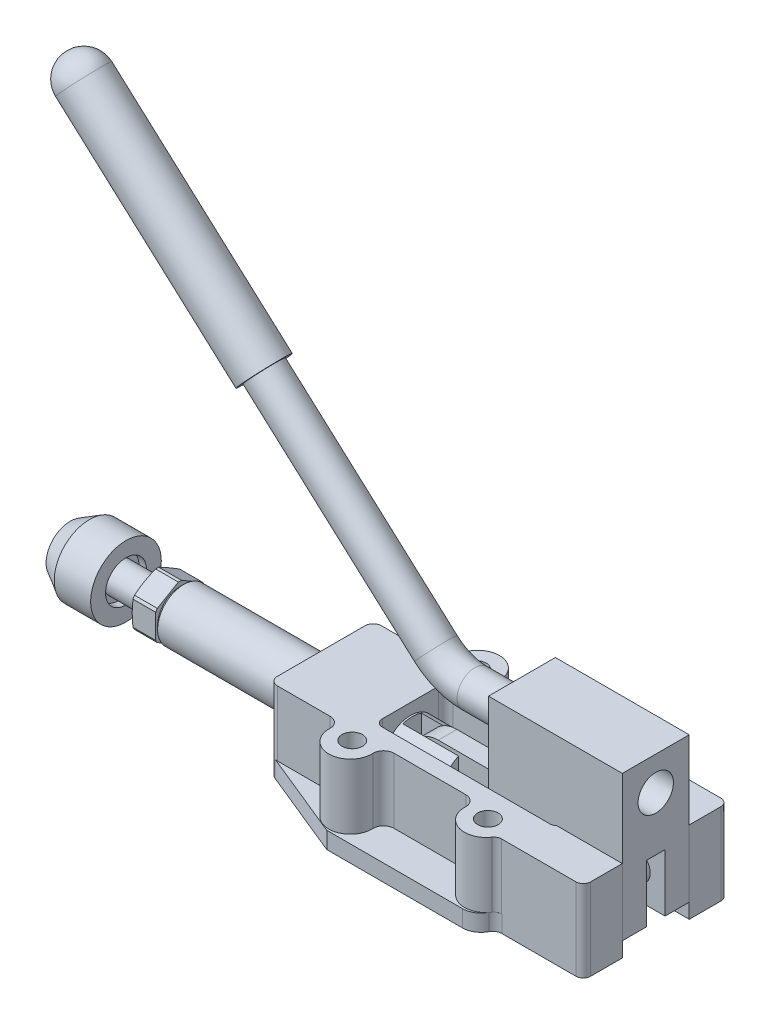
ISO-10303-21;
HEADER;
FILE_DESCRIPTION(('STEP AP214'),'2;1');
FILE_NAME('part.step','',(''),(''),'','','');
FILE_SCHEMA(('AUTOMOTIVE_DESIGN { 1 0 10303 214 1 1 1 1 }'));
ENDSEC;
DATA;
#1=APPLICATION_CONTEXT('core data for automotive mechanical design processes');
#2=APPLICATION_PROTOCOL_DEFINITION('international standard','automotive_design',2000,#1);
#3=PRODUCT_CONTEXT('',#1,'mechanical');
#4=PRODUCT('Part','Part','',(#3));
#5=PRODUCT_RELATED_PRODUCT_CATEGORY('part','',(#4));
#6=PRODUCT_DEFINITION_FORMATION('','',#4);
#7=PRODUCT_DEFINITION_CONTEXT('part definition',#1,'design');
#8=PRODUCT_DEFINITION('design','',#6,#7);
#9=PRODUCT_DEFINITION_SHAPE('','',#8);
#10=(LENGTH_UNIT() NAMED_UNIT(*) SI_UNIT(.MILLI.,.METRE.));
#11=(NAMED_UNIT(*) PLANE_ANGLE_UNIT() SI_UNIT($,.RADIAN.));
#12=(NAMED_UNIT(*) SI_UNIT($,.STERADIAN.) SOLID_ANGLE_UNIT());
#13=UNCERTAINTY_MEASURE_WITH_UNIT(LENGTH_MEASURE(1.E-05),#10,'distance_accuracy_value','');
#14=(GEOMETRIC_REPRESENTATION_CONTEXT(3) GLOBAL_UNCERTAINTY_ASSIGNED_CONTEXT((#13)) GLOBAL_UNIT_ASSIGNED_CONTEXT((#10,
#11,#12)) REPRESENTATION_CONTEXT('',''));
#15=CARTESIAN_POINT('',(0.,0.,0.));
#16=DIRECTION('',(0.,0.,1.));
#17=DIRECTION('',(1.,0.,0.));
#18=AXIS2_PLACEMENT_3D('',#15,#16,#17);
#19=CARTESIAN_POINT('',(-8.59287495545,22.,0.150000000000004));
#20=DIRECTION('',(0.,1.,0.));
#21=DIRECTION('',(0.,0.,1.));
#22=AXIS2_PLACEMENT_3D('',#19,#20,#21);
#23=CYLINDRICAL_SURFACE('',#22,2.80000000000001);
#24=DIRECTION('',(0.,1.,0.));
#25=VECTOR('',#24,1.);
#26=CARTESIAN_POINT('',(-5.79519474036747,22.,0.263953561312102));
#27=LINE('',#26,#25);
#28=CARTESIAN_POINT('',(-5.79519473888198,22.,0.263953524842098));
#29=VERTEX_POINT('',#28);
#30=CARTESIAN_POINT('',(-5.79519473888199,4.5,0.263953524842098));
#31=VERTEX_POINT('',#30);
#32=EDGE_CURVE('P0_E542',#29,#31,#27,.F.);
#33=ORIENTED_EDGE('',*,*,#32,.F.);
#34=CARTESIAN_POINT('',(-8.59287495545,22.,0.150000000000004));
#35=DIRECTION('',(0.,1.,0.));
#36=DIRECTION('',(0.,0.,1.));
#37=AXIS2_PLACEMENT_3D('',#34,#35,#36);
#38=CIRCLE('',#37,2.80000000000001);
#39=CARTESIAN_POINT('',(-8.59287495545,22.,-2.65));
#40=VERTEX_POINT('',#39);
#41=EDGE_CURVE('P0_E366',#40,#29,#38,.F.);
#42=ORIENTED_EDGE('',*,*,#41,.F.);
#43=DIRECTION('',(0.,1.,0.));
#44=VECTOR('',#43,1.);
#45=CARTESIAN_POINT('',(-8.59287495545,22.,-2.65));
#46=LINE('',#45,#44);
#47=CARTESIAN_POINT('',(-8.59287495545,4.5,-2.65));
#48=VERTEX_POINT('',#47);
#49=EDGE_CURVE('P0_E482',#40,#48,#46,.F.);
#50=ORIENTED_EDGE('',*,*,#49,.T.);
#51=CARTESIAN_POINT('',(-8.59287495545,4.5,0.150000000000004));
#52=DIRECTION('',(0.,1.,0.));
#53=DIRECTION('',(0.,0.,1.));
#54=AXIS2_PLACEMENT_3D('',#51,#52,#53);
#55=CIRCLE('',#54,2.80000000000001);
#56=EDGE_CURVE('P0_E763',#31,#48,#55,.T.);
#57=ORIENTED_EDGE('',*,*,#56,.F.);
#58=EDGE_LOOP('',(#33,#42,#50,#57));
#59=FACE_BOUND('',#58,.T.);
#60=ADVANCED_FACE('P0_F16',(#59),#23,.F.);
#61=CARTESIAN_POINT('',(0.,22.,0.5));
#62=DIRECTION('',(0.,1.,0.));
#63=DIRECTION('',(0.,0.,1.));
#64=AXIS2_PLACEMENT_3D('',#61,#62,#63);
#65=CYLINDRICAL_SURFACE('',#64,5.8);
#66=CARTESIAN_POINT('',(0.,22.,0.5));
#67=DIRECTION('',(0.,1.,0.));
#68=DIRECTION('',(0.,0.,1.));
#69=AXIS2_PLACEMENT_3D('',#66,#67,#68);
#70=CIRCLE('',#69,5.8);
#71=CARTESIAN_POINT('',(5.79519473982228,22.,0.26395354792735));
#72=VERTEX_POINT('',#71);
#73=EDGE_CURVE('P0_E717',#29,#72,#70,.T.);
#74=ORIENTED_EDGE('',*,*,#73,.F.);
#75=ORIENTED_EDGE('',*,*,#32,.T.);
#76=CARTESIAN_POINT('',(0.,4.5,0.5));
#77=DIRECTION('',(0.,1.,0.));
#78=DIRECTION('',(0.,0.,1.));
#79=AXIS2_PLACEMENT_3D('',#76,#77,#78);
#80=CIRCLE('',#79,5.8);
#81=CARTESIAN_POINT('',(5.79519473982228,4.5,0.26395354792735));
#82=VERTEX_POINT('',#81);
#83=EDGE_CURVE('P0_E767',#82,#31,#80,.F.);
#84=ORIENTED_EDGE('',*,*,#83,.F.);
#85=DIRECTION('',(0.,1.,0.));
#86=VECTOR('',#85,1.);
#87=CARTESIAN_POINT('',(5.79519474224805,22.,0.263953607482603));
#88=LINE('',#87,#86);
#89=EDGE_CURVE('P0_E538',#82,#72,#88,.T.);
#90=ORIENTED_EDGE('',*,*,#89,.T.);
#91=EDGE_LOOP('',(#74,#75,#84,#90));
#92=FACE_BOUND('',#91,.T.);
#93=ADVANCED_FACE('P0_F795',(#92),#65,.T.);
#94=CARTESIAN_POINT('',(8.59287495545,22.,0.150000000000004));
#95=DIRECTION('',(0.,1.,0.));
#96=DIRECTION('',(0.,0.,1.));
#97=AXIS2_PLACEMENT_3D('',#94,#95,#96);
#98=CYLINDRICAL_SURFACE('',#97,2.8);
#99=DIRECTION('',(0.,1.,0.));
#100=VECTOR('',#99,1.);
#101=CARTESIAN_POINT('',(8.59287495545,22.,-2.65));
#102=LINE('',#101,#100);
#103=CARTESIAN_POINT('',(8.59287495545,4.5,-2.65));
#104=VERTEX_POINT('',#103);
#105=CARTESIAN_POINT('',(8.59287495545,22.,-2.65));
#106=VERTEX_POINT('',#105);
#107=EDGE_CURVE('P0_E534',#104,#106,#102,.T.);
#108=ORIENTED_EDGE('',*,*,#107,.T.);
#109=CARTESIAN_POINT('',(8.59287495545,22.,0.150000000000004));
#110=DIRECTION('',(0.,1.,0.));
#111=DIRECTION('',(0.,0.,1.));
#112=AXIS2_PLACEMENT_3D('',#109,#110,#111);
#113=CIRCLE('',#112,2.8);
#114=EDGE_CURVE('P0_E361',#72,#106,#113,.F.);
#115=ORIENTED_EDGE('',*,*,#114,.F.);
#116=ORIENTED_EDGE('',*,*,#89,.F.);
#117=CARTESIAN_POINT('',(8.59287495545,4.5,0.150000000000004));
#118=DIRECTION('',(0.,1.,0.));
#119=DIRECTION('',(0.,0.,1.));
#120=AXIS2_PLACEMENT_3D('',#117,#118,#119);
#121=CIRCLE('',#120,2.8);
#122=EDGE_CURVE('P0_E478',#104,#82,#121,.T.);
#123=ORIENTED_EDGE('',*,*,#122,.F.);
#124=EDGE_LOOP('',(#108,#115,#116,#123));
#125=FACE_BOUND('',#124,.T.);
#126=ADVANCED_FACE('P0_F791',(#125),#98,.F.);
#127=CARTESIAN_POINT('',(8.59287495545,22.,-2.65));
#128=DIRECTION('',(0.,0.,-1.));
#129=DIRECTION('',(-1.,0.,0.));
#130=AXIS2_PLACEMENT_3D('',#127,#128,#129);
#131=PLANE('',#130);
#132=DIRECTION('',(0.,1.,0.));
#133=VECTOR('',#132,1.);
#134=CARTESIAN_POINT('',(27.90712504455,22.,-2.65000000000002));
#135=LINE('',#134,#133);
#136=CARTESIAN_POINT('',(27.90712504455,4.5,-2.65000000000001));
#137=VERTEX_POINT('',#136);
#138=CARTESIAN_POINT('',(27.90712504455,22.,-2.65000000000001));
#139=VERTEX_POINT('',#138);
#140=EDGE_CURVE('P0_E530',#137,#139,#135,.T.);
#141=ORIENTED_EDGE('',*,*,#140,.T.);
#142=DIRECTION('',(1.,0.,0.));
#143=VECTOR('',#142,1.);
#144=CARTESIAN_POINT('',(-22.8,22.,-2.65));
#145=LINE('',#144,#143);
#146=EDGE_CURVE('P0_E357',#106,#139,#145,.T.);
#147=ORIENTED_EDGE('',*,*,#146,.F.);
#148=ORIENTED_EDGE('',*,*,#107,.F.);
#149=DIRECTION('',(1.,0.,0.));
#150=VECTOR('',#149,1.);
#151=CARTESIAN_POINT('',(-22.8,4.5,-2.65));
#152=LINE('',#151,#150);
#153=EDGE_CURVE('P0_E474',#137,#104,#152,.F.);
#154=ORIENTED_EDGE('',*,*,#153,.F.);
#155=EDGE_LOOP('',(#141,#147,#148,#154));
#156=FACE_BOUND('',#155,.T.);
#157=ADVANCED_FACE('P0_F787',(#156),#131,.F.);
#158=CARTESIAN_POINT('',(27.90712504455,22.,0.150000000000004));
#159=DIRECTION('',(0.,1.,0.));
#160=DIRECTION('',(0.,0.,1.));
#161=AXIS2_PLACEMENT_3D('',#158,#159,#160);
#162=CYLINDRICAL_SURFACE('',#161,2.80000000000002);
#163=DIRECTION('',(0.,1.,0.));
#164=VECTOR('',#163,1.);
#165=CARTESIAN_POINT('',(30.7048052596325,22.,0.263953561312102));
#166=LINE('',#165,#164);
#167=CARTESIAN_POINT('',(30.704805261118,22.,0.263953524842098));
#168=VERTEX_POINT('',#167);
#169=CARTESIAN_POINT('',(30.704805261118,4.5,0.263953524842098));
#170=VERTEX_POINT('',#169);
#171=EDGE_CURVE('P0_E516',#168,#170,#166,.F.);
#172=ORIENTED_EDGE('',*,*,#171,.F.);
#173=CARTESIAN_POINT('',(27.90712504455,22.,0.150000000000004));
#174=DIRECTION('',(0.,1.,0.));
#175=DIRECTION('',(0.,0.,1.));
#176=AXIS2_PLACEMENT_3D('',#173,#174,#175);
#177=CIRCLE('',#176,2.80000000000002);
#178=EDGE_CURVE('P0_E360',#139,#168,#177,.F.);
#179=ORIENTED_EDGE('',*,*,#178,.F.);
#180=ORIENTED_EDGE('',*,*,#140,.F.);
#181=CARTESIAN_POINT('',(27.90712504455,4.5,0.150000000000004));
#182=DIRECTION('',(0.,1.,0.));
#183=DIRECTION('',(0.,0.,1.));
#184=AXIS2_PLACEMENT_3D('',#181,#182,#183);
#185=CIRCLE('',#184,2.80000000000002);
#186=EDGE_CURVE('P0_E479',#170,#137,#185,.T.);
#187=ORIENTED_EDGE('',*,*,#186,.F.);
#188=EDGE_LOOP('',(#172,#179,#180,#187));
#189=FACE_BOUND('',#188,.T.);
#190=ADVANCED_FACE('P0_F782',(#189),#162,.F.);
#191=CARTESIAN_POINT('',(36.5,22.,0.5));
#192=DIRECTION('',(0.,1.,0.));
#193=DIRECTION('',(0.,0.,1.));
#194=AXIS2_PLACEMENT_3D('',#191,#192,#193);
#195=CYLINDRICAL_SURFACE('',#194,5.8);
#196=CARTESIAN_POINT('',(36.5,22.,0.5));
#197=DIRECTION('',(0.,1.,0.));
#198=DIRECTION('',(0.,0.,1.));
#199=AXIS2_PLACEMENT_3D('',#196,#197,#198);
#200=CIRCLE('',#199,5.8);
#201=CARTESIAN_POINT('',(41.3142770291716,22.,3.73461538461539));
#202=VERTEX_POINT('',#201);
#203=EDGE_CURVE('P0_E710',#168,#202,#200,.T.);
#204=ORIENTED_EDGE('',*,*,#203,.F.);
#205=ORIENTED_EDGE('',*,*,#171,.T.);
#206=CARTESIAN_POINT('',(36.5,4.5,0.5));
#207=DIRECTION('',(0.,1.,0.));
#208=DIRECTION('',(0.,0.,1.));
#209=AXIS2_PLACEMENT_3D('',#206,#207,#208);
#210=CIRCLE('',#209,5.8);
#211=CARTESIAN_POINT('',(40.8155967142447,4.5,4.375));
#212=VERTEX_POINT('',#211);
#213=EDGE_CURVE('P0_E19',#212,#170,#210,.F.);
#214=ORIENTED_EDGE('',*,*,#213,.F.);
#215=CARTESIAN_POINT('',(36.5,4.5,0.5));
#216=DIRECTION('',(0.,1.,0.));
#217=DIRECTION('',(0.,0.,1.));
#218=AXIS2_PLACEMENT_3D('',#215,#216,#217);
#219=CIRCLE('',#218,5.8);
#220=CARTESIAN_POINT('',(41.3142770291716,4.5,3.73461538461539));
#221=VERTEX_POINT('',#220);
#222=EDGE_CURVE('P0_E293',#212,#221,#219,.T.);
#223=ORIENTED_EDGE('',*,*,#222,.T.);
#224=DIRECTION('',(0.,1.,0.));
#225=VECTOR('',#224,1.);
#226=CARTESIAN_POINT('',(41.3142770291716,22.,3.73461538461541));
#227=LINE('',#226,#225);
#228=EDGE_CURVE('P0_E522',#221,#202,#227,.T.);
#229=ORIENTED_EDGE('',*,*,#228,.T.);
#230=EDGE_LOOP('',(#204,#205,#214,#223,#229));
#231=FACE_BOUND('',#230,.T.);
#232=ADVANCED_FACE('P0_F924',(#231),#195,.T.);
#233=CARTESIAN_POINT('',(36.5,22.,-33.8));
#234=DIRECTION('',(0.,1.,0.));
#235=DIRECTION('',(0.,0.,1.));
#236=AXIS2_PLACEMENT_3D('',#233,#234,#235);
#237=CYLINDRICAL_SURFACE('',#236,5.8);
#238=CARTESIAN_POINT('',(36.5,22.,-33.8));
#239=DIRECTION('',(0.,1.,0.));
#240=DIRECTION('',(0.,0.,1.));
#241=AXIS2_PLACEMENT_3D('',#238,#239,#240);
#242=CIRCLE('',#241,5.8);
#243=CARTESIAN_POINT('',(41.3142770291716,22.,-37.0346153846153));
#244=VERTEX_POINT('',#243);
#245=CARTESIAN_POINT('',(30.7048052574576,22.,-33.5639536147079));
#246=VERTEX_POINT('',#245);
#247=EDGE_CURVE('P0_E694',#244,#246,#242,.T.);
#248=ORIENTED_EDGE('',*,*,#247,.F.);
#249=DIRECTION('',(0.,1.,0.));
#250=VECTOR('',#249,1.);
#251=CARTESIAN_POINT('',(41.3142770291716,22.,-37.0346153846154));
#252=LINE('',#251,#250);
#253=CARTESIAN_POINT('',(41.3142770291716,4.5,-37.0346153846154));
#254=VERTEX_POINT('',#253);
#255=EDGE_CURVE('P0_E517',#244,#254,#252,.F.);
#256=ORIENTED_EDGE('',*,*,#255,.T.);
#257=CARTESIAN_POINT('',(36.5,4.5,-33.8));
#258=DIRECTION('',(0.,1.,0.));
#259=DIRECTION('',(0.,0.,1.));
#260=AXIS2_PLACEMENT_3D('',#257,#258,#259);
#261=CIRCLE('',#260,5.8);
#262=CARTESIAN_POINT('',(40.8155967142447,4.5,-37.675));
#263=VERTEX_POINT('',#262);
#264=EDGE_CURVE('P0_E741',#254,#263,#261,.T.);
#265=ORIENTED_EDGE('',*,*,#264,.T.);
#266=CARTESIAN_POINT('',(36.5,4.5,-33.8));
#267=DIRECTION('',(0.,1.,0.));
#268=DIRECTION('',(0.,0.,1.));
#269=AXIS2_PLACEMENT_3D('',#266,#267,#268);
#270=CIRCLE('',#269,5.8);
#271=CARTESIAN_POINT('',(30.7048052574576,4.5,-33.5639536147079));
#272=VERTEX_POINT('',#271);
#273=EDGE_CURVE('P0_E367',#272,#263,#270,.F.);
#274=ORIENTED_EDGE('',*,*,#273,.F.);
#275=DIRECTION('',(0.,1.,0.));
#276=VECTOR('',#275,1.);
#277=CARTESIAN_POINT('',(30.7048052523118,22.,-33.5639537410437));
#278=LINE('',#277,#276);
#279=EDGE_CURVE('P0_E512',#272,#246,#278,.T.);
#280=ORIENTED_EDGE('',*,*,#279,.T.);
#281=EDGE_LOOP('',(#248,#256,#265,#274,#280));
#282=FACE_BOUND('',#281,.T.);
#283=ADVANCED_FACE('P0_F926',(#282),#237,.T.);
#284=CARTESIAN_POINT('',(27.90712504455,22.,-33.45));
#285=DIRECTION('',(0.,1.,0.));
#286=DIRECTION('',(0.,0.,1.));
#287=AXIS2_PLACEMENT_3D('',#284,#285,#286);
#288=CYLINDRICAL_SURFACE('',#287,2.79999999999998);
#289=DIRECTION('',(0.,1.,0.));
#290=VECTOR('',#289,1.);
#291=CARTESIAN_POINT('',(27.90712504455,22.,-30.65));
#292=LINE('',#291,#290);
#293=CARTESIAN_POINT('',(27.90712504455,4.5,-30.65));
#294=VERTEX_POINT('',#293);
#295=CARTESIAN_POINT('',(27.90712504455,22.,-30.65));
#296=VERTEX_POINT('',#295);
#297=EDGE_CURVE('P0_E508',#294,#296,#292,.T.);
#298=ORIENTED_EDGE('',*,*,#297,.T.);
#299=CARTESIAN_POINT('',(27.90712504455,22.,-33.45));
#300=DIRECTION('',(0.,1.,0.));
#301=DIRECTION('',(0.,0.,1.));
#302=AXIS2_PLACEMENT_3D('',#299,#300,#301);
#303=CIRCLE('',#302,2.79999999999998);
#304=EDGE_CURVE('P0_E356',#246,#296,#303,.F.);
#305=ORIENTED_EDGE('',*,*,#304,.F.);
#306=ORIENTED_EDGE('',*,*,#279,.F.);
#307=CARTESIAN_POINT('',(27.90712504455,4.5,-33.45));
#308=DIRECTION('',(0.,1.,0.));
#309=DIRECTION('',(0.,0.,1.));
#310=AXIS2_PLACEMENT_3D('',#307,#308,#309);
#311=CIRCLE('',#310,2.79999999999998);
#312=EDGE_CURVE('P0_E388',#294,#272,#311,.T.);
#313=ORIENTED_EDGE('',*,*,#312,.F.);
#314=EDGE_LOOP('',(#298,#305,#306,#313));
#315=FACE_BOUND('',#314,.T.);
#316=ADVANCED_FACE('P0_F932',(#315),#288,.F.);
#317=CARTESIAN_POINT('',(27.90712504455,22.,-30.65));
#318=DIRECTION('',(0.,0.,1.));
#319=DIRECTION('',(1.,0.,0.));
#320=AXIS2_PLACEMENT_3D('',#317,#318,#319);
#321=PLANE('',#320);
#322=DIRECTION('',(0.,1.,0.));
#323=VECTOR('',#322,1.);
#324=CARTESIAN_POINT('',(8.59287495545,22.,-30.65));
#325=LINE('',#324,#323);
#326=CARTESIAN_POINT('',(8.59287495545,4.5,-30.65));
#327=VERTEX_POINT('',#326);
#328=CARTESIAN_POINT('',(8.59287495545,22.,-30.65));
#329=VERTEX_POINT('',#328);
#330=EDGE_CURVE('P0_E504',#327,#329,#325,.T.);
#331=ORIENTED_EDGE('',*,*,#330,.T.);
#332=DIRECTION('',(1.,0.,0.));
#333=VECTOR('',#332,1.);
#334=CARTESIAN_POINT('',(-22.8,22.,-30.65));
#335=LINE('',#334,#333);
#336=EDGE_CURVE('P0_E352',#296,#329,#335,.F.);
#337=ORIENTED_EDGE('',*,*,#336,.F.);
#338=ORIENTED_EDGE('',*,*,#297,.F.);
#339=DIRECTION('',(1.,0.,0.));
#340=VECTOR('',#339,1.);
#341=CARTESIAN_POINT('',(-22.8,4.5,-30.65));
#342=LINE('',#341,#340);
#343=EDGE_CURVE('P0_E384',#327,#294,#342,.T.);
#344=ORIENTED_EDGE('',*,*,#343,.F.);
#345=EDGE_LOOP('',(#331,#337,#338,#344));
#346=FACE_BOUND('',#345,.T.);
#347=ADVANCED_FACE('P0_F1098',(#346),#321,.F.);
#348=CARTESIAN_POINT('',(8.59287495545,22.,-33.45));
#349=DIRECTION('',(0.,1.,0.));
#350=DIRECTION('',(0.,0.,1.));
#351=AXIS2_PLACEMENT_3D('',#348,#349,#350);
#352=CYLINDRICAL_SURFACE('',#351,2.80000000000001);
#353=DIRECTION('',(0.,1.,0.));
#354=VECTOR('',#353,1.);
#355=CARTESIAN_POINT('',(5.79519474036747,22.,-33.5639535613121));
#356=LINE('',#355,#354);
#357=CARTESIAN_POINT('',(5.79519473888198,22.,-33.5639535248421));
#358=VERTEX_POINT('',#357);
#359=CARTESIAN_POINT('',(5.79519473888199,4.5,-33.5639535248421));
#360=VERTEX_POINT('',#359);
#361=EDGE_CURVE('P0_E501',#358,#360,#356,.F.);
#362=ORIENTED_EDGE('',*,*,#361,.F.);
#363=CARTESIAN_POINT('',(8.59287495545,22.,-33.45));
#364=DIRECTION('',(0.,1.,0.));
#365=DIRECTION('',(0.,0.,1.));
#366=AXIS2_PLACEMENT_3D('',#363,#364,#365);
#367=CIRCLE('',#366,2.80000000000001);
#368=EDGE_CURVE('P0_E355',#329,#358,#367,.F.);
#369=ORIENTED_EDGE('',*,*,#368,.F.);
#370=ORIENTED_EDGE('',*,*,#330,.F.);
#371=CARTESIAN_POINT('',(8.59287495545,4.5,-33.45));
#372=DIRECTION('',(0.,1.,0.));
#373=DIRECTION('',(0.,0.,1.));
#374=AXIS2_PLACEMENT_3D('',#371,#372,#373);
#375=CIRCLE('',#374,2.80000000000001);
#376=EDGE_CURVE('P0_E389',#360,#327,#375,.T.);
#377=ORIENTED_EDGE('',*,*,#376,.F.);
#378=EDGE_LOOP('',(#362,#369,#370,#377));
#379=FACE_BOUND('',#378,.T.);
#380=ADVANCED_FACE('P0_F1094',(#379),#352,.F.);
#381=CARTESIAN_POINT('',(0.,22.,-33.8));
#382=DIRECTION('',(0.,1.,0.));
#383=DIRECTION('',(0.,0.,1.));
#384=AXIS2_PLACEMENT_3D('',#381,#382,#383);
#385=CYLINDRICAL_SURFACE('',#384,5.8);
#386=CARTESIAN_POINT('',(0.,22.,-33.8));
#387=DIRECTION('',(0.,1.,0.));
#388=DIRECTION('',(0.,0.,1.));
#389=AXIS2_PLACEMENT_3D('',#386,#387,#388);
#390=CIRCLE('',#389,5.8);
#391=CARTESIAN_POINT('',(-5.79519473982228,22.,-33.5639535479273));
#392=VERTEX_POINT('',#391);
#393=EDGE_CURVE('P0_E687',#358,#392,#390,.T.);
#394=ORIENTED_EDGE('',*,*,#393,.F.);
#395=ORIENTED_EDGE('',*,*,#361,.T.);
#396=CARTESIAN_POINT('',(0.,4.5,-33.8));
#397=DIRECTION('',(0.,1.,0.));
#398=DIRECTION('',(0.,0.,1.));
#399=AXIS2_PLACEMENT_3D('',#396,#397,#398);
#400=CIRCLE('',#399,5.8);
#401=CARTESIAN_POINT('',(-5.79519473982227,4.5,-33.5639535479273));
#402=VERTEX_POINT('',#401);
#403=EDGE_CURVE('P0_E730',#402,#360,#400,.F.);
#404=ORIENTED_EDGE('',*,*,#403,.F.);
#405=DIRECTION('',(0.,1.,0.));
#406=VECTOR('',#405,1.);
#407=CARTESIAN_POINT('',(-5.79519474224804,22.,-33.5639536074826));
#408=LINE('',#407,#406);
#409=EDGE_CURVE('P0_E497',#402,#392,#408,.T.);
#410=ORIENTED_EDGE('',*,*,#409,.T.);
#411=EDGE_LOOP('',(#394,#395,#404,#410));
#412=FACE_BOUND('',#411,.T.);
#413=ADVANCED_FACE('P0_F1090',(#412),#385,.T.);
#414=CARTESIAN_POINT('',(-8.59287495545,22.,-33.45));
#415=DIRECTION('',(0.,1.,0.));
#416=DIRECTION('',(0.,0.,1.));
#417=AXIS2_PLACEMENT_3D('',#414,#415,#416);
#418=CYLINDRICAL_SURFACE('',#417,2.80000000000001);
#419=DIRECTION('',(0.,1.,0.));
#420=VECTOR('',#419,1.);
#421=CARTESIAN_POINT('',(-8.59287495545,22.,-30.65));
#422=LINE('',#421,#420);
#423=CARTESIAN_POINT('',(-8.59287495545,4.5,-30.65));
#424=VERTEX_POINT('',#423);
#425=CARTESIAN_POINT('',(-8.59287495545,22.,-30.65));
#426=VERTEX_POINT('',#425);
#427=EDGE_CURVE('P0_E373',#424,#426,#422,.T.);
#428=ORIENTED_EDGE('',*,*,#427,.T.);
#429=CARTESIAN_POINT('',(-8.59287495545,22.,-33.45));
#430=DIRECTION('',(0.,1.,0.));
#431=DIRECTION('',(0.,0.,1.));
#432=AXIS2_PLACEMENT_3D('',#429,#430,#431);
#433=CIRCLE('',#432,2.80000000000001);
#434=EDGE_CURVE('P0_E496',#392,#426,#433,.F.);
#435=ORIENTED_EDGE('',*,*,#434,.F.);
#436=ORIENTED_EDGE('',*,*,#409,.F.);
#437=CARTESIAN_POINT('',(-8.59287495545,4.5,-33.45));
#438=DIRECTION('',(0.,1.,0.));
#439=DIRECTION('',(0.,0.,1.));
#440=AXIS2_PLACEMENT_3D('',#437,#438,#439);
#441=CIRCLE('',#440,2.80000000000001);
#442=EDGE_CURVE('P0_E734',#424,#402,#441,.T.);
#443=ORIENTED_EDGE('',*,*,#442,.F.);
#444=EDGE_LOOP('',(#428,#435,#436,#443));
#445=FACE_BOUND('',#444,.T.);
#446=ADVANCED_FACE('P0_F1087',(#445),#418,.F.);
#447=CARTESIAN_POINT('',(-22.8,22.,-2.65));
#448=DIRECTION('',(0.,0.,-1.));
#449=DIRECTION('',(-1.,0.,0.));
#450=AXIS2_PLACEMENT_3D('',#447,#448,#449);
#451=PLANE('',#450);
#452=ORIENTED_EDGE('',*,*,#49,.F.);
#453=DIRECTION('',(1.,0.,0.));
#454=VECTOR('',#453,1.);
#455=CARTESIAN_POINT('',(-22.8,22.,-2.65));
#456=LINE('',#455,#454);
#457=CARTESIAN_POINT('',(-22.8,22.,-2.65));
#458=VERTEX_POINT('',#457);
#459=EDGE_CURVE('P0_E362',#458,#40,#456,.T.);
#460=ORIENTED_EDGE('',*,*,#459,.F.);
#461=DIRECTION('',(0.,1.,0.));
#462=VECTOR('',#461,1.);
#463=CARTESIAN_POINT('',(-22.8,4.5,-2.65));
#464=LINE('',#463,#462);
#465=CARTESIAN_POINT('',(-22.8,4.5,-2.65));
#466=VERTEX_POINT('',#465);
#467=EDGE_CURVE('P0_E486',#466,#458,#464,.T.);
#468=ORIENTED_EDGE('',*,*,#467,.F.);
#469=DIRECTION('',(1.,0.,0.));
#470=VECTOR('',#469,1.);
#471=CARTESIAN_POINT('',(-22.8,4.5,-2.65));
#472=LINE('',#471,#470);
#473=EDGE_CURVE('P0_E480',#48,#466,#472,.F.);
#474=ORIENTED_EDGE('',*,*,#473,.F.);
#475=EDGE_LOOP('',(#452,#460,#468,#474));
#476=FACE_BOUND('',#475,.T.);
#477=ADVANCED_FACE('P0_F803',(#476),#451,.F.);
#478=CARTESIAN_POINT('',(-22.8,4.5,-28.45));
#479=DIRECTION('',(0.,1.,0.));
#480=DIRECTION('',(0.,0.,1.));
#481=AXIS2_PLACEMENT_3D('',#478,#479,#480);
#482=PLANE('',#481);
#483=ORIENTED_EDGE('',*,*,#83,.T.);
#484=ORIENTED_EDGE('',*,*,#56,.T.);
#485=ORIENTED_EDGE('',*,*,#473,.T.);
#486=CARTESIAN_POINT('',(-22.8,4.5,-4.85));
#487=DIRECTION('',(0.,1.,0.));
#488=DIRECTION('',(0.,0.,1.));
#489=AXIS2_PLACEMENT_3D('',#486,#487,#488);
#490=CIRCLE('',#489,2.2);
#491=CARTESIAN_POINT('',(-23.6326788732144,4.5,-2.8136685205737));
#492=VERTEX_POINT('',#491);
#493=EDGE_CURVE('P0_E307',#492,#466,#490,.T.);
#494=ORIENTED_EDGE('',*,*,#493,.F.);
#495=DIRECTION('',(-0.92560521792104,0.,-0.378490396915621));
#496=VECTOR('',#495,1.);
#497=CARTESIAN_POINT('',(-23.6326788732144,4.5,-2.8136685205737));
#498=LINE('',#497,#496);
#499=CARTESIAN_POINT('',(0.,4.5,6.85));
#500=VERTEX_POINT('',#499);
#501=EDGE_CURVE('P0_E299',#492,#500,#498,.F.);
#502=ORIENTED_EDGE('',*,*,#501,.T.);
#503=DIRECTION('',(-1.,0.,0.));
#504=VECTOR('',#503,1.);
#505=CARTESIAN_POINT('',(0.,4.5,6.85));
#506=LINE('',#505,#504);
#507=CARTESIAN_POINT('',(36.5,4.5,6.85000000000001));
#508=VERTEX_POINT('',#507);
#509=EDGE_CURVE('P0_E304',#500,#508,#506,.F.);
#510=ORIENTED_EDGE('',*,*,#509,.T.);
#511=CARTESIAN_POINT('',(36.5,4.5,1.85));
#512=DIRECTION('',(0.,1.,0.));
#513=DIRECTION('',(0.,0.,1.));
#514=AXIS2_PLACEMENT_3D('',#511,#512,#513);
#515=CIRCLE('',#514,5.00000000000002);
#516=EDGE_CURVE('P0_E658',#212,#508,#515,.F.);
#517=ORIENTED_EDGE('',*,*,#516,.F.);
#518=ORIENTED_EDGE('',*,*,#213,.T.);
#519=ORIENTED_EDGE('',*,*,#186,.T.);
#520=ORIENTED_EDGE('',*,*,#153,.T.);
#521=ORIENTED_EDGE('',*,*,#122,.T.);
#522=EDGE_LOOP('',(#483,#484,#485,#494,#502,#510,#517,#518,#519,#520,#521));
#523=FACE_BOUND('',#522,.T.);
#524=ADVANCED_FACE('P0_F302',(#523),#482,.T.);
#525=CARTESIAN_POINT('',(-22.8,4.5,-28.45));
#526=DIRECTION('',(0.,1.,0.));
#527=DIRECTION('',(0.,0.,1.));
#528=AXIS2_PLACEMENT_3D('',#525,#526,#527);
#529=PLANE('',#528);
#530=CARTESIAN_POINT('',(36.5,4.5,1.85));
#531=DIRECTION('',(0.,1.,0.));
#532=DIRECTION('',(0.,0.,1.));
#533=AXIS2_PLACEMENT_3D('',#530,#531,#532);
#534=CIRCLE('',#533,5.00000000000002);
#535=CARTESIAN_POINT('',(40.9221664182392,4.5,4.18333327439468));
#536=VERTEX_POINT('',#535);
#537=EDGE_CURVE('P0_E322',#536,#212,#534,.F.);
#538=ORIENTED_EDGE('',*,*,#537,.F.);
#539=CARTESIAN_POINT('',(43.1332495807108,4.5,5.35));
#540=DIRECTION('',(0.,1.,0.));
#541=DIRECTION('',(0.,0.,1.));
#542=AXIS2_PLACEMENT_3D('',#539,#540,#541);
#543=CIRCLE('',#542,2.49999999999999);
#544=CARTESIAN_POINT('',(41.7594789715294,4.5,3.26127926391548));
#545=VERTEX_POINT('',#544);
#546=EDGE_CURVE('P0_E653',#536,#545,#543,.F.);
#547=ORIENTED_EDGE('',*,*,#546,.T.);
#548=CARTESIAN_POINT('',(42.9743725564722,4.5,4.85));
#549=DIRECTION('',(0.,1.,0.));
#550=DIRECTION('',(0.,0.,1.));
#551=AXIS2_PLACEMENT_3D('',#548,#549,#550);
#552=CIRCLE('',#551,2.);
#553=EDGE_CURVE('P0_E470',#545,#221,#552,.T.);
#554=ORIENTED_EDGE('',*,*,#553,.T.);
#555=ORIENTED_EDGE('',*,*,#222,.F.);
#556=EDGE_LOOP('',(#538,#547,#554,#555));
#557=FACE_BOUND('',#556,.T.);
#558=ADVANCED_FACE('P0_F910',(#557),#529,.F.);
#559=CARTESIAN_POINT('',(-22.8,4.5,-28.45));
#560=DIRECTION('',(0.,1.,0.));
#561=DIRECTION('',(0.,0.,1.));
#562=AXIS2_PLACEMENT_3D('',#559,#560,#561);
#563=PLANE('',#562);
#564=CARTESIAN_POINT('',(43.1332495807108,4.5,5.35));
#565=DIRECTION('',(0.,1.,0.));
#566=DIRECTION('',(0.,0.,1.));
#567=AXIS2_PLACEMENT_3D('',#564,#565,#566);
#568=CIRCLE('',#567,2.49999999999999);
#569=CARTESIAN_POINT('',(43.1332495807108,4.5,2.85));
#570=VERTEX_POINT('',#569);
#571=EDGE_CURVE('P0_E649',#545,#570,#568,.F.);
#572=ORIENTED_EDGE('',*,*,#571,.T.);
#573=DIRECTION('',(1.,0.,0.));
#574=VECTOR('',#573,1.);
#575=CARTESIAN_POINT('',(-22.8,4.5,2.85));
#576=LINE('',#575,#574);
#577=CARTESIAN_POINT('',(42.9743725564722,4.5,2.85));
#578=VERTEX_POINT('',#577);
#579=EDGE_CURVE('P0_E468',#570,#578,#576,.F.);
#580=ORIENTED_EDGE('',*,*,#579,.T.);
#581=CARTESIAN_POINT('',(42.9743725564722,4.5,4.85));
#582=DIRECTION('',(0.,1.,0.));
#583=DIRECTION('',(0.,0.,1.));
#584=AXIS2_PLACEMENT_3D('',#581,#582,#583);
#585=CIRCLE('',#584,2.);
#586=EDGE_CURVE('P0_E526',#578,#545,#585,.T.);
#587=ORIENTED_EDGE('',*,*,#586,.T.);
#588=EDGE_LOOP('',(#572,#580,#587));
#589=FACE_BOUND('',#588,.T.);
#590=ADVANCED_FACE('P0_F913',(#589),#563,.T.);
#591=CARTESIAN_POINT('',(42.9743725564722,22.,4.85));
#592=DIRECTION('',(0.,1.,0.));
#593=DIRECTION('',(0.,0.,1.));
#594=AXIS2_PLACEMENT_3D('',#591,#592,#593);
#595=CYLINDRICAL_SURFACE('',#594,2.);
#596=DIRECTION('',(0.,1.,0.));
#597=VECTOR('',#596,1.);
#598=CARTESIAN_POINT('',(42.9743725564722,4.5,2.85));
#599=LINE('',#598,#597);
#600=CARTESIAN_POINT('',(42.9743725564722,22.,2.85));
#601=VERTEX_POINT('',#600);
#602=EDGE_CURVE('P0_E463',#578,#601,#599,.T.);
#603=ORIENTED_EDGE('',*,*,#602,.T.);
#604=CARTESIAN_POINT('',(42.9743725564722,22.,4.85));
#605=DIRECTION('',(0.,1.,0.));
#606=DIRECTION('',(0.,0.,1.));
#607=AXIS2_PLACEMENT_3D('',#604,#605,#606);
#608=CIRCLE('',#607,2.);
#609=EDGE_CURVE('P0_E707',#202,#601,#608,.F.);
#610=ORIENTED_EDGE('',*,*,#609,.F.);
#611=ORIENTED_EDGE('',*,*,#228,.F.);
#612=ORIENTED_EDGE('',*,*,#553,.F.);
#613=ORIENTED_EDGE('',*,*,#586,.F.);
#614=EDGE_LOOP('',(#603,#610,#611,#612,#613));
#615=FACE_BOUND('',#614,.T.);
#616=ADVANCED_FACE('P0_F916',(#615),#595,.F.);
#617=CARTESIAN_POINT('',(46.,4.5,-9.15000000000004));
#618=DIRECTION('',(0.,1.,0.));
#619=DIRECTION('',(0.,0.,1.));
#620=AXIS2_PLACEMENT_3D('',#617,#618,#619);
#621=CYLINDRICAL_SURFACE('',#620,2.00000000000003);
#622=DIRECTION('',(0.,1.,0.));
#623=VECTOR('',#622,1.);
#624=CARTESIAN_POINT('',(46.,4.5,-7.15));
#625=LINE('',#624,#623);
#626=CARTESIAN_POINT('',(46.,0.,-7.15));
#627=VERTEX_POINT('',#626);
#628=CARTESIAN_POINT('',(46.,22.,-7.15));
#629=VERTEX_POINT('',#628);
#630=EDGE_CURVE('P0_E441',#627,#629,#625,.T.);
#631=ORIENTED_EDGE('',*,*,#630,.T.);
#632=CARTESIAN_POINT('',(46.,22.,-9.15000000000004));
#633=DIRECTION('',(0.,1.,0.));
#634=DIRECTION('',(0.,0.,1.));
#635=AXIS2_PLACEMENT_3D('',#632,#633,#634);
#636=CIRCLE('',#635,2.00000000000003);
#637=CARTESIAN_POINT('',(47.3228756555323,22.,-7.65));
#638=VERTEX_POINT('',#637);
#639=EDGE_CURVE('P0_E704',#638,#629,#636,.F.);
#640=ORIENTED_EDGE('',*,*,#639,.F.);
#641=DIRECTION('',(0.,1.,0.));
#642=VECTOR('',#641,1.);
#643=CARTESIAN_POINT('',(47.3228756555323,4.5,-7.65));
#644=LINE('',#643,#642);
#645=CARTESIAN_POINT('',(47.3228756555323,0.,-7.65));
#646=VERTEX_POINT('',#645);
#647=EDGE_CURVE('P0_E446',#638,#646,#644,.F.);
#648=ORIENTED_EDGE('',*,*,#647,.T.);
#649=CARTESIAN_POINT('',(46.,0.,-9.15000000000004));
#650=DIRECTION('',(0.,1.,0.));
#651=DIRECTION('',(0.,0.,1.));
#652=AXIS2_PLACEMENT_3D('',#649,#650,#651);
#653=CIRCLE('',#652,2.00000000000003);
#654=EDGE_CURVE('P0_E753',#627,#646,#653,.T.);
#655=ORIENTED_EDGE('',*,*,#654,.F.);
#656=EDGE_LOOP('',(#631,#640,#648,#655));
#657=FACE_BOUND('',#656,.T.);
#658=ADVANCED_FACE('P0_F1072',(#657),#621,.F.);
#659=CARTESIAN_POINT('',(-1.,12.,-16.65));
#660=DIRECTION('',(-1.,0.,0.));
#661=DIRECTION('',(0.,0.,1.));
#662=AXIS2_PLACEMENT_3D('',#659,#660,#661);
#663=CYLINDRICAL_SURFACE('',#662,7.);
#664=CARTESIAN_POINT('',(-25.,12.,-16.65));
#665=DIRECTION('',(-1.,0.,0.));
#666=DIRECTION('',(0.,0.,1.));
#667=AXIS2_PLACEMENT_3D('',#664,#665,#666);
#668=CIRCLE('',#667,7.);
#669=CARTESIAN_POINT('',(-25.,12.,-9.65));
#670=VERTEX_POINT('',#669);
#671=EDGE_CURVE('P0_E383',#670,#670,#668,.T.);
#672=ORIENTED_EDGE('',*,*,#671,.T.);
#673=EDGE_LOOP('',(#672));
#674=FACE_BOUND('',#673,.T.);
#675=CARTESIAN_POINT('',(-1.,12.,-16.65));
#676=DIRECTION('',(-1.,0.,0.));
#677=DIRECTION('',(0.,0.,1.));
#678=AXIS2_PLACEMENT_3D('',#675,#676,#677);
#679=CIRCLE('',#678,7.);
#680=CARTESIAN_POINT('',(-1.,12.,-9.65));
#681=VERTEX_POINT('',#680);
#682=EDGE_CURVE('P0_E636',#681,#681,#679,.F.);
#683=ORIENTED_EDGE('',*,*,#682,.T.);
#684=EDGE_LOOP('',(#683));
#685=FACE_BOUND('',#684,.T.);
#686=ADVANCED_FACE('P0_F1068',(#674,#685),#663,.F.);
#687=CARTESIAN_POINT('',(57.,12.,2.85));
#688=DIRECTION('',(0.,0.,1.));
#689=DIRECTION('',(1.,0.,0.));
#690=AXIS2_PLACEMENT_3D('',#687,#688,#689);
#691=CYLINDRICAL_SURFACE('',#690,4.);
#692=CARTESIAN_POINT('',(57.,12.,-7.65));
#693=DIRECTION('',(0.,0.,1.));
#694=DIRECTION('',(1.,0.,0.));
#695=AXIS2_PLACEMENT_3D('',#692,#693,#694);
#696=CIRCLE('',#695,4.);
#697=CARTESIAN_POINT('',(61.,12.,-7.65));
#698=VERTEX_POINT('',#697);
#699=EDGE_CURVE('P0_E454',#698,#698,#696,.F.);
#700=ORIENTED_EDGE('',*,*,#699,.T.);
#701=EDGE_LOOP('',(#700));
#702=FACE_BOUND('',#701,.T.);
#703=CARTESIAN_POINT('',(57.,12.,-25.65));
#704=DIRECTION('',(0.,0.,1.));
#705=DIRECTION('',(1.,0.,0.));
#706=AXIS2_PLACEMENT_3D('',#703,#704,#705);
#707=CIRCLE('',#706,4.);
#708=CARTESIAN_POINT('',(61.,12.,-25.65));
#709=VERTEX_POINT('',#708);
#710=EDGE_CURVE('P0_E629',#709,#709,#707,.T.);
#711=ORIENTED_EDGE('',*,*,#710,.T.);
#712=EDGE_LOOP('',(#711));
#713=FACE_BOUND('',#712,.T.);
#714=ADVANCED_FACE('P0_F1064',(#702,#713),#691,.T.);
#715=CARTESIAN_POINT('',(46.,4.5,-24.15));
#716=DIRECTION('',(0.,1.,0.));
#717=DIRECTION('',(0.,0.,1.));
#718=AXIS2_PLACEMENT_3D('',#715,#716,#717);
#719=CYLINDRICAL_SURFACE('',#718,2.00000000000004);
#720=DIRECTION('',(0.,1.,0.));
#721=VECTOR('',#720,1.);
#722=CARTESIAN_POINT('',(47.3228756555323,4.5,-25.65));
#723=LINE('',#722,#721);
#724=CARTESIAN_POINT('',(47.3228756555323,0.,-25.65));
#725=VERTEX_POINT('',#724);
#726=CARTESIAN_POINT('',(47.3228756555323,22.,-25.65));
#727=VERTEX_POINT('',#726);
#728=EDGE_CURVE('P0_E423',#725,#727,#723,.T.);
#729=ORIENTED_EDGE('',*,*,#728,.T.);
#730=CARTESIAN_POINT('',(46.,22.,-24.15));
#731=DIRECTION('',(0.,1.,0.));
#732=DIRECTION('',(0.,0.,1.));
#733=AXIS2_PLACEMENT_3D('',#730,#731,#732);
#734=CIRCLE('',#733,2.00000000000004);
#735=CARTESIAN_POINT('',(46.,22.,-26.15));
#736=VERTEX_POINT('',#735);
#737=EDGE_CURVE('P0_E701',#736,#727,#734,.F.);
#738=ORIENTED_EDGE('',*,*,#737,.F.);
#739=DIRECTION('',(0.,1.,0.));
#740=VECTOR('',#739,1.);
#741=CARTESIAN_POINT('',(46.,4.5,-26.15));
#742=LINE('',#741,#740);
#743=CARTESIAN_POINT('',(46.,0.,-26.15));
#744=VERTEX_POINT('',#743);
#745=EDGE_CURVE('P0_E430',#736,#744,#742,.F.);
#746=ORIENTED_EDGE('',*,*,#745,.T.);
#747=CARTESIAN_POINT('',(46.,0.,-24.15));
#748=DIRECTION('',(0.,1.,0.));
#749=DIRECTION('',(0.,0.,1.));
#750=AXIS2_PLACEMENT_3D('',#747,#748,#749);
#751=CIRCLE('',#750,2.00000000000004);
#752=EDGE_CURVE('P0_E521',#725,#744,#751,.T.);
#753=ORIENTED_EDGE('',*,*,#752,.F.);
#754=EDGE_LOOP('',(#729,#738,#746,#753));
#755=FACE_BOUND('',#754,.T.);
#756=ADVANCED_FACE('P0_F1060',(#755),#719,.F.);
#757=CARTESIAN_POINT('',(42.9743725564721,22.,-38.1499999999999));
#758=DIRECTION('',(0.,1.,0.));
#759=DIRECTION('',(0.,0.,1.));
#760=AXIS2_PLACEMENT_3D('',#757,#758,#759);
#761=CYLINDRICAL_SURFACE('',#760,1.99999999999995);
#762=ORIENTED_EDGE('',*,*,#255,.F.);
#763=CARTESIAN_POINT('',(42.9743725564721,22.,-38.1499999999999));
#764=DIRECTION('',(0.,1.,0.));
#765=DIRECTION('',(0.,0.,1.));
#766=AXIS2_PLACEMENT_3D('',#763,#764,#765);
#767=CIRCLE('',#766,1.99999999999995);
#768=CARTESIAN_POINT('',(42.9743725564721,22.,-36.15));
#769=VERTEX_POINT('',#768);
#770=EDGE_CURVE('P0_E697',#769,#244,#767,.F.);
#771=ORIENTED_EDGE('',*,*,#770,.F.);
#772=DIRECTION('',(0.,1.,0.));
#773=VECTOR('',#772,1.);
#774=CARTESIAN_POINT('',(42.9743725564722,4.5,-36.15));
#775=LINE('',#774,#773);
#776=CARTESIAN_POINT('',(42.9743725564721,4.5,-36.15));
#777=VERTEX_POINT('',#776);
#778=EDGE_CURVE('P0_E402',#769,#777,#775,.F.);
#779=ORIENTED_EDGE('',*,*,#778,.T.);
#780=CARTESIAN_POINT('',(42.9743725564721,4.5,-38.1499999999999));
#781=DIRECTION('',(0.,1.,0.));
#782=DIRECTION('',(0.,0.,1.));
#783=AXIS2_PLACEMENT_3D('',#780,#781,#782);
#784=CIRCLE('',#783,1.99999999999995);
#785=CARTESIAN_POINT('',(41.7594789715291,4.5,-36.5612792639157));
#786=VERTEX_POINT('',#785);
#787=EDGE_CURVE('P0_E520',#786,#777,#784,.T.);
#788=ORIENTED_EDGE('',*,*,#787,.F.);
#789=CARTESIAN_POINT('',(42.9743725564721,4.5,-38.1499999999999));
#790=DIRECTION('',(0.,1.,0.));
#791=DIRECTION('',(0.,0.,1.));
#792=AXIS2_PLACEMENT_3D('',#789,#790,#791);
#793=CIRCLE('',#792,1.99999999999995);
#794=EDGE_CURVE('P0_E745',#786,#254,#793,.F.);
#795=ORIENTED_EDGE('',*,*,#794,.T.);
#796=EDGE_LOOP('',(#762,#771,#779,#788,#795));
#797=FACE_BOUND('',#796,.T.);
#798=ADVANCED_FACE('P0_F1056',(#797),#761,.F.);
#799=CARTESIAN_POINT('',(-22.8,4.5,-28.45));
#800=DIRECTION('',(0.,1.,0.));
#801=DIRECTION('',(0.,0.,1.));
#802=AXIS2_PLACEMENT_3D('',#799,#800,#801);
#803=PLANE('',#802);
#804=DIRECTION('',(1.,0.,0.));
#805=VECTOR('',#804,1.);
#806=CARTESIAN_POINT('',(63.,4.5,-36.15));
#807=LINE('',#806,#805);
#808=CARTESIAN_POINT('',(43.1332495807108,4.5,-36.15));
#809=VERTEX_POINT('',#808);
#810=EDGE_CURVE('P0_E397',#777,#809,#807,.T.);
#811=ORIENTED_EDGE('',*,*,#810,.T.);
#812=CARTESIAN_POINT('',(43.1332495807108,4.5,-38.65));
#813=DIRECTION('',(0.,1.,0.));
#814=DIRECTION('',(0.,0.,1.));
#815=AXIS2_PLACEMENT_3D('',#812,#813,#814);
#816=CIRCLE('',#815,2.50000000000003);
#817=EDGE_CURVE('P0_E622',#809,#786,#816,.F.);
#818=ORIENTED_EDGE('',*,*,#817,.T.);
#819=ORIENTED_EDGE('',*,*,#787,.T.);
#820=EDGE_LOOP('',(#811,#818,#819));
#821=FACE_BOUND('',#820,.T.);
#822=ADVANCED_FACE('P0_F1052',(#821),#803,.T.);
#823=CARTESIAN_POINT('',(-22.8,4.5,-28.45));
#824=DIRECTION('',(0.,1.,0.));
#825=DIRECTION('',(0.,0.,1.));
#826=AXIS2_PLACEMENT_3D('',#823,#824,#825);
#827=PLANE('',#826);
#828=CARTESIAN_POINT('',(36.5,4.5,-35.1499999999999));
#829=DIRECTION('',(0.,1.,0.));
#830=DIRECTION('',(0.,0.,1.));
#831=AXIS2_PLACEMENT_3D('',#828,#829,#830);
#832=CIRCLE('',#831,5.00000000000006);
#833=CARTESIAN_POINT('',(40.9221664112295,4.5,-37.4833332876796));
#834=VERTEX_POINT('',#833);
#835=EDGE_CURVE('P0_E610',#263,#834,#832,.F.);
#836=ORIENTED_EDGE('',*,*,#835,.F.);
#837=ORIENTED_EDGE('',*,*,#264,.F.);
#838=ORIENTED_EDGE('',*,*,#794,.F.);
#839=CARTESIAN_POINT('',(43.1332495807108,4.5,-38.65));
#840=DIRECTION('',(0.,1.,0.));
#841=DIRECTION('',(0.,0.,1.));
#842=AXIS2_PLACEMENT_3D('',#839,#840,#841);
#843=CIRCLE('',#842,2.50000000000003);
#844=EDGE_CURVE('P0_E618',#786,#834,#843,.F.);
#845=ORIENTED_EDGE('',*,*,#844,.T.);
#846=EDGE_LOOP('',(#836,#837,#838,#845));
#847=FACE_BOUND('',#846,.T.);
#848=ADVANCED_FACE('P0_F1048',(#847),#827,.F.);
#849=CARTESIAN_POINT('',(-22.8,4.5,-28.45));
#850=DIRECTION('',(0.,1.,0.));
#851=DIRECTION('',(0.,0.,1.));
#852=AXIS2_PLACEMENT_3D('',#849,#850,#851);
#853=PLANE('',#852);
#854=CARTESIAN_POINT('',(36.5,4.5,-35.1499999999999));
#855=DIRECTION('',(0.,1.,0.));
#856=DIRECTION('',(0.,0.,1.));
#857=AXIS2_PLACEMENT_3D('',#854,#855,#856);
#858=CIRCLE('',#857,5.00000000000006);
#859=CARTESIAN_POINT('',(36.5,4.5,-40.15));
#860=VERTEX_POINT('',#859);
#861=EDGE_CURVE('P0_E614',#860,#263,#858,.F.);
#862=ORIENTED_EDGE('',*,*,#861,.F.);
#863=DIRECTION('',(1.,0.,0.));
#864=VECTOR('',#863,1.);
#865=CARTESIAN_POINT('',(36.5,4.5,-40.15));
#866=LINE('',#865,#864);
#867=CARTESIAN_POINT('',(0.,4.5,-40.15));
#868=VERTEX_POINT('',#867);
#869=EDGE_CURVE('P0_E390',#860,#868,#866,.F.);
#870=ORIENTED_EDGE('',*,*,#869,.T.);
#871=DIRECTION('',(0.92560521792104,0.,-0.378490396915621));
#872=VECTOR('',#871,1.);
#873=CARTESIAN_POINT('',(0.,4.5,-40.15));
#874=LINE('',#873,#872);
#875=CARTESIAN_POINT('',(-23.6326788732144,4.5,-30.4863314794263));
#876=VERTEX_POINT('',#875);
#877=EDGE_CURVE('P0_E344',#868,#876,#874,.F.);
#878=ORIENTED_EDGE('',*,*,#877,.T.);
#879=CARTESIAN_POINT('',(-22.8,4.5,-28.45));
#880=DIRECTION('',(0.,1.,0.));
#881=DIRECTION('',(0.,0.,1.));
#882=AXIS2_PLACEMENT_3D('',#879,#880,#881);
#883=CIRCLE('',#882,2.2);
#884=CARTESIAN_POINT('',(-22.8,4.5,-30.65));
#885=VERTEX_POINT('',#884);
#886=EDGE_CURVE('P0_E738',#876,#885,#883,.F.);
#887=ORIENTED_EDGE('',*,*,#886,.T.);
#888=DIRECTION('',(1.,0.,0.));
#889=VECTOR('',#888,1.);
#890=CARTESIAN_POINT('',(-8.59287495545,4.5,-30.65));
#891=LINE('',#890,#889);
#892=EDGE_CURVE('P0_E372',#885,#424,#891,.T.);
#893=ORIENTED_EDGE('',*,*,#892,.T.);
#894=ORIENTED_EDGE('',*,*,#442,.T.);
#895=ORIENTED_EDGE('',*,*,#403,.T.);
#896=ORIENTED_EDGE('',*,*,#376,.T.);
#897=ORIENTED_EDGE('',*,*,#343,.T.);
#898=ORIENTED_EDGE('',*,*,#312,.T.);
#899=ORIENTED_EDGE('',*,*,#273,.T.);
#900=EDGE_LOOP('',(#862,#870,#878,#887,#893,#894,#895,#896,#897,#898,#899));
#901=FACE_BOUND('',#900,.T.);
#902=ADVANCED_FACE('P0_F1045',(#901),#853,.T.);
#903=CARTESIAN_POINT('',(-22.8,22.,-28.45));
#904=DIRECTION('',(0.,1.,0.));
#905=DIRECTION('',(0.,0.,1.));
#906=AXIS2_PLACEMENT_3D('',#903,#904,#905);
#907=PLANE('',#906);
#908=ORIENTED_EDGE('',*,*,#434,.T.);
#909=DIRECTION('',(1.,0.,0.));
#910=VECTOR('',#909,1.);
#911=CARTESIAN_POINT('',(-8.59287495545,22.,-30.65));
#912=LINE('',#911,#910);
#913=CARTESIAN_POINT('',(-22.8,22.,-30.65));
#914=VERTEX_POINT('',#913);
#915=EDGE_CURVE('P0_E368',#426,#914,#912,.F.);
#916=ORIENTED_EDGE('',*,*,#915,.T.);
#917=CARTESIAN_POINT('',(-22.8,22.,-28.45));
#918=DIRECTION('',(0.,1.,0.));
#919=DIRECTION('',(0.,0.,1.));
#920=AXIS2_PLACEMENT_3D('',#917,#918,#919);
#921=CIRCLE('',#920,2.2);
#922=CARTESIAN_POINT('',(-25.,22.,-28.45));
#923=VERTEX_POINT('',#922);
#924=EDGE_CURVE('P0_E378',#923,#914,#921,.F.);
#925=ORIENTED_EDGE('',*,*,#924,.F.);
#926=DIRECTION('',(0.,0.,-1.));
#927=VECTOR('',#926,1.);
#928=CARTESIAN_POINT('',(-25.,22.,-28.45));
#929=LINE('',#928,#927);
#930=CARTESIAN_POINT('',(-25.,22.,-4.85));
#931=VERTEX_POINT('',#930);
#932=EDGE_CURVE('P0_E379',#923,#931,#929,.F.);
#933=ORIENTED_EDGE('',*,*,#932,.T.);
#934=CARTESIAN_POINT('',(-22.8,22.,-4.85));
#935=DIRECTION('',(0.,1.,0.));
#936=DIRECTION('',(0.,0.,1.));
#937=AXIS2_PLACEMENT_3D('',#934,#935,#936);
#938=CIRCLE('',#937,2.2);
#939=EDGE_CURVE('P0_E343',#458,#931,#938,.F.);
#940=ORIENTED_EDGE('',*,*,#939,.F.);
#941=ORIENTED_EDGE('',*,*,#459,.T.);
#942=ORIENTED_EDGE('',*,*,#41,.T.);
#943=ORIENTED_EDGE('',*,*,#73,.T.);
#944=ORIENTED_EDGE('',*,*,#114,.T.);
#945=ORIENTED_EDGE('',*,*,#146,.T.);
#946=ORIENTED_EDGE('',*,*,#178,.T.);
#947=ORIENTED_EDGE('',*,*,#203,.T.);
#948=ORIENTED_EDGE('',*,*,#609,.T.);
#949=DIRECTION('',(-1.,0.,0.));
#950=VECTOR('',#949,1.);
#951=CARTESIAN_POINT('',(43.1332495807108,22.,2.85));
#952=LINE('',#951,#950);
#953=CARTESIAN_POINT('',(63.,22.,2.85));
#954=VERTEX_POINT('',#953);
#955=EDGE_CURVE('P0_E458',#601,#954,#952,.F.);
#956=ORIENTED_EDGE('',*,*,#955,.T.);
#957=CARTESIAN_POINT('',(63.,22.,0.850000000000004));
#958=DIRECTION('',(0.,1.,0.));
#959=DIRECTION('',(0.,0.,1.));
#960=AXIS2_PLACEMENT_3D('',#957,#958,#959);
#961=CIRCLE('',#960,1.99999999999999);
#962=CARTESIAN_POINT('',(65.,22.,0.850000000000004));
#963=VERTEX_POINT('',#962);
#964=EDGE_CURVE('P0_E462',#963,#954,#961,.F.);
#965=ORIENTED_EDGE('',*,*,#964,.F.);
#966=DIRECTION('',(0.,0.,1.));
#967=VECTOR('',#966,1.);
#968=CARTESIAN_POINT('',(65.,22.,0.850000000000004));
#969=LINE('',#968,#967);
#970=CARTESIAN_POINT('',(65.,22.,-7.65));
#971=VERTEX_POINT('',#970);
#972=EDGE_CURVE('P0_E450',#963,#971,#969,.F.);
#973=ORIENTED_EDGE('',*,*,#972,.T.);
#974=DIRECTION('',(1.,0.,0.));
#975=VECTOR('',#974,1.);
#976=CARTESIAN_POINT('',(65.,22.,-7.65));
#977=LINE('',#976,#975);
#978=EDGE_CURVE('P0_E442',#971,#638,#977,.F.);
#979=ORIENTED_EDGE('',*,*,#978,.T.);
#980=ORIENTED_EDGE('',*,*,#639,.T.);
#981=DIRECTION('',(1.,0.,0.));
#982=VECTOR('',#981,1.);
#983=CARTESIAN_POINT('',(46.,22.,-7.15));
#984=LINE('',#983,#982);
#985=CARTESIAN_POINT('',(1.,22.,-7.15));
#986=VERTEX_POINT('',#985);
#987=EDGE_CURVE('P0_E437',#629,#986,#984,.F.);
#988=ORIENTED_EDGE('',*,*,#987,.T.);
#989=CARTESIAN_POINT('',(1.,22.,-9.15));
#990=DIRECTION('',(0.,1.,0.));
#991=DIRECTION('',(0.,0.,1.));
#992=AXIS2_PLACEMENT_3D('',#989,#990,#991);
#993=CIRCLE('',#992,2.);
#994=CARTESIAN_POINT('',(-1.,22.,-9.15));
#995=VERTEX_POINT('',#994);
#996=EDGE_CURVE('P0_E640',#986,#995,#993,.F.);
#997=ORIENTED_EDGE('',*,*,#996,.T.);
#998=DIRECTION('',(0.,0.,1.));
#999=VECTOR('',#998,1.);
#1000=CARTESIAN_POINT('',(-1.,22.,-9.15));
#1001=LINE('',#1000,#999);
#1002=CARTESIAN_POINT('',(-0.999999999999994,22.,-24.15));
#1003=VERTEX_POINT('',#1002);
#1004=EDGE_CURVE('P0_E432',#995,#1003,#1001,.F.);
#1005=ORIENTED_EDGE('',*,*,#1004,.T.);
#1006=CARTESIAN_POINT('',(1.,22.,-24.15));
#1007=DIRECTION('',(0.,1.,0.));
#1008=DIRECTION('',(0.,0.,1.));
#1009=AXIS2_PLACEMENT_3D('',#1006,#1007,#1008);
#1010=CIRCLE('',#1009,1.99999999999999);
#1011=CARTESIAN_POINT('',(1.,22.,-26.15));
#1012=VERTEX_POINT('',#1011);
#1013=EDGE_CURVE('P0_E633',#1003,#1012,#1010,.F.);
#1014=ORIENTED_EDGE('',*,*,#1013,.T.);
#1015=DIRECTION('',(-1.,0.,0.));
#1016=VECTOR('',#1015,1.);
#1017=CARTESIAN_POINT('',(1.,22.,-26.15));
#1018=LINE('',#1017,#1016);
#1019=EDGE_CURVE('P0_E426',#1012,#736,#1018,.F.);
#1020=ORIENTED_EDGE('',*,*,#1019,.T.);
#1021=ORIENTED_EDGE('',*,*,#737,.T.);
#1022=DIRECTION('',(-1.,0.,0.));
#1023=VECTOR('',#1022,1.);
#1024=CARTESIAN_POINT('',(47.3228756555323,22.,-25.65));
#1025=LINE('',#1024,#1023);
#1026=CARTESIAN_POINT('',(65.,22.,-25.65));
#1027=VERTEX_POINT('',#1026);
#1028=EDGE_CURVE('P0_E419',#727,#1027,#1025,.F.);
#1029=ORIENTED_EDGE('',*,*,#1028,.T.);
#1030=DIRECTION('',(0.,0.,1.));
#1031=VECTOR('',#1030,1.);
#1032=CARTESIAN_POINT('',(65.,22.,-25.65));
#1033=LINE('',#1032,#1031);
#1034=CARTESIAN_POINT('',(65.,22.,-34.15));
#1035=VERTEX_POINT('',#1034);
#1036=EDGE_CURVE('P0_E411',#1027,#1035,#1033,.F.);
#1037=ORIENTED_EDGE('',*,*,#1036,.T.);
#1038=CARTESIAN_POINT('',(63.,22.,-34.15));
#1039=DIRECTION('',(0.,1.,0.));
#1040=DIRECTION('',(0.,0.,1.));
#1041=AXIS2_PLACEMENT_3D('',#1038,#1039,#1040);
#1042=CIRCLE('',#1041,2.);
#1043=CARTESIAN_POINT('',(63.,22.,-36.15));
#1044=VERTEX_POINT('',#1043);
#1045=EDGE_CURVE('P0_E415',#1044,#1035,#1042,.F.);
#1046=ORIENTED_EDGE('',*,*,#1045,.F.);
#1047=DIRECTION('',(1.,0.,0.));
#1048=VECTOR('',#1047,1.);
#1049=CARTESIAN_POINT('',(63.,22.,-36.15));
#1050=LINE('',#1049,#1048);
#1051=EDGE_CURVE('P0_E406',#1044,#769,#1050,.F.);
#1052=ORIENTED_EDGE('',*,*,#1051,.T.);
#1053=ORIENTED_EDGE('',*,*,#770,.T.);
#1054=ORIENTED_EDGE('',*,*,#247,.T.);
#1055=ORIENTED_EDGE('',*,*,#304,.T.);
#1056=ORIENTED_EDGE('',*,*,#336,.T.);
#1057=ORIENTED_EDGE('',*,*,#368,.T.);
#1058=ORIENTED_EDGE('',*,*,#393,.T.);
#1059=EDGE_LOOP('',(#908,#916,#925,#933,#940,#941,#942,#943,#944,#945,#946,#947,#948,#956,#965,
#973,#979,#980,#988,#997,#1005,#1014,#1020,#1021,#1029,#1037,#1046,#1052,#1053,#1054,#1055,
#1056,#1057,#1058));
#1060=FACE_BOUND('',#1059,.T.);
#1061=CARTESIAN_POINT('',(0.,22.,0.));
#1062=DIRECTION('',(0.,1.,0.));
#1063=DIRECTION('',(0.,0.,1.));
#1064=AXIS2_PLACEMENT_3D('',#1061,#1062,#1063);
#1065=CIRCLE('',#1064,2.75);
#1066=CARTESIAN_POINT('',(0.,22.,2.75));
#1067=VERTEX_POINT('',#1066);
#1068=EDGE_CURVE('P0_E670',#1067,#1067,#1065,.F.);
#1069=ORIENTED_EDGE('',*,*,#1068,.T.);
#1070=EDGE_LOOP('',(#1069));
#1071=FACE_BOUND('',#1070,.T.);
#1072=CARTESIAN_POINT('',(0.,22.,-33.3));
#1073=DIRECTION('',(0.,1.,0.));
#1074=DIRECTION('',(0.,0.,1.));
#1075=AXIS2_PLACEMENT_3D('',#1072,#1073,#1074);
#1076=CIRCLE('',#1075,2.75);
#1077=CARTESIAN_POINT('',(0.,22.,-30.55));
#1078=VERTEX_POINT('',#1077);
#1079=EDGE_CURVE('P0_E674',#1078,#1078,#1076,.F.);
#1080=ORIENTED_EDGE('',*,*,#1079,.T.);
#1081=EDGE_LOOP('',(#1080));
#1082=FACE_BOUND('',#1081,.T.);
#1083=CARTESIAN_POINT('',(36.5,22.,-33.3));
#1084=DIRECTION('',(0.,1.,0.));
#1085=DIRECTION('',(0.,0.,1.));
#1086=AXIS2_PLACEMENT_3D('',#1083,#1084,#1085);
#1087=CIRCLE('',#1086,2.75);
#1088=CARTESIAN_POINT('',(36.5,22.,-30.55));
#1089=VERTEX_POINT('',#1088);
#1090=EDGE_CURVE('P0_E678',#1089,#1089,#1087,.F.);
#1091=ORIENTED_EDGE('',*,*,#1090,.T.);
#1092=EDGE_LOOP('',(#1091));
#1093=FACE_BOUND('',#1092,.T.);
#1094=CARTESIAN_POINT('',(36.5,22.,0.));
#1095=DIRECTION('',(0.,1.,0.));
#1096=DIRECTION('',(0.,0.,1.));
#1097=AXIS2_PLACEMENT_3D('',#1094,#1095,#1096);
#1098=CIRCLE('',#1097,2.75);
#1099=CARTESIAN_POINT('',(36.5,22.,2.75));
#1100=VERTEX_POINT('',#1099);
#1101=EDGE_CURVE('P0_E492',#1100,#1100,#1098,.F.);
#1102=ORIENTED_EDGE('',*,*,#1101,.T.);
#1103=EDGE_LOOP('',(#1102));
#1104=FACE_BOUND('',#1103,.T.);
#1105=ADVANCED_FACE('P0_F807',(#1060,#1071,#1082,#1093,#1104),#907,.T.);
#1106=CARTESIAN_POINT('',(-8.59287495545,22.,-30.65));
#1107=DIRECTION('',(0.,0.,1.));
#1108=DIRECTION('',(1.,0.,0.));
#1109=AXIS2_PLACEMENT_3D('',#1106,#1107,#1108);
#1110=PLANE('',#1109);
#1111=DIRECTION('',(0.,1.,0.));
#1112=VECTOR('',#1111,1.);
#1113=CARTESIAN_POINT('',(-22.8,4.5,-30.65));
#1114=LINE('',#1113,#1112);
#1115=EDGE_CURVE('P0_E374',#914,#885,#1114,.F.);
#1116=ORIENTED_EDGE('',*,*,#1115,.F.);
#1117=ORIENTED_EDGE('',*,*,#915,.F.);
#1118=ORIENTED_EDGE('',*,*,#427,.F.);
#1119=ORIENTED_EDGE('',*,*,#892,.F.);
#1120=EDGE_LOOP('',(#1116,#1117,#1118,#1119));
#1121=FACE_BOUND('',#1120,.T.);
#1122=ADVANCED_FACE('P0_F1038',(#1121),#1110,.F.);
#1123=CARTESIAN_POINT('',(36.5,22.,0.));
#1124=DIRECTION('',(0.,1.,0.));
#1125=DIRECTION('',(0.,0.,1.));
#1126=AXIS2_PLACEMENT_3D('',#1123,#1124,#1125);
#1127=CYLINDRICAL_SURFACE('',#1126,2.75);
#1128=CARTESIAN_POINT('',(36.5,0.,0.));
#1129=DIRECTION('',(0.,1.,0.));
#1130=DIRECTION('',(0.,0.,1.));
#1131=AXIS2_PLACEMENT_3D('',#1128,#1129,#1130);
#1132=CIRCLE('',#1131,2.75);
#1133=CARTESIAN_POINT('',(36.5,0.,2.75));
#1134=VERTEX_POINT('',#1133);
#1135=EDGE_CURVE('P0_E605',#1134,#1134,#1132,.F.);
#1136=ORIENTED_EDGE('',*,*,#1135,.T.);
#1137=EDGE_LOOP('',(#1136));
#1138=FACE_BOUND('',#1137,.T.);
#1139=ORIENTED_EDGE('',*,*,#1101,.F.);
#1140=EDGE_LOOP('',(#1139));
#1141=FACE_BOUND('',#1140,.T.);
#1142=ADVANCED_FACE('P0_F1034',(#1138,#1141),#1127,.F.);
#1143=CARTESIAN_POINT('',(36.5,22.,-33.3));
#1144=DIRECTION('',(0.,1.,0.));
#1145=DIRECTION('',(0.,0.,1.));
#1146=AXIS2_PLACEMENT_3D('',#1143,#1144,#1145);
#1147=CYLINDRICAL_SURFACE('',#1146,2.75);
#1148=CARTESIAN_POINT('',(36.5,0.,-33.3));
#1149=DIRECTION('',(0.,1.,0.));
#1150=DIRECTION('',(0.,0.,1.));
#1151=AXIS2_PLACEMENT_3D('',#1148,#1149,#1150);
#1152=CIRCLE('',#1151,2.75);
#1153=CARTESIAN_POINT('',(36.5,0.,-30.55));
#1154=VERTEX_POINT('',#1153);
#1155=EDGE_CURVE('P0_E601',#1154,#1154,#1152,.F.);
#1156=ORIENTED_EDGE('',*,*,#1155,.T.);
#1157=EDGE_LOOP('',(#1156));
#1158=FACE_BOUND('',#1157,.T.);
#1159=ORIENTED_EDGE('',*,*,#1090,.F.);
#1160=EDGE_LOOP('',(#1159));
#1161=FACE_BOUND('',#1160,.T.);
#1162=ADVANCED_FACE('P0_F1030',(#1158,#1161),#1147,.F.);
#1163=CARTESIAN_POINT('',(0.,22.,-33.3));
#1164=DIRECTION('',(0.,1.,0.));
#1165=DIRECTION('',(0.,0.,1.));
#1166=AXIS2_PLACEMENT_3D('',#1163,#1164,#1165);
#1167=CYLINDRICAL_SURFACE('',#1166,2.75);
#1168=CARTESIAN_POINT('',(0.,0.,-33.3));
#1169=DIRECTION('',(0.,1.,0.));
#1170=DIRECTION('',(0.,0.,1.));
#1171=AXIS2_PLACEMENT_3D('',#1168,#1169,#1170);
#1172=CIRCLE('',#1171,2.75);
#1173=CARTESIAN_POINT('',(0.,0.,-30.55));
#1174=VERTEX_POINT('',#1173);
#1175=EDGE_CURVE('P0_E597',#1174,#1174,#1172,.F.);
#1176=ORIENTED_EDGE('',*,*,#1175,.T.);
#1177=EDGE_LOOP('',(#1176));
#1178=FACE_BOUND('',#1177,.T.);
#1179=ORIENTED_EDGE('',*,*,#1079,.F.);
#1180=EDGE_LOOP('',(#1179));
#1181=FACE_BOUND('',#1180,.T.);
#1182=ADVANCED_FACE('P0_F1026',(#1178,#1181),#1167,.F.);
#1183=CARTESIAN_POINT('',(0.,22.,0.));
#1184=DIRECTION('',(0.,1.,0.));
#1185=DIRECTION('',(0.,0.,1.));
#1186=AXIS2_PLACEMENT_3D('',#1183,#1184,#1185);
#1187=CYLINDRICAL_SURFACE('',#1186,2.75);
#1188=CARTESIAN_POINT('',(0.,0.,0.));
#1189=DIRECTION('',(0.,1.,0.));
#1190=DIRECTION('',(0.,0.,1.));
#1191=AXIS2_PLACEMENT_3D('',#1188,#1189,#1190);
#1192=CIRCLE('',#1191,2.75);
#1193=CARTESIAN_POINT('',(0.,0.,2.75));
#1194=VERTEX_POINT('',#1193);
#1195=EDGE_CURVE('P0_E593',#1194,#1194,#1192,.F.);
#1196=ORIENTED_EDGE('',*,*,#1195,.T.);
#1197=EDGE_LOOP('',(#1196));
#1198=FACE_BOUND('',#1197,.T.);
#1199=ORIENTED_EDGE('',*,*,#1068,.F.);
#1200=EDGE_LOOP('',(#1199));
#1201=FACE_BOUND('',#1200,.T.);
#1202=ADVANCED_FACE('P0_F1022',(#1198,#1201),#1187,.F.);
#1203=CARTESIAN_POINT('',(-25.,4.5,-28.45));
#1204=DIRECTION('',(1.,0.,0.));
#1205=DIRECTION('',(0.,0.,-1.));
#1206=AXIS2_PLACEMENT_3D('',#1203,#1204,#1205);
#1207=PLANE('',#1206);
#1208=DIRECTION('',(0.,1.,0.));
#1209=VECTOR('',#1208,1.);
#1210=CARTESIAN_POINT('',(-25.,4.5,-4.85));
#1211=LINE('',#1210,#1209);
#1212=CARTESIAN_POINT('',(-25.,0.,-4.85));
#1213=VERTEX_POINT('',#1212);
#1214=EDGE_CURVE('P0_E340',#931,#1213,#1211,.F.);
#1215=ORIENTED_EDGE('',*,*,#1214,.F.);
#1216=ORIENTED_EDGE('',*,*,#932,.F.);
#1217=DIRECTION('',(0.,1.,0.));
#1218=VECTOR('',#1217,1.);
#1219=CARTESIAN_POINT('',(-25.,4.5,-28.45));
#1220=LINE('',#1219,#1218);
#1221=CARTESIAN_POINT('',(-25.,0.,-28.45));
#1222=VERTEX_POINT('',#1221);
#1223=EDGE_CURVE('P0_E348',#1222,#923,#1220,.T.);
#1224=ORIENTED_EDGE('',*,*,#1223,.F.);
#1225=DIRECTION('',(0.,0.,1.));
#1226=VECTOR('',#1225,1.);
#1227=CARTESIAN_POINT('',(-25.,0.,-28.45));
#1228=LINE('',#1227,#1226);
#1229=EDGE_CURVE('P0_E592',#1222,#1213,#1228,.T.);
#1230=ORIENTED_EDGE('',*,*,#1229,.T.);
#1231=EDGE_LOOP('',(#1215,#1216,#1224,#1230));
#1232=FACE_BOUND('',#1231,.T.);
#1233=ORIENTED_EDGE('',*,*,#671,.F.);
#1234=EDGE_LOOP('',(#1233));
#1235=FACE_BOUND('',#1234,.T.);
#1236=ADVANCED_FACE('P0_F1019',(#1232,#1235),#1207,.F.);
#1237=CARTESIAN_POINT('',(-22.8,4.5,-4.85));
#1238=DIRECTION('',(0.,1.,0.));
#1239=DIRECTION('',(0.,0.,1.));
#1240=AXIS2_PLACEMENT_3D('',#1237,#1238,#1239);
#1241=CYLINDRICAL_SURFACE('',#1240,2.2);
#1242=ORIENTED_EDGE('',*,*,#939,.T.);
#1243=ORIENTED_EDGE('',*,*,#1214,.T.);
#1244=CARTESIAN_POINT('',(-22.8,0.,-4.85));
#1245=DIRECTION('',(0.,1.,0.));
#1246=DIRECTION('',(0.,0.,1.));
#1247=AXIS2_PLACEMENT_3D('',#1244,#1245,#1246);
#1248=CIRCLE('',#1247,2.2);
#1249=CARTESIAN_POINT('',(-23.6326788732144,0.,-2.8136685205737));
#1250=VERTEX_POINT('',#1249);
#1251=EDGE_CURVE('P0_E588',#1213,#1250,#1248,.T.);
#1252=ORIENTED_EDGE('',*,*,#1251,.T.);
#1253=DIRECTION('',(0.,1.,0.));
#1254=VECTOR('',#1253,1.);
#1255=CARTESIAN_POINT('',(-23.6326788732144,4.5,-2.8136685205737));
#1256=LINE('',#1255,#1254);
#1257=EDGE_CURVE('P0_E313',#1250,#492,#1256,.T.);
#1258=ORIENTED_EDGE('',*,*,#1257,.T.);
#1259=ORIENTED_EDGE('',*,*,#493,.T.);
#1260=ORIENTED_EDGE('',*,*,#467,.T.);
#1261=EDGE_LOOP('',(#1242,#1243,#1252,#1258,#1259,#1260));
#1262=FACE_BOUND('',#1261,.T.);
#1263=ADVANCED_FACE('P0_F812',(#1262),#1241,.T.);
#1264=CARTESIAN_POINT('',(-23.6326788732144,4.5,-2.8136685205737));
#1265=DIRECTION('',(0.378490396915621,0.,-0.92560521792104));
#1266=DIRECTION('',(-0.92560521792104,0.,-0.378490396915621));
#1267=AXIS2_PLACEMENT_3D('',#1264,#1265,#1266);
#1268=PLANE('',#1267);
#1269=DIRECTION('',(0.,1.,0.));
#1270=VECTOR('',#1269,1.);
#1271=CARTESIAN_POINT('',(0.,4.5,6.85));
#1272=LINE('',#1271,#1270);
#1273=CARTESIAN_POINT('',(0.,0.,6.85));
#1274=VERTEX_POINT('',#1273);
#1275=EDGE_CURVE('P0_E312',#1274,#500,#1272,.T.);
#1276=ORIENTED_EDGE('',*,*,#1275,.T.);
#1277=ORIENTED_EDGE('',*,*,#501,.F.);
#1278=ORIENTED_EDGE('',*,*,#1257,.F.);
#1279=DIRECTION('',(0.92560521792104,0.,0.378490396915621));
#1280=VECTOR('',#1279,1.);
#1281=CARTESIAN_POINT('',(-23.6326788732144,0.,-2.8136685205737));
#1282=LINE('',#1281,#1280);
#1283=EDGE_CURVE('P0_E327',#1250,#1274,#1282,.T.);
#1284=ORIENTED_EDGE('',*,*,#1283,.T.);
#1285=EDGE_LOOP('',(#1276,#1277,#1278,#1284));
#1286=FACE_BOUND('',#1285,.T.);
#1287=ADVANCED_FACE('P0_F325',(#1286),#1268,.F.);
#1288=CARTESIAN_POINT('',(0.,4.5,6.85));
#1289=DIRECTION('',(0.,0.,-1.));
#1290=DIRECTION('',(-1.,0.,0.));
#1291=AXIS2_PLACEMENT_3D('',#1288,#1289,#1290);
#1292=PLANE('',#1291);
#1293=DIRECTION('',(0.,1.,0.));
#1294=VECTOR('',#1293,1.);
#1295=CARTESIAN_POINT('',(36.5,4.5,6.85000000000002));
#1296=LINE('',#1295,#1294);
#1297=CARTESIAN_POINT('',(36.5,0.,6.85000000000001));
#1298=VERTEX_POINT('',#1297);
#1299=EDGE_CURVE('P0_E320',#508,#1298,#1296,.F.);
#1300=ORIENTED_EDGE('',*,*,#1299,.F.);
#1301=ORIENTED_EDGE('',*,*,#509,.F.);
#1302=ORIENTED_EDGE('',*,*,#1275,.F.);
#1303=DIRECTION('',(1.,0.,0.));
#1304=VECTOR('',#1303,1.);
#1305=CARTESIAN_POINT('',(-22.8,0.,6.85));
#1306=LINE('',#1305,#1304);
#1307=EDGE_CURVE('P0_E587',#1274,#1298,#1306,.T.);
#1308=ORIENTED_EDGE('',*,*,#1307,.T.);
#1309=EDGE_LOOP('',(#1300,#1301,#1302,#1308));
#1310=FACE_BOUND('',#1309,.T.);
#1311=ADVANCED_FACE('P0_F317',(#1310),#1292,.F.);
#1312=CARTESIAN_POINT('',(36.5,4.5,1.85));
#1313=DIRECTION('',(0.,1.,0.));
#1314=DIRECTION('',(0.,0.,1.));
#1315=AXIS2_PLACEMENT_3D('',#1312,#1313,#1314);
#1316=CYLINDRICAL_SURFACE('',#1315,5.00000000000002);
#1317=ORIENTED_EDGE('',*,*,#516,.T.);
#1318=ORIENTED_EDGE('',*,*,#1299,.T.);
#1319=CARTESIAN_POINT('',(36.5,0.,1.85));
#1320=DIRECTION('',(0.,1.,0.));
#1321=DIRECTION('',(0.,0.,1.));
#1322=AXIS2_PLACEMENT_3D('',#1319,#1320,#1321);
#1323=CIRCLE('',#1322,5.00000000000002);
#1324=CARTESIAN_POINT('',(40.9221664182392,0.,4.18333327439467));
#1325=VERTEX_POINT('',#1324);
#1326=EDGE_CURVE('P0_E583',#1298,#1325,#1323,.T.);
#1327=ORIENTED_EDGE('',*,*,#1326,.T.);
#1328=DIRECTION('',(0.,1.,0.));
#1329=VECTOR('',#1328,1.);
#1330=CARTESIAN_POINT('',(40.9221664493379,4.5,4.18333321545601));
#1331=LINE('',#1330,#1329);
#1332=EDGE_CURVE('P0_E657',#1325,#536,#1331,.T.);
#1333=ORIENTED_EDGE('',*,*,#1332,.T.);
#1334=ORIENTED_EDGE('',*,*,#537,.T.);
#1335=EDGE_LOOP('',(#1317,#1318,#1327,#1333,#1334));
#1336=FACE_BOUND('',#1335,.T.);
#1337=ADVANCED_FACE('P0_F901',(#1336),#1316,.T.);
#1338=CARTESIAN_POINT('',(43.1332495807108,4.5,5.35));
#1339=DIRECTION('',(0.,1.,0.));
#1340=DIRECTION('',(0.,0.,1.));
#1341=AXIS2_PLACEMENT_3D('',#1338,#1339,#1340);
#1342=CYLINDRICAL_SURFACE('',#1341,2.49999999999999);
#1343=DIRECTION('',(0.,1.,0.));
#1344=VECTOR('',#1343,1.);
#1345=CARTESIAN_POINT('',(43.1332495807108,4.5,2.85));
#1346=LINE('',#1345,#1344);
#1347=CARTESIAN_POINT('',(43.1332495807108,0.,2.85));
#1348=VERTEX_POINT('',#1347);
#1349=EDGE_CURVE('P0_E467',#1348,#570,#1346,.T.);
#1350=ORIENTED_EDGE('',*,*,#1349,.T.);
#1351=ORIENTED_EDGE('',*,*,#571,.F.);
#1352=ORIENTED_EDGE('',*,*,#546,.F.);
#1353=ORIENTED_EDGE('',*,*,#1332,.F.);
#1354=CARTESIAN_POINT('',(43.1332495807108,0.,5.35));
#1355=DIRECTION('',(0.,1.,0.));
#1356=DIRECTION('',(0.,0.,1.));
#1357=AXIS2_PLACEMENT_3D('',#1354,#1355,#1356);
#1358=CIRCLE('',#1357,2.49999999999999);
#1359=EDGE_CURVE('P0_E579',#1325,#1348,#1358,.F.);
#1360=ORIENTED_EDGE('',*,*,#1359,.T.);
#1361=EDGE_LOOP('',(#1350,#1351,#1352,#1353,#1360));
#1362=FACE_BOUND('',#1361,.T.);
#1363=ADVANCED_FACE('P0_F907',(#1362),#1342,.F.);
#1364=CARTESIAN_POINT('',(43.1332495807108,4.5,2.85));
#1365=DIRECTION('',(0.,0.,-1.));
#1366=DIRECTION('',(-1.,0.,0.));
#1367=AXIS2_PLACEMENT_3D('',#1364,#1365,#1366);
#1368=PLANE('',#1367);
#1369=DIRECTION('',(0.,1.,0.));
#1370=VECTOR('',#1369,1.);
#1371=CARTESIAN_POINT('',(63.,4.5,2.84999999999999));
#1372=LINE('',#1371,#1370);
#1373=CARTESIAN_POINT('',(63.,0.,2.85));
#1374=VERTEX_POINT('',#1373);
#1375=EDGE_CURVE('P0_E648',#954,#1374,#1372,.F.);
#1376=ORIENTED_EDGE('',*,*,#1375,.F.);
#1377=ORIENTED_EDGE('',*,*,#955,.F.);
#1378=ORIENTED_EDGE('',*,*,#602,.F.);
#1379=ORIENTED_EDGE('',*,*,#579,.F.);
#1380=ORIENTED_EDGE('',*,*,#1349,.F.);
#1381=DIRECTION('',(1.,0.,0.));
#1382=VECTOR('',#1381,1.);
#1383=CARTESIAN_POINT('',(-22.8,0.,2.85));
#1384=LINE('',#1383,#1382);
#1385=EDGE_CURVE('P0_E578',#1348,#1374,#1384,.T.);
#1386=ORIENTED_EDGE('',*,*,#1385,.T.);
#1387=EDGE_LOOP('',(#1376,#1377,#1378,#1379,#1380,#1386));
#1388=FACE_BOUND('',#1387,.T.);
#1389=ADVANCED_FACE('P0_F922',(#1388),#1368,.F.);
#1390=CARTESIAN_POINT('',(63.,4.5,0.850000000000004));
#1391=DIRECTION('',(0.,1.,0.));
#1392=DIRECTION('',(0.,0.,1.));
#1393=AXIS2_PLACEMENT_3D('',#1390,#1391,#1392);
#1394=CYLINDRICAL_SURFACE('',#1393,1.99999999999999);
#1395=ORIENTED_EDGE('',*,*,#964,.T.);
#1396=ORIENTED_EDGE('',*,*,#1375,.T.);
#1397=CARTESIAN_POINT('',(63.,0.,0.850000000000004));
#1398=DIRECTION('',(0.,1.,0.));
#1399=DIRECTION('',(0.,0.,1.));
#1400=AXIS2_PLACEMENT_3D('',#1397,#1398,#1399);
#1401=CIRCLE('',#1400,1.99999999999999);
#1402=CARTESIAN_POINT('',(65.,0.,0.850000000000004));
#1403=VERTEX_POINT('',#1402);
#1404=EDGE_CURVE('P0_E573',#1374,#1403,#1401,.T.);
#1405=ORIENTED_EDGE('',*,*,#1404,.T.);
#1406=DIRECTION('',(0.,1.,0.));
#1407=VECTOR('',#1406,1.);
#1408=CARTESIAN_POINT('',(65.,4.5,0.850000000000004));
#1409=LINE('',#1408,#1407);
#1410=EDGE_CURVE('P0_E455',#1403,#963,#1409,.T.);
#1411=ORIENTED_EDGE('',*,*,#1410,.T.);
#1412=EDGE_LOOP('',(#1395,#1396,#1405,#1411));
#1413=FACE_BOUND('',#1412,.T.);
#1414=ADVANCED_FACE('P0_F1002',(#1413),#1394,.T.);
#1415=CARTESIAN_POINT('',(65.,4.5,0.850000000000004));
#1416=DIRECTION('',(-1.,0.,0.));
#1417=DIRECTION('',(0.,0.,1.));
#1418=AXIS2_PLACEMENT_3D('',#1415,#1416,#1417);
#1419=PLANE('',#1418);
#1420=DIRECTION('',(0.,1.,0.));
#1421=VECTOR('',#1420,1.);
#1422=CARTESIAN_POINT('',(65.,4.5,-7.65));
#1423=LINE('',#1422,#1421);
#1424=CARTESIAN_POINT('',(65.,0.,-7.65));
#1425=VERTEX_POINT('',#1424);
#1426=EDGE_CURVE('P0_E447',#1425,#971,#1423,.T.);
#1427=ORIENTED_EDGE('',*,*,#1426,.T.);
#1428=ORIENTED_EDGE('',*,*,#972,.F.);
#1429=ORIENTED_EDGE('',*,*,#1410,.F.);
#1430=DIRECTION('',(0.,0.,1.));
#1431=VECTOR('',#1430,1.);
#1432=CARTESIAN_POINT('',(65.,0.,-28.45));
#1433=LINE('',#1432,#1431);
#1434=EDGE_CURVE('P0_E577',#1403,#1425,#1433,.F.);
#1435=ORIENTED_EDGE('',*,*,#1434,.T.);
#1436=EDGE_LOOP('',(#1427,#1428,#1429,#1435));
#1437=FACE_BOUND('',#1436,.T.);
#1438=ADVANCED_FACE('P0_F998',(#1437),#1419,.F.);
#1439=CARTESIAN_POINT('',(65.,4.5,-7.65));
#1440=DIRECTION('',(0.,0.,1.));
#1441=DIRECTION('',(1.,0.,0.));
#1442=AXIS2_PLACEMENT_3D('',#1439,#1440,#1441);
#1443=PLANE('',#1442);
#1444=ORIENTED_EDGE('',*,*,#647,.F.);
#1445=ORIENTED_EDGE('',*,*,#978,.F.);
#1446=ORIENTED_EDGE('',*,*,#1426,.F.);
#1447=DIRECTION('',(1.,0.,0.));
#1448=VECTOR('',#1447,1.);
#1449=CARTESIAN_POINT('',(-22.8,0.,-7.65));
#1450=LINE('',#1449,#1448);
#1451=EDGE_CURVE('P0_E1157',#1425,#646,#1450,.F.);
#1452=ORIENTED_EDGE('',*,*,#1451,.T.);
#1453=EDGE_LOOP('',(#1444,#1445,#1446,#1452));
#1454=FACE_BOUND('',#1453,.T.);
#1455=ORIENTED_EDGE('',*,*,#699,.F.);
#1456=EDGE_LOOP('',(#1455));
#1457=FACE_BOUND('',#1456,.T.);
#1458=ADVANCED_FACE('P0_F994',(#1454,#1457),#1443,.F.);
#1459=CARTESIAN_POINT('',(46.,4.5,-7.15));
#1460=DIRECTION('',(0.,0.,1.));
#1461=DIRECTION('',(1.,0.,0.));
#1462=AXIS2_PLACEMENT_3D('',#1459,#1460,#1461);
#1463=PLANE('',#1462);
#1464=DIRECTION('',(0.,1.,0.));
#1465=VECTOR('',#1464,1.);
#1466=CARTESIAN_POINT('',(1.,4.5,-7.15));
#1467=LINE('',#1466,#1465);
#1468=CARTESIAN_POINT('',(1.,0.,-7.15));
#1469=VERTEX_POINT('',#1468);
#1470=EDGE_CURVE('P0_E440',#1469,#986,#1467,.T.);
#1471=ORIENTED_EDGE('',*,*,#1470,.T.);
#1472=ORIENTED_EDGE('',*,*,#987,.F.);
#1473=ORIENTED_EDGE('',*,*,#630,.F.);
#1474=DIRECTION('',(1.,0.,0.));
#1475=VECTOR('',#1474,1.);
#1476=CARTESIAN_POINT('',(-22.8,0.,-7.15000000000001));
#1477=LINE('',#1476,#1475);
#1478=EDGE_CURVE('P0_E572',#627,#1469,#1477,.F.);
#1479=ORIENTED_EDGE('',*,*,#1478,.T.);
#1480=EDGE_LOOP('',(#1471,#1472,#1473,#1479));
#1481=FACE_BOUND('',#1480,.T.);
#1482=ADVANCED_FACE('P0_F990',(#1481),#1463,.F.);
#1483=CARTESIAN_POINT('',(1.,4.5,-9.15));
#1484=DIRECTION('',(0.,1.,0.));
#1485=DIRECTION('',(0.,0.,1.));
#1486=AXIS2_PLACEMENT_3D('',#1483,#1484,#1485);
#1487=CYLINDRICAL_SURFACE('',#1486,2.);
#1488=DIRECTION('',(0.,1.,0.));
#1489=VECTOR('',#1488,1.);
#1490=CARTESIAN_POINT('',(-1.,4.5,-9.15));
#1491=LINE('',#1490,#1489);
#1492=CARTESIAN_POINT('',(-1.,0.,-9.15));
#1493=VERTEX_POINT('',#1492);
#1494=EDGE_CURVE('P0_E436',#1493,#995,#1491,.T.);
#1495=ORIENTED_EDGE('',*,*,#1494,.T.);
#1496=ORIENTED_EDGE('',*,*,#996,.F.);
#1497=ORIENTED_EDGE('',*,*,#1470,.F.);
#1498=CARTESIAN_POINT('',(1.,0.,-9.15));
#1499=DIRECTION('',(0.,1.,0.));
#1500=DIRECTION('',(0.,0.,1.));
#1501=AXIS2_PLACEMENT_3D('',#1498,#1499,#1500);
#1502=CIRCLE('',#1501,2.);
#1503=EDGE_CURVE('P0_E568',#1469,#1493,#1502,.F.);
#1504=ORIENTED_EDGE('',*,*,#1503,.T.);
#1505=EDGE_LOOP('',(#1495,#1496,#1497,#1504));
#1506=FACE_BOUND('',#1505,.T.);
#1507=ADVANCED_FACE('P0_F986',(#1506),#1487,.F.);
#1508=CARTESIAN_POINT('',(-1.,4.5,-9.15));
#1509=DIRECTION('',(-1.,0.,0.));
#1510=DIRECTION('',(0.,0.,1.));
#1511=AXIS2_PLACEMENT_3D('',#1508,#1509,#1510);
#1512=PLANE('',#1511);
#1513=DIRECTION('',(0.,1.,0.));
#1514=VECTOR('',#1513,1.);
#1515=CARTESIAN_POINT('',(-0.99999999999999,4.5,-24.15));
#1516=LINE('',#1515,#1514);
#1517=CARTESIAN_POINT('',(-0.999999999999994,0.,-24.15));
#1518=VERTEX_POINT('',#1517);
#1519=EDGE_CURVE('P0_E435',#1518,#1003,#1516,.T.);
#1520=ORIENTED_EDGE('',*,*,#1519,.T.);
#1521=ORIENTED_EDGE('',*,*,#1004,.F.);
#1522=ORIENTED_EDGE('',*,*,#1494,.F.);
#1523=DIRECTION('',(0.,0.,1.));
#1524=VECTOR('',#1523,1.);
#1525=CARTESIAN_POINT('',(-1.,0.,-28.45));
#1526=LINE('',#1525,#1524);
#1527=EDGE_CURVE('P0_E567',#1493,#1518,#1526,.F.);
#1528=ORIENTED_EDGE('',*,*,#1527,.T.);
#1529=EDGE_LOOP('',(#1520,#1521,#1522,#1528));
#1530=FACE_BOUND('',#1529,.T.);
#1531=ORIENTED_EDGE('',*,*,#682,.F.);
#1532=EDGE_LOOP('',(#1531));
#1533=FACE_BOUND('',#1532,.T.);
#1534=ADVANCED_FACE('P0_F982',(#1530,#1533),#1512,.F.);
#1535=CARTESIAN_POINT('',(1.,4.5,-24.15));
#1536=DIRECTION('',(0.,1.,0.));
#1537=DIRECTION('',(0.,0.,1.));
#1538=AXIS2_PLACEMENT_3D('',#1535,#1536,#1537);
#1539=CYLINDRICAL_SURFACE('',#1538,1.99999999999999);
#1540=DIRECTION('',(0.,1.,0.));
#1541=VECTOR('',#1540,1.);
#1542=CARTESIAN_POINT('',(1.,4.5,-26.15));
#1543=LINE('',#1542,#1541);
#1544=CARTESIAN_POINT('',(1.,0.,-26.15));
#1545=VERTEX_POINT('',#1544);
#1546=EDGE_CURVE('P0_E431',#1545,#1012,#1543,.T.);
#1547=ORIENTED_EDGE('',*,*,#1546,.T.);
#1548=ORIENTED_EDGE('',*,*,#1013,.F.);
#1549=ORIENTED_EDGE('',*,*,#1519,.F.);
#1550=CARTESIAN_POINT('',(1.,0.,-24.15));
#1551=DIRECTION('',(0.,1.,0.));
#1552=DIRECTION('',(0.,0.,1.));
#1553=AXIS2_PLACEMENT_3D('',#1550,#1551,#1552);
#1554=CIRCLE('',#1553,1.99999999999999);
#1555=EDGE_CURVE('P0_E562',#1518,#1545,#1554,.F.);
#1556=ORIENTED_EDGE('',*,*,#1555,.T.);
#1557=EDGE_LOOP('',(#1547,#1548,#1549,#1556));
#1558=FACE_BOUND('',#1557,.T.);
#1559=ADVANCED_FACE('P0_F978',(#1558),#1539,.F.);
#1560=CARTESIAN_POINT('',(1.,4.5,-26.15));
#1561=DIRECTION('',(0.,0.,-1.));
#1562=DIRECTION('',(-1.,0.,0.));
#1563=AXIS2_PLACEMENT_3D('',#1560,#1561,#1562);
#1564=PLANE('',#1563);
#1565=ORIENTED_EDGE('',*,*,#745,.F.);
#1566=ORIENTED_EDGE('',*,*,#1019,.F.);
#1567=ORIENTED_EDGE('',*,*,#1546,.F.);
#1568=DIRECTION('',(1.,0.,0.));
#1569=VECTOR('',#1568,1.);
#1570=CARTESIAN_POINT('',(-22.8,0.,-26.15));
#1571=LINE('',#1570,#1569);
#1572=EDGE_CURVE('P0_E566',#1545,#744,#1571,.T.);
#1573=ORIENTED_EDGE('',*,*,#1572,.T.);
#1574=EDGE_LOOP('',(#1565,#1566,#1567,#1573));
#1575=FACE_BOUND('',#1574,.T.);
#1576=ADVANCED_FACE('P0_F974',(#1575),#1564,.F.);
#1577=CARTESIAN_POINT('',(47.3228756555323,4.5,-25.65));
#1578=DIRECTION('',(0.,0.,-1.));
#1579=DIRECTION('',(-1.,0.,0.));
#1580=AXIS2_PLACEMENT_3D('',#1577,#1578,#1579);
#1581=PLANE('',#1580);
#1582=DIRECTION('',(0.,1.,0.));
#1583=VECTOR('',#1582,1.);
#1584=CARTESIAN_POINT('',(65.,4.5,-25.65));
#1585=LINE('',#1584,#1583);
#1586=CARTESIAN_POINT('',(65.,0.,-25.65));
#1587=VERTEX_POINT('',#1586);
#1588=EDGE_CURVE('P0_E416',#1587,#1027,#1585,.T.);
#1589=ORIENTED_EDGE('',*,*,#1588,.T.);
#1590=ORIENTED_EDGE('',*,*,#1028,.F.);
#1591=ORIENTED_EDGE('',*,*,#728,.F.);
#1592=DIRECTION('',(1.,0.,0.));
#1593=VECTOR('',#1592,1.);
#1594=CARTESIAN_POINT('',(-22.8,0.,-25.65));
#1595=LINE('',#1594,#1593);
#1596=EDGE_CURVE('P0_E1142',#725,#1587,#1595,.T.);
#1597=ORIENTED_EDGE('',*,*,#1596,.T.);
#1598=EDGE_LOOP('',(#1589,#1590,#1591,#1597));
#1599=FACE_BOUND('',#1598,.T.);
#1600=ORIENTED_EDGE('',*,*,#710,.F.);
#1601=EDGE_LOOP('',(#1600));
#1602=FACE_BOUND('',#1601,.T.);
#1603=ADVANCED_FACE('P0_F970',(#1599,#1602),#1581,.F.);
#1604=CARTESIAN_POINT('',(65.,4.5,-25.65));
#1605=DIRECTION('',(-1.,0.,0.));
#1606=DIRECTION('',(0.,0.,1.));
#1607=AXIS2_PLACEMENT_3D('',#1604,#1605,#1606);
#1608=PLANE('',#1607);
#1609=DIRECTION('',(0.,1.,0.));
#1610=VECTOR('',#1609,1.);
#1611=CARTESIAN_POINT('',(65.,4.5,-34.15));
#1612=LINE('',#1611,#1610);
#1613=CARTESIAN_POINT('',(65.,0.,-34.15));
#1614=VERTEX_POINT('',#1613);
#1615=EDGE_CURVE('P0_E628',#1035,#1614,#1612,.F.);
#1616=ORIENTED_EDGE('',*,*,#1615,.F.);
#1617=ORIENTED_EDGE('',*,*,#1036,.F.);
#1618=ORIENTED_EDGE('',*,*,#1588,.F.);
#1619=DIRECTION('',(0.,0.,1.));
#1620=VECTOR('',#1619,1.);
#1621=CARTESIAN_POINT('',(65.,0.,-28.45));
#1622=LINE('',#1621,#1620);
#1623=EDGE_CURVE('P0_E561',#1587,#1614,#1622,.F.);
#1624=ORIENTED_EDGE('',*,*,#1623,.T.);
#1625=EDGE_LOOP('',(#1616,#1617,#1618,#1624));
#1626=FACE_BOUND('',#1625,.T.);
#1627=ADVANCED_FACE('P0_F966',(#1626),#1608,.F.);
#1628=CARTESIAN_POINT('',(63.,4.5,-34.15));
#1629=DIRECTION('',(0.,1.,0.));
#1630=DIRECTION('',(0.,0.,1.));
#1631=AXIS2_PLACEMENT_3D('',#1628,#1629,#1630);
#1632=CYLINDRICAL_SURFACE('',#1631,2.);
#1633=ORIENTED_EDGE('',*,*,#1045,.T.);
#1634=ORIENTED_EDGE('',*,*,#1615,.T.);
#1635=CARTESIAN_POINT('',(63.,0.,-34.15));
#1636=DIRECTION('',(0.,1.,0.));
#1637=DIRECTION('',(0.,0.,1.));
#1638=AXIS2_PLACEMENT_3D('',#1635,#1636,#1637);
#1639=CIRCLE('',#1638,2.);
#1640=CARTESIAN_POINT('',(63.,0.,-36.15));
#1641=VERTEX_POINT('',#1640);
#1642=EDGE_CURVE('P0_E557',#1614,#1641,#1639,.T.);
#1643=ORIENTED_EDGE('',*,*,#1642,.T.);
#1644=DIRECTION('',(0.,1.,0.));
#1645=VECTOR('',#1644,1.);
#1646=CARTESIAN_POINT('',(63.,4.5,-36.15));
#1647=LINE('',#1646,#1645);
#1648=EDGE_CURVE('P0_E410',#1641,#1044,#1647,.T.);
#1649=ORIENTED_EDGE('',*,*,#1648,.T.);
#1650=EDGE_LOOP('',(#1633,#1634,#1643,#1649));
#1651=FACE_BOUND('',#1650,.T.);
#1652=ADVANCED_FACE('P0_F962',(#1651),#1632,.T.);
#1653=CARTESIAN_POINT('',(63.,4.5,-36.15));
#1654=DIRECTION('',(0.,0.,1.));
#1655=DIRECTION('',(1.,0.,0.));
#1656=AXIS2_PLACEMENT_3D('',#1653,#1654,#1655);
#1657=PLANE('',#1656);
#1658=DIRECTION('',(0.,1.,0.));
#1659=VECTOR('',#1658,1.);
#1660=CARTESIAN_POINT('',(43.1332495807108,4.5,-36.15));
#1661=LINE('',#1660,#1659);
#1662=CARTESIAN_POINT('',(43.1332495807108,0.,-36.15));
#1663=VERTEX_POINT('',#1662);
#1664=EDGE_CURVE('P0_E401',#1663,#809,#1661,.T.);
#1665=ORIENTED_EDGE('',*,*,#1664,.T.);
#1666=ORIENTED_EDGE('',*,*,#810,.F.);
#1667=ORIENTED_EDGE('',*,*,#778,.F.);
#1668=ORIENTED_EDGE('',*,*,#1051,.F.);
#1669=ORIENTED_EDGE('',*,*,#1648,.F.);
#1670=DIRECTION('',(1.,0.,0.));
#1671=VECTOR('',#1670,1.);
#1672=CARTESIAN_POINT('',(-22.8,0.,-36.15));
#1673=LINE('',#1672,#1671);
#1674=EDGE_CURVE('P0_E556',#1641,#1663,#1673,.F.);
#1675=ORIENTED_EDGE('',*,*,#1674,.T.);
#1676=EDGE_LOOP('',(#1665,#1666,#1667,#1668,#1669,#1675));
#1677=FACE_BOUND('',#1676,.T.);
#1678=ADVANCED_FACE('P0_F958',(#1677),#1657,.F.);
#1679=CARTESIAN_POINT('',(43.1332495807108,4.5,-38.65));
#1680=DIRECTION('',(0.,1.,0.));
#1681=DIRECTION('',(0.,0.,1.));
#1682=AXIS2_PLACEMENT_3D('',#1679,#1680,#1681);
#1683=CYLINDRICAL_SURFACE('',#1682,2.50000000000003);
#1684=DIRECTION('',(0.,1.,0.));
#1685=VECTOR('',#1684,1.);
#1686=CARTESIAN_POINT('',(40.9221664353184,4.5,-37.483333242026));
#1687=LINE('',#1686,#1685);
#1688=CARTESIAN_POINT('',(40.9221664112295,0.,-37.4833332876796));
#1689=VERTEX_POINT('',#1688);
#1690=EDGE_CURVE('P0_E613',#834,#1689,#1687,.F.);
#1691=ORIENTED_EDGE('',*,*,#1690,.F.);
#1692=ORIENTED_EDGE('',*,*,#844,.F.);
#1693=ORIENTED_EDGE('',*,*,#817,.F.);
#1694=ORIENTED_EDGE('',*,*,#1664,.F.);
#1695=CARTESIAN_POINT('',(43.1332495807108,0.,-38.65));
#1696=DIRECTION('',(0.,1.,0.));
#1697=DIRECTION('',(0.,0.,1.));
#1698=AXIS2_PLACEMENT_3D('',#1695,#1696,#1697);
#1699=CIRCLE('',#1698,2.50000000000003);
#1700=EDGE_CURVE('P0_E552',#1663,#1689,#1699,.F.);
#1701=ORIENTED_EDGE('',*,*,#1700,.T.);
#1702=EDGE_LOOP('',(#1691,#1692,#1693,#1694,#1701));
#1703=FACE_BOUND('',#1702,.T.);
#1704=ADVANCED_FACE('P0_F954',(#1703),#1683,.F.);
#1705=CARTESIAN_POINT('',(36.5,4.5,-35.1499999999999));
#1706=DIRECTION('',(0.,1.,0.));
#1707=DIRECTION('',(0.,0.,1.));
#1708=AXIS2_PLACEMENT_3D('',#1705,#1706,#1707);
#1709=CYLINDRICAL_SURFACE('',#1708,5.00000000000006);
#1710=ORIENTED_EDGE('',*,*,#835,.T.);
#1711=ORIENTED_EDGE('',*,*,#1690,.T.);
#1712=CARTESIAN_POINT('',(36.5,0.,-35.1499999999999));
#1713=DIRECTION('',(0.,1.,0.));
#1714=DIRECTION('',(0.,0.,1.));
#1715=AXIS2_PLACEMENT_3D('',#1712,#1713,#1714);
#1716=CIRCLE('',#1715,5.00000000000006);
#1717=CARTESIAN_POINT('',(36.5,0.,-40.15));
#1718=VERTEX_POINT('',#1717);
#1719=EDGE_CURVE('P0_E547',#1689,#1718,#1716,.T.);
#1720=ORIENTED_EDGE('',*,*,#1719,.T.);
#1721=DIRECTION('',(0.,1.,0.));
#1722=VECTOR('',#1721,1.);
#1723=CARTESIAN_POINT('',(36.5,4.5,-40.15));
#1724=LINE('',#1723,#1722);
#1725=EDGE_CURVE('P0_E394',#1718,#860,#1724,.T.);
#1726=ORIENTED_EDGE('',*,*,#1725,.T.);
#1727=ORIENTED_EDGE('',*,*,#861,.T.);
#1728=EDGE_LOOP('',(#1710,#1711,#1720,#1726,#1727));
#1729=FACE_BOUND('',#1728,.T.);
#1730=ADVANCED_FACE('P0_F950',(#1729),#1709,.T.);
#1731=CARTESIAN_POINT('',(36.5,4.5,-40.15));
#1732=DIRECTION('',(0.,0.,1.));
#1733=DIRECTION('',(1.,0.,0.));
#1734=AXIS2_PLACEMENT_3D('',#1731,#1732,#1733);
#1735=PLANE('',#1734);
#1736=DIRECTION('',(0.,1.,0.));
#1737=VECTOR('',#1736,1.);
#1738=CARTESIAN_POINT('',(0.,4.5,-40.15));
#1739=LINE('',#1738,#1737);
#1740=CARTESIAN_POINT('',(0.,0.,-40.15));
#1741=VERTEX_POINT('',#1740);
#1742=EDGE_CURVE('P0_E349',#1741,#868,#1739,.T.);
#1743=ORIENTED_EDGE('',*,*,#1742,.T.);
#1744=ORIENTED_EDGE('',*,*,#869,.F.);
#1745=ORIENTED_EDGE('',*,*,#1725,.F.);
#1746=DIRECTION('',(1.,0.,0.));
#1747=VECTOR('',#1746,1.);
#1748=CARTESIAN_POINT('',(-22.8,0.,-40.15));
#1749=LINE('',#1748,#1747);
#1750=EDGE_CURVE('P0_E551',#1718,#1741,#1749,.F.);
#1751=ORIENTED_EDGE('',*,*,#1750,.T.);
#1752=EDGE_LOOP('',(#1743,#1744,#1745,#1751));
#1753=FACE_BOUND('',#1752,.T.);
#1754=ADVANCED_FACE('P0_F946',(#1753),#1735,.F.);
#1755=CARTESIAN_POINT('',(0.,4.5,-40.15));
#1756=DIRECTION('',(0.378490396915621,0.,0.92560521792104));
#1757=DIRECTION('',(0.92560521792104,0.,-0.378490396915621));
#1758=AXIS2_PLACEMENT_3D('',#1755,#1756,#1757);
#1759=PLANE('',#1758);
#1760=DIRECTION('',(0.,1.,0.));
#1761=VECTOR('',#1760,1.);
#1762=CARTESIAN_POINT('',(-23.6326788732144,4.5,-30.4863314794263));
#1763=LINE('',#1762,#1761);
#1764=CARTESIAN_POINT('',(-23.6326788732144,0.,-30.4863314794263));
#1765=VERTEX_POINT('',#1764);
#1766=EDGE_CURVE('P0_E34',#876,#1765,#1763,.F.);
#1767=ORIENTED_EDGE('',*,*,#1766,.F.);
#1768=ORIENTED_EDGE('',*,*,#877,.F.);
#1769=ORIENTED_EDGE('',*,*,#1742,.F.);
#1770=DIRECTION('',(-0.92560521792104,0.,0.378490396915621));
#1771=VECTOR('',#1770,1.);
#1772=CARTESIAN_POINT('',(0.,0.,-40.15));
#1773=LINE('',#1772,#1771);
#1774=EDGE_CURVE('P0_E26',#1741,#1765,#1773,.T.);
#1775=ORIENTED_EDGE('',*,*,#1774,.T.);
#1776=EDGE_LOOP('',(#1767,#1768,#1769,#1775));
#1777=FACE_BOUND('',#1776,.T.);
#1778=ADVANCED_FACE('P0_F941',(#1777),#1759,.F.);
#1779=CARTESIAN_POINT('',(-22.8,4.5,-28.45));
#1780=DIRECTION('',(0.,1.,0.));
#1781=DIRECTION('',(0.,0.,1.));
#1782=AXIS2_PLACEMENT_3D('',#1779,#1780,#1781);
#1783=CYLINDRICAL_SURFACE('',#1782,2.2);
#1784=ORIENTED_EDGE('',*,*,#886,.F.);
#1785=ORIENTED_EDGE('',*,*,#1766,.T.);
#1786=CARTESIAN_POINT('',(-22.8,0.,-28.45));
#1787=DIRECTION('',(0.,1.,0.));
#1788=DIRECTION('',(0.,0.,1.));
#1789=AXIS2_PLACEMENT_3D('',#1786,#1787,#1788);
#1790=CIRCLE('',#1789,2.2);
#1791=EDGE_CURVE('P0_E10',#1765,#1222,#1790,.T.);
#1792=ORIENTED_EDGE('',*,*,#1791,.T.);
#1793=ORIENTED_EDGE('',*,*,#1223,.T.);
#1794=ORIENTED_EDGE('',*,*,#924,.T.);
#1795=ORIENTED_EDGE('',*,*,#1115,.T.);
#1796=EDGE_LOOP('',(#1784,#1785,#1792,#1793,#1794,#1795));
#1797=FACE_BOUND('',#1796,.T.);
#1798=ADVANCED_FACE('P0_F937',(#1797),#1783,.T.);
#1799=CARTESIAN_POINT('',(-22.8,0.,-28.45));
#1800=DIRECTION('',(0.,1.,0.));
#1801=DIRECTION('',(0.,0.,1.));
#1802=AXIS2_PLACEMENT_3D('',#1799,#1800,#1801);
#1803=PLANE('',#1802);
#1804=ORIENTED_EDGE('',*,*,#1774,.F.);
#1805=ORIENTED_EDGE('',*,*,#1750,.F.);
#1806=ORIENTED_EDGE('',*,*,#1719,.F.);
#1807=ORIENTED_EDGE('',*,*,#1700,.F.);
#1808=ORIENTED_EDGE('',*,*,#1674,.F.);
#1809=ORIENTED_EDGE('',*,*,#1642,.F.);
#1810=ORIENTED_EDGE('',*,*,#1623,.F.);
#1811=ORIENTED_EDGE('',*,*,#1596,.F.);
#1812=ORIENTED_EDGE('',*,*,#752,.T.);
#1813=ORIENTED_EDGE('',*,*,#1572,.F.);
#1814=ORIENTED_EDGE('',*,*,#1555,.F.);
#1815=ORIENTED_EDGE('',*,*,#1527,.F.);
#1816=ORIENTED_EDGE('',*,*,#1503,.F.);
#1817=ORIENTED_EDGE('',*,*,#1478,.F.);
#1818=ORIENTED_EDGE('',*,*,#654,.T.);
#1819=ORIENTED_EDGE('',*,*,#1451,.F.);
#1820=ORIENTED_EDGE('',*,*,#1434,.F.);
#1821=ORIENTED_EDGE('',*,*,#1404,.F.);
#1822=ORIENTED_EDGE('',*,*,#1385,.F.);
#1823=ORIENTED_EDGE('',*,*,#1359,.F.);
#1824=ORIENTED_EDGE('',*,*,#1326,.F.);
#1825=ORIENTED_EDGE('',*,*,#1307,.F.);
#1826=ORIENTED_EDGE('',*,*,#1283,.F.);
#1827=ORIENTED_EDGE('',*,*,#1251,.F.);
#1828=ORIENTED_EDGE('',*,*,#1229,.F.);
#1829=ORIENTED_EDGE('',*,*,#1791,.F.);
#1830=EDGE_LOOP('',(#1804,#1805,#1806,#1807,#1808,#1809,#1810,#1811,#1812,#1813,#1814,#1815,
#1816,#1817,#1818,#1819,#1820,#1821,#1822,#1823,#1824,#1825,#1826,#1827,#1828,#1829));
#1831=FACE_BOUND('',#1830,.T.);
#1832=ORIENTED_EDGE('',*,*,#1195,.F.);
#1833=EDGE_LOOP('',(#1832));
#1834=FACE_BOUND('',#1833,.T.);
#1835=ORIENTED_EDGE('',*,*,#1175,.F.);
#1836=EDGE_LOOP('',(#1835));
#1837=FACE_BOUND('',#1836,.T.);
#1838=ORIENTED_EDGE('',*,*,#1155,.F.);
#1839=EDGE_LOOP('',(#1838));
#1840=FACE_BOUND('',#1839,.T.);
#1841=ORIENTED_EDGE('',*,*,#1135,.F.);
#1842=EDGE_LOOP('',(#1841));
#1843=FACE_BOUND('',#1842,.T.);
#1844=ADVANCED_FACE('P0_F816',(#1831,#1834,#1837,#1840,#1843),#1803,.F.);
#1845=CLOSED_SHELL('',(#60,#93,#126,#157,#190,#232,#283,#316,#347,#380,#413,#446,#477,#524,#558,
#590,#616,#658,#686,#714,#756,#798,#822,#848,#902,#1105,#1122,#1142,#1162,#1182,#1202,#1236,
#1263,#1287,#1311,#1337,#1363,#1389,#1414,#1438,#1458,#1482,#1507,#1534,#1559,#1576,#1603,#1627,
#1652,#1678,#1704,#1730,#1754,#1778,#1798,#1844));
#1846=MANIFOLD_SOLID_BREP('P0_B1',#1845);
#1847=CARTESIAN_POINT('',(-26.7999999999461,12.,-16.65));
#1848=DIRECTION('',(-1.,0.,0.));
#1849=DIRECTION('',(0.,-1.,0.));
#1850=AXIS2_PLACEMENT_3D('',#1847,#1848,#1849);
#1851=CONICAL_SURFACE('',#1850,3.32349999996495,0.785398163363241);
#1852=CARTESIAN_POINT('',(-23.4764999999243,12.,-16.6500000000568));
#1853=VERTEX_POINT('',#1852);
#1854=VERTEX_LOOP('',#1853);
#1855=FACE_BOUND('',#1854,.T.);
#1856=CARTESIAN_POINT('',(-26.8,12.,-16.65));
#1857=DIRECTION('',(-1.,0.,0.));
#1858=DIRECTION('',(0.,0.,1.));
#1859=AXIS2_PLACEMENT_3D('',#1856,#1857,#1858);
#1860=CIRCLE('',#1859,3.3235);
#1861=CARTESIAN_POINT('',(-26.8,12.,-13.3265));
#1862=VERTEX_POINT('',#1861);
#1863=EDGE_CURVE('P1_E131',#1862,#1862,#1860,.T.);
#1864=ORIENTED_EDGE('',*,*,#1863,.T.);
#1865=EDGE_LOOP('',(#1864));
#1866=FACE_BOUND('',#1865,.T.);
#1867=ADVANCED_FACE('P1_F17',(#1855,#1866),#1851,.F.);
#1868=CARTESIAN_POINT('',(-23.4765,12.,-16.65));
#1869=DIRECTION('',(-1.,0.,0.));
#1870=DIRECTION('',(0.,0.,1.));
#1871=AXIS2_PLACEMENT_3D('',#1868,#1869,#1870);
#1872=CYLINDRICAL_SURFACE('',#1871,3.3235);
#1873=CARTESIAN_POINT('',(-62.3235000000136,12.,-16.65));
#1874=DIRECTION('',(-1.,0.,0.));
#1875=DIRECTION('',(0.,0.,1.));
#1876=AXIS2_PLACEMENT_3D('',#1873,#1874,#1875);
#1877=CIRCLE('',#1876,3.32349999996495);
#1878=CARTESIAN_POINT('',(-62.3235000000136,12.,-13.326500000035));
#1879=VERTEX_POINT('',#1878);
#1880=EDGE_CURVE('P1_E128',#1879,#1879,#1877,.T.);
#1881=ORIENTED_EDGE('',*,*,#1880,.T.);
#1882=EDGE_LOOP('',(#1881));
#1883=FACE_BOUND('',#1882,.T.);
#1884=ORIENTED_EDGE('',*,*,#1863,.F.);
#1885=EDGE_LOOP('',(#1884));
#1886=FACE_BOUND('',#1885,.T.);
#1887=ADVANCED_FACE('P1_F187',(#1883,#1886),#1872,.F.);
#1888=CARTESIAN_POINT('',(-62.9999999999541,12.,-16.65));
#1889=DIRECTION('',(-1.,0.,0.));
#1890=DIRECTION('',(0.,0.,1.));
#1891=AXIS2_PLACEMENT_3D('',#1888,#1889,#1890);
#1892=CONICAL_SURFACE('',#1891,3.99999999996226,0.785398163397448);
#1893=CARTESIAN_POINT('',(-62.9999999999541,12.,-16.65));
#1894=DIRECTION('',(-1.,0.,0.));
#1895=DIRECTION('',(0.,0.,1.));
#1896=AXIS2_PLACEMENT_3D('',#1893,#1894,#1895);
#1897=CIRCLE('',#1896,3.99999999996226);
#1898=CARTESIAN_POINT('',(-62.9999999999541,12.,-12.6500000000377));
#1899=VERTEX_POINT('',#1898);
#1900=EDGE_CURVE('P1_E20',#1899,#1899,#1897,.T.);
#1901=ORIENTED_EDGE('',*,*,#1900,.T.);
#1902=EDGE_LOOP('',(#1901));
#1903=FACE_BOUND('',#1902,.T.);
#1904=ORIENTED_EDGE('',*,*,#1880,.F.);
#1905=EDGE_LOOP('',(#1904));
#1906=FACE_BOUND('',#1905,.T.);
#1907=ADVANCED_FACE('P1_F181',(#1903,#1906),#1892,.F.);
#1908=CARTESIAN_POINT('',(-63.,12.,-16.65));
#1909=DIRECTION('',(1.,0.,0.));
#1910=DIRECTION('',(0.,0.,-1.));
#1911=AXIS2_PLACEMENT_3D('',#1908,#1909,#1910);
#1912=PLANE('',#1911);
#1913=ORIENTED_EDGE('',*,*,#1900,.F.);
#1914=EDGE_LOOP('',(#1913));
#1915=FACE_BOUND('',#1914,.T.);
#1916=CARTESIAN_POINT('',(-63.0000000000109,12.,-16.65));
#1917=DIRECTION('',(1.,0.,0.));
#1918=DIRECTION('',(0.,0.,-1.));
#1919=AXIS2_PLACEMENT_3D('',#1916,#1917,#1918);
#1920=CIRCLE('',#1919,5.99999999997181);
#1921=CARTESIAN_POINT('',(-63.0000000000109,12.,-22.6499999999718));
#1922=VERTEX_POINT('',#1921);
#1923=EDGE_CURVE('P1_E104',#1922,#1922,#1920,.T.);
#1924=ORIENTED_EDGE('',*,*,#1923,.F.);
#1925=EDGE_LOOP('',(#1924));
#1926=FACE_BOUND('',#1925,.T.);
#1927=ADVANCED_FACE('P1_F175',(#1915,#1926),#1912,.F.);
#1928=CARTESIAN_POINT('',(14.5,19.,-16.65));
#1929=DIRECTION('',(-1.,0.,0.));
#1930=DIRECTION('',(0.,0.,1.));
#1931=AXIS2_PLACEMENT_3D('',#1928,#1929,#1930);
#1932=PLANE('',#1931);
#1933=CARTESIAN_POINT('',(14.5,12.,-16.65));
#1934=DIRECTION('',(-1.,0.,0.));
#1935=DIRECTION('',(0.,0.,1.));
#1936=AXIS2_PLACEMENT_3D('',#1933,#1934,#1935);
#1937=CIRCLE('',#1936,7.);
#1938=CARTESIAN_POINT('',(14.5,18.538348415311,-19.15));
#1939=VERTEX_POINT('',#1938);
#1940=CARTESIAN_POINT('',(14.5,5.46165158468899,-19.15));
#1941=VERTEX_POINT('',#1940);
#1942=EDGE_CURVE('P1_E82',#1939,#1941,#1937,.T.);
#1943=ORIENTED_EDGE('',*,*,#1942,.F.);
#1944=DIRECTION('',(0.,1.,0.));
#1945=VECTOR('',#1944,1.);
#1946=CARTESIAN_POINT('',(14.5,0.,-19.15));
#1947=LINE('',#1946,#1945);
#1948=EDGE_CURVE('P1_E72',#1941,#1939,#1947,.T.);
#1949=ORIENTED_EDGE('',*,*,#1948,.F.);
#1950=EDGE_LOOP('',(#1943,#1949));
#1951=FACE_BOUND('',#1950,.T.);
#1952=ADVANCED_FACE('P1_F173',(#1951),#1932,.F.);
#1953=CARTESIAN_POINT('',(-25.,0.,-19.15));
#1954=DIRECTION('',(0.,0.,1.));
#1955=DIRECTION('',(1.,0.,0.));
#1956=AXIS2_PLACEMENT_3D('',#1953,#1954,#1955);
#1957=PLANE('',#1956);
#1958=DIRECTION('',(-1.,0.,0.));
#1959=VECTOR('',#1958,1.);
#1960=CARTESIAN_POINT('',(14.5,18.538348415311,-19.15));
#1961=LINE('',#1960,#1959);
#1962=CARTESIAN_POINT('',(-0.5,18.538348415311,-19.15));
#1963=VERTEX_POINT('',#1962);
#1964=EDGE_CURVE('P1_E75',#1963,#1939,#1961,.F.);
#1965=ORIENTED_EDGE('',*,*,#1964,.F.);
#1966=DIRECTION('',(0.,1.,0.));
#1967=VECTOR('',#1966,1.);
#1968=CARTESIAN_POINT('',(-0.5,19.,-19.15));
#1969=LINE('',#1968,#1967);
#1970=CARTESIAN_POINT('',(-0.5,5.46165158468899,-19.15));
#1971=VERTEX_POINT('',#1970);
#1972=EDGE_CURVE('P1_E60',#1971,#1963,#1969,.T.);
#1973=ORIENTED_EDGE('',*,*,#1972,.F.);
#1974=DIRECTION('',(-1.,0.,0.));
#1975=VECTOR('',#1974,1.);
#1976=CARTESIAN_POINT('',(14.5,5.46165158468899,-19.15));
#1977=LINE('',#1976,#1975);
#1978=EDGE_CURVE('P1_E124',#1941,#1971,#1977,.T.);
#1979=ORIENTED_EDGE('',*,*,#1978,.F.);
#1980=ORIENTED_EDGE('',*,*,#1948,.T.);
#1981=EDGE_LOOP('',(#1965,#1973,#1979,#1980));
#1982=FACE_BOUND('',#1981,.T.);
#1983=CARTESIAN_POINT('',(9.,12.,-19.15));
#1984=DIRECTION('',(0.,0.,1.));
#1985=DIRECTION('',(1.,0.,0.));
#1986=AXIS2_PLACEMENT_3D('',#1983,#1984,#1985);
#1987=CIRCLE('',#1986,3.);
#1988=CARTESIAN_POINT('',(12.,12.,-19.15));
#1989=VERTEX_POINT('',#1988);
#1990=EDGE_CURVE('P1_E101',#1989,#1989,#1987,.F.);
#1991=ORIENTED_EDGE('',*,*,#1990,.T.);
#1992=EDGE_LOOP('',(#1991));
#1993=FACE_BOUND('',#1992,.T.);
#1994=ADVANCED_FACE('P1_F76',(#1982,#1993),#1957,.T.);
#1995=CARTESIAN_POINT('',(-0.5,19.,-14.15));
#1996=DIRECTION('',(1.,0.,0.));
#1997=DIRECTION('',(0.,0.,-1.));
#1998=AXIS2_PLACEMENT_3D('',#1995,#1996,#1997);
#1999=PLANE('',#1998);
#2000=CARTESIAN_POINT('',(-0.5,12.,-16.65));
#2001=DIRECTION('',(-1.,0.,0.));
#2002=DIRECTION('',(0.,0.,1.));
#2003=AXIS2_PLACEMENT_3D('',#2000,#2001,#2002);
#2004=CIRCLE('',#2003,7.);
#2005=CARTESIAN_POINT('',(-0.5,5.46165158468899,-14.15));
#2006=VERTEX_POINT('',#2005);
#2007=EDGE_CURVE('P1_E67',#1971,#2006,#2004,.T.);
#2008=ORIENTED_EDGE('',*,*,#2007,.F.);
#2009=ORIENTED_EDGE('',*,*,#1972,.T.);
#2010=CARTESIAN_POINT('',(-0.5,12.,-16.65));
#2011=DIRECTION('',(-1.,0.,0.));
#2012=DIRECTION('',(0.,0.,1.));
#2013=AXIS2_PLACEMENT_3D('',#2010,#2011,#2012);
#2014=CIRCLE('',#2013,7.);
#2015=CARTESIAN_POINT('',(-0.5,18.538348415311,-14.15));
#2016=VERTEX_POINT('',#2015);
#2017=EDGE_CURVE('P1_E64',#2016,#1963,#2014,.T.);
#2018=ORIENTED_EDGE('',*,*,#2017,.F.);
#2019=DIRECTION('',(0.,1.,0.));
#2020=VECTOR('',#2019,1.);
#2021=CARTESIAN_POINT('',(-0.5,0.,-14.15));
#2022=LINE('',#2021,#2020);
#2023=EDGE_CURVE('P1_E55',#2016,#2006,#2022,.F.);
#2024=ORIENTED_EDGE('',*,*,#2023,.T.);
#2025=EDGE_LOOP('',(#2008,#2009,#2018,#2024));
#2026=FACE_BOUND('',#2025,.T.);
#2027=ADVANCED_FACE('P1_F62',(#2026),#1999,.T.);
#2028=CARTESIAN_POINT('',(-25.,0.,-14.15));
#2029=DIRECTION('',(0.,0.,1.));
#2030=DIRECTION('',(1.,0.,0.));
#2031=AXIS2_PLACEMENT_3D('',#2028,#2029,#2030);
#2032=PLANE('',#2031);
#2033=DIRECTION('',(-1.,0.,0.));
#2034=VECTOR('',#2033,1.);
#2035=CARTESIAN_POINT('',(14.5,18.538348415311,-14.15));
#2036=LINE('',#2035,#2034);
#2037=CARTESIAN_POINT('',(14.5,18.538348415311,-14.15));
#2038=VERTEX_POINT('',#2037);
#2039=EDGE_CURVE('P1_E87',#2038,#2016,#2036,.T.);
#2040=ORIENTED_EDGE('',*,*,#2039,.F.);
#2041=DIRECTION('',(0.,1.,0.));
#2042=VECTOR('',#2041,1.);
#2043=CARTESIAN_POINT('',(14.5,19.,-14.15));
#2044=LINE('',#2043,#2042);
#2045=CARTESIAN_POINT('',(14.5,5.46165158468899,-14.15));
#2046=VERTEX_POINT('',#2045);
#2047=EDGE_CURVE('P1_E36',#2038,#2046,#2044,.F.);
#2048=ORIENTED_EDGE('',*,*,#2047,.T.);
#2049=DIRECTION('',(-1.,0.,0.));
#2050=VECTOR('',#2049,1.);
#2051=CARTESIAN_POINT('',(14.5,5.46165158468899,-14.15));
#2052=LINE('',#2051,#2050);
#2053=EDGE_CURVE('P1_E120',#2006,#2046,#2052,.F.);
#2054=ORIENTED_EDGE('',*,*,#2053,.F.);
#2055=ORIENTED_EDGE('',*,*,#2023,.F.);
#2056=EDGE_LOOP('',(#2040,#2048,#2054,#2055));
#2057=FACE_BOUND('',#2056,.T.);
#2058=CARTESIAN_POINT('',(9.,12.,-14.15));
#2059=DIRECTION('',(0.,0.,1.));
#2060=DIRECTION('',(1.,0.,0.));
#2061=AXIS2_PLACEMENT_3D('',#2058,#2059,#2060);
#2062=CIRCLE('',#2061,3.);
#2063=CARTESIAN_POINT('',(12.,12.,-14.15));
#2064=VERTEX_POINT('',#2063);
#2065=EDGE_CURVE('P1_E93',#2064,#2064,#2062,.T.);
#2066=ORIENTED_EDGE('',*,*,#2065,.T.);
#2067=EDGE_LOOP('',(#2066));
#2068=FACE_BOUND('',#2067,.T.);
#2069=ADVANCED_FACE('P1_F239',(#2057,#2068),#2032,.F.);
#2070=CARTESIAN_POINT('',(14.5,19.,-16.65));
#2071=DIRECTION('',(-1.,0.,0.));
#2072=DIRECTION('',(0.,0.,1.));
#2073=AXIS2_PLACEMENT_3D('',#2070,#2071,#2072);
#2074=PLANE('',#2073);
#2075=ORIENTED_EDGE('',*,*,#2047,.F.);
#2076=CARTESIAN_POINT('',(14.5,12.,-16.65));
#2077=DIRECTION('',(-1.,0.,0.));
#2078=DIRECTION('',(0.,0.,1.));
#2079=AXIS2_PLACEMENT_3D('',#2076,#2077,#2078);
#2080=CIRCLE('',#2079,7.);
#2081=EDGE_CURVE('P1_E122',#2046,#2038,#2080,.T.);
#2082=ORIENTED_EDGE('',*,*,#2081,.F.);
#2083=EDGE_LOOP('',(#2075,#2082));
#2084=FACE_BOUND('',#2083,.T.);
#2085=ADVANCED_FACE('P1_F246',(#2084),#2074,.F.);
#2086=CARTESIAN_POINT('',(-61.9999999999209,12.,-16.65));
#2087=DIRECTION('',(1.,0.,0.));
#2088=DIRECTION('',(0.,0.,-1.));
#2089=AXIS2_PLACEMENT_3D('',#2086,#2087,#2088);
#2090=CONICAL_SURFACE('',#2089,7.00000000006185,0.785398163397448);
#2091=ORIENTED_EDGE('',*,*,#1923,.T.);
#2092=EDGE_LOOP('',(#2091));
#2093=FACE_BOUND('',#2092,.T.);
#2094=CARTESIAN_POINT('',(-62.,12.,-16.65));
#2095=DIRECTION('',(-1.,0.,0.));
#2096=DIRECTION('',(0.,0.,1.));
#2097=AXIS2_PLACEMENT_3D('',#2094,#2095,#2096);
#2098=CIRCLE('',#2097,7.);
#2099=CARTESIAN_POINT('',(-62.,12.,-9.65));
#2100=VERTEX_POINT('',#2099);
#2101=EDGE_CURVE('P1_E164',#2100,#2100,#2098,.F.);
#2102=ORIENTED_EDGE('',*,*,#2101,.F.);
#2103=EDGE_LOOP('',(#2102));
#2104=FACE_BOUND('',#2103,.T.);
#2105=ADVANCED_FACE('P1_F254',(#2093,#2104),#2090,.T.);
#2106=CARTESIAN_POINT('',(9.,12.,-9.65));
#2107=DIRECTION('',(0.,0.,1.));
#2108=DIRECTION('',(1.,0.,0.));
#2109=AXIS2_PLACEMENT_3D('',#2106,#2107,#2108);
#2110=CYLINDRICAL_SURFACE('',#2109,3.);
#2111=CARTESIAN_POINT('',(6.00377912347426,11.8494660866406,-23.6483812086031));
#2112=CARTESIAN_POINT('',(6.01190260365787,11.6879155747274,-23.6449007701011));
#2113=CARTESIAN_POINT('',(6.03316406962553,11.5268657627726,-23.6357818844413));
#2114=CARTESIAN_POINT('',(6.10110290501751,11.210923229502,-23.6072028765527));
#2115=CARTESIAN_POINT('',(6.1478484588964,11.0560482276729,-23.5877150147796));
#2116=CARTESIAN_POINT('',(6.26473512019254,10.7574527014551,-23.5404888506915));
#2117=CARTESIAN_POINT('',(6.33478743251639,10.613692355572,-23.5127819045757));
#2118=CARTESIAN_POINT('',(6.49605587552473,10.3400280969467,-23.4517773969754));
#2119=CARTESIAN_POINT('',(6.58726585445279,10.2101201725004,-23.4184814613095));
#2120=CARTESIAN_POINT('',(6.79379927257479,9.96032274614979,-23.3475697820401));
#2121=CARTESIAN_POINT('',(6.9101279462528,9.84130220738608,-23.3098195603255));
#2122=CARTESIAN_POINT('',(7.16107657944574,9.62388069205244,-23.2353846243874));
#2123=CARTESIAN_POINT('',(7.29570556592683,9.52548995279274,-23.1987004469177));
#2124=CARTESIAN_POINT('',(7.58593998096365,9.34850713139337,-23.1291201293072));
#2125=CARTESIAN_POINT('',(7.74215619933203,9.27083026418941,-23.0964259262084));
#2126=CARTESIAN_POINT('',(8.06721071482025,9.14337285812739,-23.0409754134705));
#2127=CARTESIAN_POINT('',(8.23603951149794,9.09357155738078,-23.0182117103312));
#2128=CARTESIAN_POINT('',(8.56965699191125,9.02648165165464,-22.9871505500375));
#2129=CARTESIAN_POINT('',(8.73397602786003,9.00726289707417,-22.9779969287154));
#2130=CARTESIAN_POINT('',(9.06371434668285,8.99614883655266,-22.9727314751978));
#2131=CARTESIAN_POINT('',(9.22913315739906,9.00424247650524,-22.97661436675));
#2132=CARTESIAN_POINT('',(9.54399666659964,9.04576583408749,-22.9960968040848));
#2133=CARTESIAN_POINT('',(9.69374302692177,9.07736075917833,-23.0108471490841));
#2134=CARTESIAN_POINT('',(9.98565522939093,9.16246376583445,-23.0492617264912));
#2135=CARTESIAN_POINT('',(10.1278192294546,9.21597714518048,-23.0729281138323));
#2136=CARTESIAN_POINT('',(10.4071757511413,9.34583927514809,-23.1276984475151));
#2137=CARTESIAN_POINT('',(10.5439151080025,9.42304572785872,-23.1590709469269));
#2138=CARTESIAN_POINT('',(10.8031682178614,9.59729231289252,-23.2253842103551));
#2139=CARTESIAN_POINT('',(10.925675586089,9.69434129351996,-23.2603265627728));
#2140=CARTESIAN_POINT('',(11.1641711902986,9.91551775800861,-23.3335349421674));
#2141=CARTESIAN_POINT('',(11.2786495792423,10.0412721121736,-23.371824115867));
#2142=CARTESIAN_POINT('',(11.4851991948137,10.3110238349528,-23.4446197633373));
#2143=CARTESIAN_POINT('',(11.5772678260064,10.455023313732,-23.4791257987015));
#2144=CARTESIAN_POINT('',(11.7366705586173,10.7589293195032,-23.5408574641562));
#2145=CARTESIAN_POINT('',(11.8038318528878,10.9189375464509,-23.5680318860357));
#2146=CARTESIAN_POINT('',(11.9097674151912,11.2494556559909,-23.6116372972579));
#2147=CARTESIAN_POINT('',(11.9485595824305,11.4199588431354,-23.6280750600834));
#2148=CARTESIAN_POINT('',(11.9942141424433,11.7532403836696,-23.6474948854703));
#2149=CARTESIAN_POINT('',(12.0031942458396,11.9156782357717,-23.6513689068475));
#2150=CARTESIAN_POINT('',(11.9947929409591,12.2397235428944,-23.6477685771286));
#2151=CARTESIAN_POINT('',(11.9774169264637,12.4013311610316,-23.6402965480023));
#2152=CARTESIAN_POINT('',(11.9183248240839,12.7123430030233,-23.6153391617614));
#2153=CARTESIAN_POINT('',(11.8776229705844,12.861976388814,-23.5982715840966));
#2154=CARTESIAN_POINT('',(11.7741996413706,13.1521986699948,-23.5560814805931));
#2155=CARTESIAN_POINT('',(11.7114744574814,13.2927860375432,-23.530957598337));
#2156=CARTESIAN_POINT('',(11.5627035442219,13.5678245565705,-23.4736746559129));
#2157=CARTESIAN_POINT('',(11.4757466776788,13.701726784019,-23.4412529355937));
#2158=CARTESIAN_POINT('',(11.2822377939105,13.9536232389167,-23.3731251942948));
#2159=CARTESIAN_POINT('',(11.1756763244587,14.0716097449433,-23.3374175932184));
#2160=CARTESIAN_POINT('',(10.9368092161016,14.2973256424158,-23.2634272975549));
#2161=CARTESIAN_POINT('',(10.8031894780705,14.4036703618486,-23.2251475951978));
#2162=CARTESIAN_POINT('',(10.5189941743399,14.5926378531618,-23.1529602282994));
#2163=CARTESIAN_POINT('',(10.3684172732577,14.6752587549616,-23.1190529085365));
#2164=CARTESIAN_POINT('',(10.0539895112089,14.8139985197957,-23.0599243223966));
#2165=CARTESIAN_POINT('',(9.89014991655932,14.8701396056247,-23.0346957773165));
#2166=CARTESIAN_POINT('',(9.5539392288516,14.9534852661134,-22.996580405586));
#2167=CARTESIAN_POINT('',(9.38157604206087,14.9807161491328,-22.9836823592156));
#2168=CARTESIAN_POINT('',(9.04951561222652,15.0037961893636,-22.9727633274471));
#2169=CARTESIAN_POINT('',(8.89003055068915,15.0021839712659,-22.9735387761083));
#2170=CARTESIAN_POINT('',(8.57383346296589,14.973814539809,-22.9869289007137));
#2171=CARTESIAN_POINT('',(8.41712137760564,14.9470578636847,-22.9995433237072));
#2172=CARTESIAN_POINT('',(8.11606775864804,14.8708877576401,-23.0343293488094));
#2173=CARTESIAN_POINT('',(7.97148866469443,14.8222510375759,-23.0561718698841));
#2174=CARTESIAN_POINT('',(7.69237151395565,14.7042714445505,-23.1068584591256));
#2175=CARTESIAN_POINT('',(7.55783663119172,14.6349220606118,-23.13570472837));
#2176=CARTESIAN_POINT('',(7.29171236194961,14.4714256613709,-23.1998332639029));
#2177=CARTESIAN_POINT('',(7.16110576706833,14.3758057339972,-23.2354364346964));
#2178=CARTESIAN_POINT('',(6.91704583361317,14.1650207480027,-23.3077087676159));
#2179=CARTESIAN_POINT('',(6.80359879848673,14.0498485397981,-23.3443783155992));
#2180=CARTESIAN_POINT('',(6.58929623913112,13.7939391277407,-23.4176189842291));
#2181=CARTESIAN_POINT('',(6.48981150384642,13.6519996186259,-23.454015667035));
#2182=CARTESIAN_POINT('',(6.31617089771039,13.3516949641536,-23.5199676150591));
#2183=CARTESIAN_POINT('',(6.24202238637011,13.1933250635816,-23.5495208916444));
#2184=CARTESIAN_POINT('',(6.15301298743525,12.9496666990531,-23.5857520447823));
#2185=CARTESIAN_POINT('',(6.12729165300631,12.8687799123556,-23.5963695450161));
#2186=CARTESIAN_POINT('',(6.08274147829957,12.7048412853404,-23.6149106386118));
#2187=CARTESIAN_POINT('',(6.06390931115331,12.6217905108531,-23.6228355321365));
#2188=CARTESIAN_POINT('',(6.03339099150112,12.4543769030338,-23.6357411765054));
#2189=CARTESIAN_POINT('',(6.02168773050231,12.3700177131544,-23.6407289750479));
#2190=CARTESIAN_POINT('',(6.00550053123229,12.2005258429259,-23.647640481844));
#2191=CARTESIAN_POINT('',(6.00101145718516,12.1153937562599,-23.6495663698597));
#2192=CARTESIAN_POINT('',(5.99984840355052,12.0001046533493,-23.6500650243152));
#2193=CARTESIAN_POINT('',(5.99999932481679,11.9699582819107,-23.6500001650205));
#2194=CARTESIAN_POINT('',(6.00120782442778,11.9096908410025,-23.6494825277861));
#2195=CARTESIAN_POINT('',(6.00226537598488,11.8795697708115,-23.6490297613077));
#2196=CARTESIAN_POINT('',(6.00377912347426,11.8494660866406,-23.6483812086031));
#2197=B_SPLINE_CURVE_WITH_KNOTS('',3,(#2111,#2112,#2113,#2114,#2115,#2116,#2117,#2118,#2119,
#2120,#2121,#2122,#2123,#2124,#2125,#2126,#2127,#2128,#2129,#2130,#2131,#2132,#2133,#2134,#2135,
#2136,#2137,#2138,#2139,#2140,#2141,#2142,#2143,#2144,#2145,#2146,#2147,#2148,#2149,#2150,#2151,
#2152,#2153,#2154,#2155,#2156,#2157,#2158,#2159,#2160,#2161,#2162,#2163,#2164,#2165,#2166,#2167,
#2168,#2169,#2170,#2171,#2172,#2173,#2174,#2175,#2176,#2177,#2178,#2179,#2180,#2181,#2182,#2183,
#2184,#2185,#2186,#2187,#2188,#2189,#2190,#2191,#2192,#2193,#2194,#2195,#2196),.UNSPECIFIED.,
.T.,.F.,(4,2,2,2,2,2,2,2,2,2,2,2,2,2,2,2,2,2,2,2,2,2,2,2,2,2,2,2,2,2,2,2,2,2,2,2,2,2,2,2,2,2,4),
(0.,0.485257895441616,0.971820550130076,1.45655030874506,1.94113930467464,2.45085961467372,
2.96083227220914,3.49057152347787,4.01991569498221,4.51429771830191,5.00847967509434,
5.46766556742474,5.92696251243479,6.40537517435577,6.88400164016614,7.40453318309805,
7.92512498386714,8.44926392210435,8.97307187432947,9.45877021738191,9.9443691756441,
10.4103021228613,10.8763135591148,11.3629990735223,11.8499198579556,12.3725124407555,
12.8951462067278,13.4173405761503,13.9390593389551,14.4151039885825,14.8911384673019,
15.3514657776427,15.81193794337,16.307047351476,16.8023381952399,17.3311315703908,
17.8600784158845,18.1164123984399,18.3726224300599,18.6282151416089,18.8836258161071,
18.9740525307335,19.064476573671),.UNSPECIFIED.);
#2198=CARTESIAN_POINT('',(6.00377912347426,11.8494660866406,-23.6483812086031));
#2199=VERTEX_POINT('',#2198);
#2200=EDGE_CURVE('P1_E27',#2199,#2199,#2197,.T.);
#2201=ORIENTED_EDGE('',*,*,#2200,.F.);
#2202=EDGE_LOOP('',(#2201));
#2203=FACE_BOUND('',#2202,.T.);
#2204=ORIENTED_EDGE('',*,*,#1990,.F.);
#2205=EDGE_LOOP('',(#2204));
#2206=FACE_BOUND('',#2205,.T.);
#2207=ADVANCED_FACE('P1_F155',(#2203,#2206),#2110,.F.);
#2208=CARTESIAN_POINT('',(9.,12.,-9.65));
#2209=DIRECTION('',(0.,0.,1.));
#2210=DIRECTION('',(1.,0.,0.));
#2211=AXIS2_PLACEMENT_3D('',#2208,#2209,#2210);
#2212=CYLINDRICAL_SURFACE('',#2211,3.);
#2213=CARTESIAN_POINT('',(6.00377912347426,12.1505339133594,-9.65161879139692));
#2214=CARTESIAN_POINT('',(6.01190260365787,12.3120844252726,-9.65509922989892));
#2215=CARTESIAN_POINT('',(6.03316406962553,12.4731342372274,-9.66421811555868));
#2216=CARTESIAN_POINT('',(6.10110290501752,12.789076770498,-9.69279712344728));
#2217=CARTESIAN_POINT('',(6.1478484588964,12.9439517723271,-9.71228498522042));
#2218=CARTESIAN_POINT('',(6.26473512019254,13.2425472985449,-9.75951114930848));
#2219=CARTESIAN_POINT('',(6.33478743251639,13.386307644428,-9.78721809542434));
#2220=CARTESIAN_POINT('',(6.49605587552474,13.6599719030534,-9.84822260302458));
#2221=CARTESIAN_POINT('',(6.5872658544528,13.7898798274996,-9.88151853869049));
#2222=CARTESIAN_POINT('',(6.7937992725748,14.0396772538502,-9.95243021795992));
#2223=CARTESIAN_POINT('',(6.91012794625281,14.1586977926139,-9.99018043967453));
#2224=CARTESIAN_POINT('',(7.16107657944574,14.3761193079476,-10.0646153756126));
#2225=CARTESIAN_POINT('',(7.29570556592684,14.4745100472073,-10.1012995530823));
#2226=CARTESIAN_POINT('',(7.58593998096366,14.6514928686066,-10.1708798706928));
#2227=CARTESIAN_POINT('',(7.74215619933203,14.7291697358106,-10.2035740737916));
#2228=CARTESIAN_POINT('',(8.06721071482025,14.8566271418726,-10.2590245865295));
#2229=CARTESIAN_POINT('',(8.23603951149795,14.9064284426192,-10.2817882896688));
#2230=CARTESIAN_POINT('',(8.56965699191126,14.9735183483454,-10.3128494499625));
#2231=CARTESIAN_POINT('',(8.73397602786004,14.9927371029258,-10.3220030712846));
#2232=CARTESIAN_POINT('',(9.06371434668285,15.0038511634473,-10.3272685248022));
#2233=CARTESIAN_POINT('',(9.22913315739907,14.9957575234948,-10.32338563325));
#2234=CARTESIAN_POINT('',(9.54399666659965,14.9542341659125,-10.3039031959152));
#2235=CARTESIAN_POINT('',(9.69374302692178,14.9226392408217,-10.2891528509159));
#2236=CARTESIAN_POINT('',(9.98565522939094,14.8375362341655,-10.2507382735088));
#2237=CARTESIAN_POINT('',(10.1278192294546,14.7840228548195,-10.2270718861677));
#2238=CARTESIAN_POINT('',(10.4071757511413,14.6541607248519,-10.1723015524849));
#2239=CARTESIAN_POINT('',(10.5439151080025,14.5769542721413,-10.1409290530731));
#2240=CARTESIAN_POINT('',(10.8031682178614,14.4027076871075,-10.0746157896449));
#2241=CARTESIAN_POINT('',(10.925675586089,14.30565870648,-10.0396734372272));
#2242=CARTESIAN_POINT('',(11.1641711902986,14.0844822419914,-9.96646505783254));
#2243=CARTESIAN_POINT('',(11.2786495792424,13.9587278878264,-9.928175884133));
#2244=CARTESIAN_POINT('',(11.4851991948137,13.6889761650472,-9.85538023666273));
#2245=CARTESIAN_POINT('',(11.5772678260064,13.544976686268,-9.8208742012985));
#2246=CARTESIAN_POINT('',(11.7366705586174,13.2410706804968,-9.7591425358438));
#2247=CARTESIAN_POINT('',(11.8038318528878,13.0810624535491,-9.73196811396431));
#2248=CARTESIAN_POINT('',(11.9097674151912,12.7505443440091,-9.68836270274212));
#2249=CARTESIAN_POINT('',(11.9485595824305,12.5800411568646,-9.67192493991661));
#2250=CARTESIAN_POINT('',(11.9942141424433,12.2467596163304,-9.65250511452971));
#2251=CARTESIAN_POINT('',(12.0031942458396,12.0843217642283,-9.64863109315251));
#2252=CARTESIAN_POINT('',(11.9947929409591,11.7602764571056,-9.65223142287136));
#2253=CARTESIAN_POINT('',(11.9774169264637,11.5986688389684,-9.65970345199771));
#2254=CARTESIAN_POINT('',(11.9183248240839,11.2876569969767,-9.68466083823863));
#2255=CARTESIAN_POINT('',(11.8776229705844,11.138023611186,-9.70172841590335));
#2256=CARTESIAN_POINT('',(11.7741996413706,10.8478013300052,-9.74391851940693));
#2257=CARTESIAN_POINT('',(11.7114744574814,10.7072139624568,-9.76904240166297));
#2258=CARTESIAN_POINT('',(11.5627035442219,10.4321754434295,-9.82632534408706));
#2259=CARTESIAN_POINT('',(11.4757466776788,10.298273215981,-9.85874706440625));
#2260=CARTESIAN_POINT('',(11.2822377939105,10.0463767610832,-9.92687480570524));
#2261=CARTESIAN_POINT('',(11.1756763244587,9.92839025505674,-9.96258240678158));
#2262=CARTESIAN_POINT('',(10.9368092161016,9.70267435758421,-10.0365727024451));
#2263=CARTESIAN_POINT('',(10.8031894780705,9.59632963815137,-10.0748524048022));
#2264=CARTESIAN_POINT('',(10.5189941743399,9.40736214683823,-10.1470397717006));
#2265=CARTESIAN_POINT('',(10.3684172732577,9.32474124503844,-10.1809470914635));
#2266=CARTESIAN_POINT('',(10.0539895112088,9.18600148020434,-10.2400756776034));
#2267=CARTESIAN_POINT('',(9.89014991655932,9.12986039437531,-10.2653042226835));
#2268=CARTESIAN_POINT('',(9.5539392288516,9.04651473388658,-10.303419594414));
#2269=CARTESIAN_POINT('',(9.38157604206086,9.01928385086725,-10.3163176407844));
#2270=CARTESIAN_POINT('',(9.04951561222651,8.99620381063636,-10.3272366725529));
#2271=CARTESIAN_POINT('',(8.89003055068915,8.99781602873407,-10.3264612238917));
#2272=CARTESIAN_POINT('',(8.57383346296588,9.02618546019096,-10.3130710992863));
#2273=CARTESIAN_POINT('',(8.41712137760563,9.05294213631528,-10.3004566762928));
#2274=CARTESIAN_POINT('',(8.11606775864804,9.12911224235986,-10.2656706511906));
#2275=CARTESIAN_POINT('',(7.97148866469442,9.1777489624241,-10.2438281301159));
#2276=CARTESIAN_POINT('',(7.69237151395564,9.29572855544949,-10.1931415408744));
#2277=CARTESIAN_POINT('',(7.55783663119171,9.36507793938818,-10.16429527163));
#2278=CARTESIAN_POINT('',(7.29171236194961,9.52857433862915,-10.1001667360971));
#2279=CARTESIAN_POINT('',(7.16110576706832,9.62419426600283,-10.0645635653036));
#2280=CARTESIAN_POINT('',(6.91704583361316,9.83497925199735,-9.99229123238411));
#2281=CARTESIAN_POINT('',(6.80359879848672,9.95015146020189,-9.95562168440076));
#2282=CARTESIAN_POINT('',(6.58929623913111,10.2060608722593,-9.88238101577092));
#2283=CARTESIAN_POINT('',(6.48981150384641,10.3480003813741,-9.84598433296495));
#2284=CARTESIAN_POINT('',(6.31617089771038,10.6483050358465,-9.7800323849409));
#2285=CARTESIAN_POINT('',(6.2420223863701,10.8066749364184,-9.75047910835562));
#2286=CARTESIAN_POINT('',(6.15301298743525,11.0503333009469,-9.71424795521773));
#2287=CARTESIAN_POINT('',(6.1272916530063,11.1312200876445,-9.70363045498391));
#2288=CARTESIAN_POINT('',(6.08274147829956,11.2951587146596,-9.68508936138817));
#2289=CARTESIAN_POINT('',(6.06390931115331,11.3782094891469,-9.67716446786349));
#2290=CARTESIAN_POINT('',(6.03339099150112,11.5456230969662,-9.66425882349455));
#2291=CARTESIAN_POINT('',(6.02168773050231,11.6299822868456,-9.65927102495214));
#2292=CARTESIAN_POINT('',(6.00550053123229,11.7994741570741,-9.65235951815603));
#2293=CARTESIAN_POINT('',(6.00101145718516,11.8846062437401,-9.65043363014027));
#2294=CARTESIAN_POINT('',(5.99984840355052,11.9998953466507,-9.64993497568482));
#2295=CARTESIAN_POINT('',(5.99999932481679,12.0300417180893,-9.64999983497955));
#2296=CARTESIAN_POINT('',(6.00120782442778,12.0903091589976,-9.65051747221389));
#2297=CARTESIAN_POINT('',(6.00226537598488,12.1204302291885,-9.65097023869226));
#2298=CARTESIAN_POINT('',(6.00377912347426,12.1505339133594,-9.65161879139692));
#2299=B_SPLINE_CURVE_WITH_KNOTS('',3,(#2213,#2214,#2215,#2216,#2217,#2218,#2219,#2220,#2221,
#2222,#2223,#2224,#2225,#2226,#2227,#2228,#2229,#2230,#2231,#2232,#2233,#2234,#2235,#2236,#2237,
#2238,#2239,#2240,#2241,#2242,#2243,#2244,#2245,#2246,#2247,#2248,#2249,#2250,#2251,#2252,#2253,
#2254,#2255,#2256,#2257,#2258,#2259,#2260,#2261,#2262,#2263,#2264,#2265,#2266,#2267,#2268,#2269,
#2270,#2271,#2272,#2273,#2274,#2275,#2276,#2277,#2278,#2279,#2280,#2281,#2282,#2283,#2284,#2285,
#2286,#2287,#2288,#2289,#2290,#2291,#2292,#2293,#2294,#2295,#2296,#2297,#2298),.UNSPECIFIED.,
.T.,.F.,(4,2,2,2,2,2,2,2,2,2,2,2,2,2,2,2,2,2,2,2,2,2,2,2,2,2,2,2,2,2,2,2,2,2,2,2,2,2,2,2,2,2,4),
(0.,0.485257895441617,0.971820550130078,1.45655030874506,1.94113930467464,2.45085961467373,
2.96083227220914,3.49057152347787,4.01991569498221,4.51429771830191,5.00847967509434,
5.46766556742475,5.9269625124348,6.40537517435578,6.88400164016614,7.40453318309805,
7.92512498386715,8.44926392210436,8.97307187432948,9.45877021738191,9.94436917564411,
10.4103021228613,10.8763135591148,11.3629990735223,11.8499198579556,12.3725124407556,
12.8951462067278,13.4173405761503,13.9390593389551,14.4151039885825,14.8911384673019,
15.3514657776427,15.81193794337,16.307047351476,16.8023381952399,17.3311315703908,
17.8600784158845,18.1164123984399,18.3726224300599,18.6282151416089,18.8836258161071,
18.9740525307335,19.064476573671),.UNSPECIFIED.);
#2300=CARTESIAN_POINT('',(6.00377912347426,12.1505339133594,-9.65161879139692));
#2301=VERTEX_POINT('',#2300);
#2302=EDGE_CURVE('P1_E11',#2301,#2301,#2299,.T.);
#2303=ORIENTED_EDGE('',*,*,#2302,.F.);
#2304=EDGE_LOOP('',(#2303));
#2305=FACE_BOUND('',#2304,.T.);
#2306=ORIENTED_EDGE('',*,*,#2065,.F.);
#2307=EDGE_LOOP('',(#2306));
#2308=FACE_BOUND('',#2307,.T.);
#2309=ADVANCED_FACE('P1_F146',(#2305,#2308),#2212,.F.);
#2310=CARTESIAN_POINT('',(14.5,12.,-16.65));
#2311=DIRECTION('',(-1.,0.,0.));
#2312=DIRECTION('',(0.,0.,1.));
#2313=AXIS2_PLACEMENT_3D('',#2310,#2311,#2312);
#2314=CYLINDRICAL_SURFACE('',#2313,7.);
#2315=ORIENTED_EDGE('',*,*,#2302,.T.);
#2316=EDGE_LOOP('',(#2315));
#2317=FACE_BOUND('',#2316,.T.);
#2318=ORIENTED_EDGE('',*,*,#2200,.T.);
#2319=EDGE_LOOP('',(#2318));
#2320=FACE_BOUND('',#2319,.T.);
#2321=ORIENTED_EDGE('',*,*,#2101,.T.);
#2322=EDGE_LOOP('',(#2321));
#2323=FACE_BOUND('',#2322,.T.);
#2324=ORIENTED_EDGE('',*,*,#2053,.T.);
#2325=ORIENTED_EDGE('',*,*,#2081,.T.);
#2326=ORIENTED_EDGE('',*,*,#2039,.T.);
#2327=ORIENTED_EDGE('',*,*,#2017,.T.);
#2328=ORIENTED_EDGE('',*,*,#1964,.T.);
#2329=ORIENTED_EDGE('',*,*,#1942,.T.);
#2330=ORIENTED_EDGE('',*,*,#1978,.T.);
#2331=ORIENTED_EDGE('',*,*,#2007,.T.);
#2332=EDGE_LOOP('',(#2324,#2325,#2326,#2327,#2328,#2329,#2330,#2331));
#2333=FACE_BOUND('',#2332,.T.);
#2334=ADVANCED_FACE('P1_F85',(#2317,#2320,#2323,#2333),#2314,.T.);
#2335=CLOSED_SHELL('',(#1867,#1887,#1907,#1927,#1952,#1994,#2027,#2069,#2085,#2105,#2207,#2309,#2334));
#2336=MANIFOLD_SOLID_BREP('P1_B1',#2335);
#2337=CARTESIAN_POINT('',(9.,12.,-23.65));
#2338=DIRECTION('',(0.,0.,-1.));
#2339=DIRECTION('',(1.,0.,0.));
#2340=AXIS2_PLACEMENT_3D('',#2337,#2338,#2339);
#2341=PLANE('',#2340);
#2342=CARTESIAN_POINT('',(9.,12.,-23.65));
#2343=DIRECTION('',(0.,0.,-1.));
#2344=DIRECTION('',(1.,0.,0.));
#2345=AXIS2_PLACEMENT_3D('',#2342,#2343,#2344);
#2346=CIRCLE('',#2345,3.);
#2347=CARTESIAN_POINT('',(12.,12.,-23.65));
#2348=VERTEX_POINT('',#2347);
#2349=EDGE_CURVE('P2_E20',#2348,#2348,#2346,.F.);
#2350=ORIENTED_EDGE('',*,*,#2349,.F.);
#2351=EDGE_LOOP('',(#2350));
#2352=FACE_BOUND('',#2351,.T.);
#2353=ADVANCED_FACE('P2_F17',(#2352),#2341,.T.);
#2354=CARTESIAN_POINT('',(41.,12.,-25.4));
#2355=DIRECTION('',(0.,0.,-1.));
#2356=DIRECTION('',(1.,0.,0.));
#2357=AXIS2_PLACEMENT_3D('',#2354,#2355,#2356);
#2358=PLANE('',#2357);
#2359=CARTESIAN_POINT('',(41.,12.,-25.4));
#2360=DIRECTION('',(0.,0.,-1.));
#2361=DIRECTION('',(1.,0.,0.));
#2362=AXIS2_PLACEMENT_3D('',#2359,#2360,#2361);
#2363=CIRCLE('',#2362,3.);
#2364=CARTESIAN_POINT('',(44.,12.,-25.4));
#2365=VERTEX_POINT('',#2364);
#2366=EDGE_CURVE('P2_E122',#2365,#2365,#2363,.F.);
#2367=ORIENTED_EDGE('',*,*,#2366,.F.);
#2368=EDGE_LOOP('',(#2367));
#2369=FACE_BOUND('',#2368,.T.);
#2370=ADVANCED_FACE('P2_F137',(#2369),#2358,.T.);
#2371=CARTESIAN_POINT('',(9.,12.,-23.65));
#2372=DIRECTION('',(0.,0.,-1.));
#2373=DIRECTION('',(1.,0.,0.));
#2374=AXIS2_PLACEMENT_3D('',#2371,#2372,#2373);
#2375=CYLINDRICAL_SURFACE('',#2374,3.);
#2376=ORIENTED_EDGE('',*,*,#2349,.T.);
#2377=EDGE_LOOP('',(#2376));
#2378=FACE_BOUND('',#2377,.T.);
#2379=CARTESIAN_POINT('',(9.,12.,-19.15));
#2380=DIRECTION('',(0.,0.,-1.));
#2381=DIRECTION('',(1.,0.,0.));
#2382=AXIS2_PLACEMENT_3D('',#2379,#2380,#2381);
#2383=CIRCLE('',#2382,3.);
#2384=CARTESIAN_POINT('',(12.,12.,-19.15));
#2385=VERTEX_POINT('',#2384);
#2386=EDGE_CURVE('P2_E119',#2385,#2385,#2383,.F.);
#2387=ORIENTED_EDGE('',*,*,#2386,.F.);
#2388=EDGE_LOOP('',(#2387));
#2389=FACE_BOUND('',#2388,.T.);
#2390=ADVANCED_FACE('P2_F133',(#2378,#2389),#2375,.T.);
#2391=CARTESIAN_POINT('',(41.,12.,-25.4));
#2392=DIRECTION('',(0.,0.,-1.));
#2393=DIRECTION('',(1.,0.,0.));
#2394=AXIS2_PLACEMENT_3D('',#2391,#2392,#2393);
#2395=CYLINDRICAL_SURFACE('',#2394,3.);
#2396=ORIENTED_EDGE('',*,*,#2366,.T.);
#2397=EDGE_LOOP('',(#2396));
#2398=FACE_BOUND('',#2397,.T.);
#2399=CARTESIAN_POINT('',(41.,12.,-19.15));
#2400=DIRECTION('',(0.,0.,-1.));
#2401=DIRECTION('',(1.,0.,0.));
#2402=AXIS2_PLACEMENT_3D('',#2399,#2400,#2401);
#2403=CIRCLE('',#2402,3.);
#2404=CARTESIAN_POINT('',(44.,12.,-19.15));
#2405=VERTEX_POINT('',#2404);
#2406=EDGE_CURVE('P2_E115',#2405,#2405,#2403,.F.);
#2407=ORIENTED_EDGE('',*,*,#2406,.F.);
#2408=EDGE_LOOP('',(#2407));
#2409=FACE_BOUND('',#2408,.T.);
#2410=ADVANCED_FACE('P2_F178',(#2398,#2409),#2395,.T.);
#2411=CARTESIAN_POINT('',(9.,12.,-9.65));
#2412=DIRECTION('',(0.,0.,-1.));
#2413=DIRECTION('',(1.,0.,0.));
#2414=AXIS2_PLACEMENT_3D('',#2411,#2412,#2413);
#2415=PLANE('',#2414);
#2416=CARTESIAN_POINT('',(9.,12.,-9.65));
#2417=DIRECTION('',(0.,0.,-1.));
#2418=DIRECTION('',(1.,0.,0.));
#2419=AXIS2_PLACEMENT_3D('',#2416,#2417,#2418);
#2420=CIRCLE('',#2419,3.);
#2421=CARTESIAN_POINT('',(12.,12.,-9.65));
#2422=VERTEX_POINT('',#2421);
#2423=EDGE_CURVE('P2_E111',#2422,#2422,#2420,.T.);
#2424=ORIENTED_EDGE('',*,*,#2423,.F.);
#2425=EDGE_LOOP('',(#2424));
#2426=FACE_BOUND('',#2425,.T.);
#2427=ADVANCED_FACE('P2_F174',(#2426),#2415,.F.);
#2428=CARTESIAN_POINT('',(41.,12.,-7.9));
#2429=DIRECTION('',(0.,0.,-1.));
#2430=DIRECTION('',(1.,0.,0.));
#2431=AXIS2_PLACEMENT_3D('',#2428,#2429,#2430);
#2432=PLANE('',#2431);
#2433=CARTESIAN_POINT('',(41.,12.,-7.9));
#2434=DIRECTION('',(0.,0.,-1.));
#2435=DIRECTION('',(1.,0.,0.));
#2436=AXIS2_PLACEMENT_3D('',#2433,#2434,#2435);
#2437=CIRCLE('',#2436,3.);
#2438=CARTESIAN_POINT('',(44.,12.,-7.9));
#2439=VERTEX_POINT('',#2438);
#2440=EDGE_CURVE('P2_E70',#2439,#2439,#2437,.T.);
#2441=ORIENTED_EDGE('',*,*,#2440,.F.);
#2442=EDGE_LOOP('',(#2441));
#2443=FACE_BOUND('',#2442,.T.);
#2444=ADVANCED_FACE('P2_F171',(#2443),#2432,.F.);
#2445=CARTESIAN_POINT('',(9.,12.,-19.15));
#2446=DIRECTION('',(0.,0.,-1.));
#2447=DIRECTION('',(1.,0.,0.));
#2448=AXIS2_PLACEMENT_3D('',#2445,#2446,#2447);
#2449=PLANE('',#2448);
#2450=DIRECTION('',(1.,0.,0.));
#2451=VECTOR('',#2450,1.);
#2452=CARTESIAN_POINT('',(9.,19.5,-19.15));
#2453=LINE('',#2452,#2451);
#2454=CARTESIAN_POINT('',(9.,19.5,-19.15));
#2455=VERTEX_POINT('',#2454);
#2456=CARTESIAN_POINT('',(41.,19.5,-19.15));
#2457=VERTEX_POINT('',#2456);
#2458=EDGE_CURVE('P2_E61',#2455,#2457,#2453,.T.);
#2459=ORIENTED_EDGE('',*,*,#2458,.T.);
#2460=CARTESIAN_POINT('',(41.,12.,-19.15));
#2461=DIRECTION('',(0.,0.,-1.));
#2462=DIRECTION('',(1.,0.,0.));
#2463=AXIS2_PLACEMENT_3D('',#2460,#2461,#2462);
#2464=CIRCLE('',#2463,7.5);
#2465=CARTESIAN_POINT('',(41.,4.5,-19.15));
#2466=VERTEX_POINT('',#2465);
#2467=EDGE_CURVE('P2_E78',#2466,#2457,#2464,.F.);
#2468=ORIENTED_EDGE('',*,*,#2467,.F.);
#2469=DIRECTION('',(1.,0.,0.));
#2470=VECTOR('',#2469,1.);
#2471=CARTESIAN_POINT('',(41.,4.5,-19.15));
#2472=LINE('',#2471,#2470);
#2473=CARTESIAN_POINT('',(9.,4.5,-19.15));
#2474=VERTEX_POINT('',#2473);
#2475=EDGE_CURVE('P2_E63',#2466,#2474,#2472,.F.);
#2476=ORIENTED_EDGE('',*,*,#2475,.T.);
#2477=CARTESIAN_POINT('',(9.,12.,-19.15));
#2478=DIRECTION('',(0.,0.,-1.));
#2479=DIRECTION('',(1.,0.,0.));
#2480=AXIS2_PLACEMENT_3D('',#2477,#2478,#2479);
#2481=CIRCLE('',#2480,7.5);
#2482=EDGE_CURVE('P2_E57',#2455,#2474,#2481,.F.);
#2483=ORIENTED_EDGE('',*,*,#2482,.F.);
#2484=EDGE_LOOP('',(#2459,#2468,#2476,#2483));
#2485=FACE_BOUND('',#2484,.T.);
#2486=ORIENTED_EDGE('',*,*,#2406,.T.);
#2487=EDGE_LOOP('',(#2486));
#2488=FACE_BOUND('',#2487,.T.);
#2489=ORIENTED_EDGE('',*,*,#2386,.T.);
#2490=EDGE_LOOP('',(#2489));
#2491=FACE_BOUND('',#2490,.T.);
#2492=ADVANCED_FACE('P2_F59',(#2485,#2488,#2491),#2449,.T.);
#2493=CARTESIAN_POINT('',(9.,12.,-23.65));
#2494=DIRECTION('',(0.,0.,-1.));
#2495=DIRECTION('',(1.,0.,0.));
#2496=AXIS2_PLACEMENT_3D('',#2493,#2494,#2495);
#2497=CYLINDRICAL_SURFACE('',#2496,3.);
#2498=CARTESIAN_POINT('',(9.,12.,-14.15));
#2499=DIRECTION('',(0.,0.,-1.));
#2500=DIRECTION('',(1.,0.,0.));
#2501=AXIS2_PLACEMENT_3D('',#2498,#2499,#2500);
#2502=CIRCLE('',#2501,3.);
#2503=CARTESIAN_POINT('',(12.,12.,-14.15));
#2504=VERTEX_POINT('',#2503);
#2505=EDGE_CURVE('P2_E102',#2504,#2504,#2502,.F.);
#2506=ORIENTED_EDGE('',*,*,#2505,.T.);
#2507=EDGE_LOOP('',(#2506));
#2508=FACE_BOUND('',#2507,.T.);
#2509=ORIENTED_EDGE('',*,*,#2423,.T.);
#2510=EDGE_LOOP('',(#2509));
#2511=FACE_BOUND('',#2510,.T.);
#2512=ADVANCED_FACE('P2_F164',(#2508,#2511),#2497,.T.);
#2513=CARTESIAN_POINT('',(41.,12.,-25.4));
#2514=DIRECTION('',(0.,0.,-1.));
#2515=DIRECTION('',(1.,0.,0.));
#2516=AXIS2_PLACEMENT_3D('',#2513,#2514,#2515);
#2517=CYLINDRICAL_SURFACE('',#2516,3.);
#2518=CARTESIAN_POINT('',(41.,12.,-14.15));
#2519=DIRECTION('',(0.,0.,-1.));
#2520=DIRECTION('',(1.,0.,0.));
#2521=AXIS2_PLACEMENT_3D('',#2518,#2519,#2520);
#2522=CIRCLE('',#2521,3.);
#2523=CARTESIAN_POINT('',(44.,12.,-14.15));
#2524=VERTEX_POINT('',#2523);
#2525=EDGE_CURVE('P2_E98',#2524,#2524,#2522,.F.);
#2526=ORIENTED_EDGE('',*,*,#2525,.T.);
#2527=EDGE_LOOP('',(#2526));
#2528=FACE_BOUND('',#2527,.T.);
#2529=ORIENTED_EDGE('',*,*,#2440,.T.);
#2530=EDGE_LOOP('',(#2529));
#2531=FACE_BOUND('',#2530,.T.);
#2532=ADVANCED_FACE('P2_F161',(#2528,#2531),#2517,.T.);
#2533=CARTESIAN_POINT('',(9.,12.,-19.15));
#2534=DIRECTION('',(0.,0.,-1.));
#2535=DIRECTION('',(1.,0.,0.));
#2536=AXIS2_PLACEMENT_3D('',#2533,#2534,#2535);
#2537=CYLINDRICAL_SURFACE('',#2536,7.5);
#2538=ORIENTED_EDGE('',*,*,#2482,.T.);
#2539=DIRECTION('',(0.,0.,1.));
#2540=VECTOR('',#2539,1.);
#2541=CARTESIAN_POINT('',(9.,4.5,-19.15));
#2542=LINE('',#2541,#2540);
#2543=CARTESIAN_POINT('',(9.,4.5,-14.15));
#2544=VERTEX_POINT('',#2543);
#2545=EDGE_CURVE('P2_E90',#2474,#2544,#2542,.T.);
#2546=ORIENTED_EDGE('',*,*,#2545,.T.);
#2547=CARTESIAN_POINT('',(9.,12.,-14.15));
#2548=DIRECTION('',(0.,0.,-1.));
#2549=DIRECTION('',(1.,0.,0.));
#2550=AXIS2_PLACEMENT_3D('',#2547,#2548,#2549);
#2551=CIRCLE('',#2550,7.5);
#2552=CARTESIAN_POINT('',(9.,19.5,-14.15));
#2553=VERTEX_POINT('',#2552);
#2554=EDGE_CURVE('P2_E82',#2544,#2553,#2551,.T.);
#2555=ORIENTED_EDGE('',*,*,#2554,.T.);
#2556=DIRECTION('',(0.,0.,-1.));
#2557=VECTOR('',#2556,1.);
#2558=CARTESIAN_POINT('',(9.,19.5,-19.15));
#2559=LINE('',#2558,#2557);
#2560=EDGE_CURVE('P2_E69',#2553,#2455,#2559,.T.);
#2561=ORIENTED_EDGE('',*,*,#2560,.T.);
#2562=EDGE_LOOP('',(#2538,#2546,#2555,#2561));
#2563=FACE_BOUND('',#2562,.T.);
#2564=ADVANCED_FACE('P2_F81',(#2563),#2537,.T.);
#2565=CARTESIAN_POINT('',(9.,19.5,-19.15));
#2566=DIRECTION('',(0.,-1.,0.));
#2567=DIRECTION('',(0.,0.,-1.));
#2568=AXIS2_PLACEMENT_3D('',#2565,#2566,#2567);
#2569=PLANE('',#2568);
#2570=DIRECTION('',(0.,0.,-1.));
#2571=VECTOR('',#2570,1.);
#2572=CARTESIAN_POINT('',(41.,19.5,-19.15));
#2573=LINE('',#2572,#2571);
#2574=CARTESIAN_POINT('',(41.,19.5,-14.15));
#2575=VERTEX_POINT('',#2574);
#2576=EDGE_CURVE('P2_E76',#2457,#2575,#2573,.F.);
#2577=ORIENTED_EDGE('',*,*,#2576,.F.);
#2578=ORIENTED_EDGE('',*,*,#2458,.F.);
#2579=ORIENTED_EDGE('',*,*,#2560,.F.);
#2580=DIRECTION('',(1.,0.,0.));
#2581=VECTOR('',#2580,1.);
#2582=CARTESIAN_POINT('',(9.,19.5,-14.15));
#2583=LINE('',#2582,#2581);
#2584=EDGE_CURVE('P2_E95',#2553,#2575,#2583,.T.);
#2585=ORIENTED_EDGE('',*,*,#2584,.T.);
#2586=EDGE_LOOP('',(#2577,#2578,#2579,#2585));
#2587=FACE_BOUND('',#2586,.T.);
#2588=ADVANCED_FACE('P2_F73',(#2587),#2569,.F.);
#2589=CARTESIAN_POINT('',(41.,12.,-19.15));
#2590=DIRECTION('',(0.,0.,-1.));
#2591=DIRECTION('',(1.,0.,0.));
#2592=AXIS2_PLACEMENT_3D('',#2589,#2590,#2591);
#2593=CYLINDRICAL_SURFACE('',#2592,7.5);
#2594=ORIENTED_EDGE('',*,*,#2467,.T.);
#2595=ORIENTED_EDGE('',*,*,#2576,.T.);
#2596=CARTESIAN_POINT('',(41.,12.,-14.15));
#2597=DIRECTION('',(0.,0.,-1.));
#2598=DIRECTION('',(1.,0.,0.));
#2599=AXIS2_PLACEMENT_3D('',#2596,#2597,#2598);
#2600=CIRCLE('',#2599,7.5);
#2601=CARTESIAN_POINT('',(41.,4.5,-14.15));
#2602=VERTEX_POINT('',#2601);
#2603=EDGE_CURVE('P2_E27',#2575,#2602,#2600,.T.);
#2604=ORIENTED_EDGE('',*,*,#2603,.T.);
#2605=DIRECTION('',(0.,0.,1.));
#2606=VECTOR('',#2605,1.);
#2607=CARTESIAN_POINT('',(41.,4.5,-19.15));
#2608=LINE('',#2607,#2606);
#2609=EDGE_CURVE('P2_E35',#2602,#2466,#2608,.F.);
#2610=ORIENTED_EDGE('',*,*,#2609,.T.);
#2611=EDGE_LOOP('',(#2594,#2595,#2604,#2610));
#2612=FACE_BOUND('',#2611,.T.);
#2613=ADVANCED_FACE('P2_F149',(#2612),#2593,.T.);
#2614=CARTESIAN_POINT('',(41.,4.5,-19.15));
#2615=DIRECTION('',(0.,1.,0.));
#2616=DIRECTION('',(0.,0.,1.));
#2617=AXIS2_PLACEMENT_3D('',#2614,#2615,#2616);
#2618=PLANE('',#2617);
#2619=ORIENTED_EDGE('',*,*,#2545,.F.);
#2620=ORIENTED_EDGE('',*,*,#2475,.F.);
#2621=ORIENTED_EDGE('',*,*,#2609,.F.);
#2622=DIRECTION('',(1.,0.,0.));
#2623=VECTOR('',#2622,1.);
#2624=CARTESIAN_POINT('',(9.,4.5,-14.15));
#2625=LINE('',#2624,#2623);
#2626=EDGE_CURVE('P2_E11',#2602,#2544,#2625,.F.);
#2627=ORIENTED_EDGE('',*,*,#2626,.T.);
#2628=EDGE_LOOP('',(#2619,#2620,#2621,#2627));
#2629=FACE_BOUND('',#2628,.T.);
#2630=ADVANCED_FACE('P2_F144',(#2629),#2618,.F.);
#2631=CARTESIAN_POINT('',(9.,12.,-14.15));
#2632=DIRECTION('',(0.,0.,-1.));
#2633=DIRECTION('',(1.,0.,0.));
#2634=AXIS2_PLACEMENT_3D('',#2631,#2632,#2633);
#2635=PLANE('',#2634);
#2636=ORIENTED_EDGE('',*,*,#2603,.F.);
#2637=ORIENTED_EDGE('',*,*,#2584,.F.);
#2638=ORIENTED_EDGE('',*,*,#2554,.F.);
#2639=ORIENTED_EDGE('',*,*,#2626,.F.);
#2640=EDGE_LOOP('',(#2636,#2637,#2638,#2639));
#2641=FACE_BOUND('',#2640,.T.);
#2642=ORIENTED_EDGE('',*,*,#2525,.F.);
#2643=EDGE_LOOP('',(#2642));
#2644=FACE_BOUND('',#2643,.T.);
#2645=ORIENTED_EDGE('',*,*,#2505,.F.);
#2646=EDGE_LOOP('',(#2645));
#2647=FACE_BOUND('',#2646,.T.);
#2648=ADVANCED_FACE('P2_F142',(#2641,#2644,#2647),#2635,.F.);
#2649=CLOSED_SHELL('',(#2353,#2370,#2390,#2410,#2427,#2444,#2492,#2512,#2532,#2564,#2588,#2613,
#2630,#2648));
#2650=MANIFOLD_SOLID_BREP('P2_B1',#2649);
#2651=CARTESIAN_POINT('',(-36.1199181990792,84.2847219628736,-16.65));
#2652=DIRECTION('',(-0.743144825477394,0.669130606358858,0.));
#2653=DIRECTION('',(0.,0.,1.));
#2654=AXIS2_PLACEMENT_3D('',#2651,#2652,#2653);
#2655=PLANE('',#2654);
#2656=CARTESIAN_POINT('',(-40.33544101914,79.602909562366,-16.65));
#2657=DIRECTION('',(-0.743144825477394,0.669130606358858,0.));
#2658=DIRECTION('',(0.,0.,1.));
#2659=AXIS2_PLACEMENT_3D('',#2656,#2657,#2658);
#2660=CIRCLE('',#2659,6.3);
#2661=CARTESIAN_POINT('',(-40.33544101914,79.602909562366,-10.35));
#2662=VERTEX_POINT('',#2661);
#2663=EDGE_CURVE('P3_E20',#2662,#2662,#2660,.T.);
#2664=ORIENTED_EDGE('',*,*,#2663,.F.);
#2665=EDGE_LOOP('',(#2664));
#2666=FACE_BOUND('',#2665,.T.);
#2667=ADVANCED_FACE('P3_F17',(#2666),#2655,.F.);
#2668=CARTESIAN_POINT('',(-88.8627981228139,123.297138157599,-16.65));
#2669=DIRECTION('',(0.669130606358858,0.743144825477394,0.));
#2670=DIRECTION('',(0.,0.,1.));
#2671=AXIS2_PLACEMENT_3D('',#2668,#2669,#2670);
#2672=SPHERICAL_SURFACE('',#2671,6.30000000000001);
#2673=CARTESIAN_POINT('',(-88.8627981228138,123.297138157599,-16.65));
#2674=DIRECTION('',(-0.743144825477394,0.669130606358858,0.));
#2675=DIRECTION('',(0.,0.,1.));
#2676=AXIS2_PLACEMENT_3D('',#2673,#2674,#2675);
#2677=CIRCLE('',#2676,6.3);
#2678=CARTESIAN_POINT('',(-84.647275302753,127.978950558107,-16.65));
#2679=VERTEX_POINT('',#2678);
#2680=CARTESIAN_POINT('',(-93.0783209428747,118.615325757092,-16.65));
#2681=VERTEX_POINT('',#2680);
#2682=EDGE_CURVE('P3_E26',#2679,#2681,#2677,.F.);
#2683=ORIENTED_EDGE('',*,*,#2682,.F.);
#2684=CARTESIAN_POINT('',(-88.8627981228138,123.297138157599,-16.65));
#2685=DIRECTION('',(-0.743144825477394,0.669130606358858,0.));
#2686=DIRECTION('',(0.,0.,1.));
#2687=AXIS2_PLACEMENT_3D('',#2684,#2685,#2686);
#2688=CIRCLE('',#2687,6.3);
#2689=EDGE_CURVE('P3_E11',#2681,#2679,#2688,.F.);
#2690=ORIENTED_EDGE('',*,*,#2689,.F.);
#2691=EDGE_LOOP('',(#2683,#2690));
#2692=FACE_BOUND('',#2691,.T.);
#2693=ADVANCED_FACE('P3_F36',(#2692),#2672,.T.);
#2694=CARTESIAN_POINT('',(-40.33544101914,79.602909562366,-16.65));
#2695=DIRECTION('',(-0.743144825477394,0.669130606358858,0.));
#2696=DIRECTION('',(0.,0.,1.));
#2697=AXIS2_PLACEMENT_3D('',#2694,#2695,#2696);
#2698=CYLINDRICAL_SURFACE('',#2697,6.3);
#2699=ORIENTED_EDGE('',*,*,#2689,.T.);
#2700=ORIENTED_EDGE('',*,*,#2682,.T.);
#2701=EDGE_LOOP('',(#2699,#2700));
#2702=FACE_BOUND('',#2701,.T.);
#2703=ORIENTED_EDGE('',*,*,#2663,.T.);
#2704=EDGE_LOOP('',(#2703));
#2705=FACE_BOUND('',#2704,.T.);
#2706=ADVANCED_FACE('P3_F34',(#2702,#2705),#2698,.T.);
#2707=CLOSED_SHELL('',(#2667,#2693,#2706));
#2708=MANIFOLD_SOLID_BREP('P3_B1',#2707);
#2709=CARTESIAN_POINT('',(57.,12.,-7.65));
#2710=DIRECTION('',(0.,0.,1.));
#2711=DIRECTION('',(1.,0.,0.));
#2712=AXIS2_PLACEMENT_3D('',#2709,#2710,#2711);
#2713=CYLINDRICAL_SURFACE('',#2712,4.);
#2714=CARTESIAN_POINT('',(57.,12.,-7.65));
#2715=DIRECTION('',(0.,0.,1.));
#2716=DIRECTION('',(1.,0.,0.));
#2717=AXIS2_PLACEMENT_3D('',#2714,#2715,#2716);
#2718=CIRCLE('',#2717,4.);
#2719=CARTESIAN_POINT('',(61.,12.,-7.65));
#2720=VERTEX_POINT('',#2719);
#2721=EDGE_CURVE('P4_E112',#2720,#2720,#2718,.F.);
#2722=ORIENTED_EDGE('',*,*,#2721,.F.);
#2723=EDGE_LOOP('',(#2722));
#2724=FACE_BOUND('',#2723,.T.);
#2725=CARTESIAN_POINT('',(57.,12.,-14.15));
#2726=DIRECTION('',(0.,0.,1.));
#2727=DIRECTION('',(1.,0.,0.));
#2728=AXIS2_PLACEMENT_3D('',#2725,#2726,#2727);
#2729=CIRCLE('',#2728,4.);
#2730=CARTESIAN_POINT('',(61.,12.,-14.15));
#2731=VERTEX_POINT('',#2730);
#2732=EDGE_CURVE('P4_E111',#2731,#2731,#2729,.F.);
#2733=ORIENTED_EDGE('',*,*,#2732,.T.);
#2734=EDGE_LOOP('',(#2733));
#2735=FACE_BOUND('',#2734,.T.);
#2736=ADVANCED_FACE('P4_F17',(#2724,#2735),#2713,.F.);
#2737=CARTESIAN_POINT('',(41.,12.,-7.65));
#2738=DIRECTION('',(0.,0.,1.));
#2739=DIRECTION('',(1.,0.,0.));
#2740=AXIS2_PLACEMENT_3D('',#2737,#2738,#2739);
#2741=CYLINDRICAL_SURFACE('',#2740,3.);
#2742=CARTESIAN_POINT('',(41.,12.,-7.65));
#2743=DIRECTION('',(0.,0.,1.));
#2744=DIRECTION('',(1.,0.,0.));
#2745=AXIS2_PLACEMENT_3D('',#2742,#2743,#2744);
#2746=CIRCLE('',#2745,3.);
#2747=CARTESIAN_POINT('',(44.,12.,-7.65));
#2748=VERTEX_POINT('',#2747);
#2749=EDGE_CURVE('P4_E20',#2748,#2748,#2746,.F.);
#2750=ORIENTED_EDGE('',*,*,#2749,.F.);
#2751=EDGE_LOOP('',(#2750));
#2752=FACE_BOUND('',#2751,.T.);
#2753=CARTESIAN_POINT('',(41.,12.,-14.15));
#2754=DIRECTION('',(0.,0.,1.));
#2755=DIRECTION('',(1.,0.,0.));
#2756=AXIS2_PLACEMENT_3D('',#2753,#2754,#2755);
#2757=CIRCLE('',#2756,3.);
#2758=CARTESIAN_POINT('',(44.,12.,-14.15));
#2759=VERTEX_POINT('',#2758);
#2760=EDGE_CURVE('P4_E149',#2759,#2759,#2757,.F.);
#2761=ORIENTED_EDGE('',*,*,#2760,.T.);
#2762=EDGE_LOOP('',(#2761));
#2763=FACE_BOUND('',#2762,.T.);
#2764=ADVANCED_FACE('P4_F188',(#2752,#2763),#2741,.F.);
#2765=CARTESIAN_POINT('',(65.,34.,-16.65));
#2766=DIRECTION('',(-1.,0.,0.));
#2767=DIRECTION('',(0.,0.,1.));
#2768=AXIS2_PLACEMENT_3D('',#2765,#2766,#2767);
#2769=CYLINDRICAL_SURFACE('',#2768,4.75);
#2770=CARTESIAN_POINT('',(29.,34.,-16.65));
#2771=DIRECTION('',(-1.,0.,0.));
#2772=DIRECTION('',(0.,0.,1.));
#2773=AXIS2_PLACEMENT_3D('',#2770,#2771,#2772);
#2774=CIRCLE('',#2773,4.75);
#2775=CARTESIAN_POINT('',(29.,34.,-11.9));
#2776=VERTEX_POINT('',#2775);
#2777=EDGE_CURVE('P4_E161',#2776,#2776,#2774,.T.);
#2778=ORIENTED_EDGE('',*,*,#2777,.T.);
#2779=EDGE_LOOP('',(#2778));
#2780=FACE_BOUND('',#2779,.T.);
#2781=CARTESIAN_POINT('',(65.,34.,-16.65));
#2782=DIRECTION('',(-1.,0.,0.));
#2783=DIRECTION('',(0.,0.,1.));
#2784=AXIS2_PLACEMENT_3D('',#2781,#2782,#2783);
#2785=CIRCLE('',#2784,4.75);
#2786=CARTESIAN_POINT('',(65.,34.,-11.9));
#2787=VERTEX_POINT('',#2786);
#2788=EDGE_CURVE('P4_E100',#2787,#2787,#2785,.F.);
#2789=ORIENTED_EDGE('',*,*,#2788,.T.);
#2790=EDGE_LOOP('',(#2789));
#2791=FACE_BOUND('',#2790,.T.);
#2792=ADVANCED_FACE('P4_F191',(#2780,#2791),#2769,.F.);
#2793=CARTESIAN_POINT('',(-25.,0.,-19.15));
#2794=DIRECTION('',(0.,0.,1.));
#2795=DIRECTION('',(1.,0.,0.));
#2796=AXIS2_PLACEMENT_3D('',#2793,#2794,#2795);
#2797=PLANE('',#2796);
#2798=DIRECTION('',(0.,1.,0.));
#2799=VECTOR('',#2798,1.);
#2800=CARTESIAN_POINT('',(65.,4.,-19.15));
#2801=LINE('',#2800,#2799);
#2802=CARTESIAN_POINT('',(65.,4.,-19.15));
#2803=VERTEX_POINT('',#2802);
#2804=CARTESIAN_POINT('',(65.,19.5,-19.15));
#2805=VERTEX_POINT('',#2804);
#2806=EDGE_CURVE('P4_E132',#2803,#2805,#2801,.T.);
#2807=ORIENTED_EDGE('',*,*,#2806,.T.);
#2808=DIRECTION('',(1.,0.,0.));
#2809=VECTOR('',#2808,1.);
#2810=CARTESIAN_POINT('',(65.,19.5,-19.15));
#2811=LINE('',#2810,#2809);
#2812=CARTESIAN_POINT('',(29.,19.5,-19.15));
#2813=VERTEX_POINT('',#2812);
#2814=EDGE_CURVE('P4_E145',#2813,#2805,#2811,.T.);
#2815=ORIENTED_EDGE('',*,*,#2814,.F.);
#2816=DIRECTION('',(0.,1.,0.));
#2817=VECTOR('',#2816,1.);
#2818=CARTESIAN_POINT('',(29.,43.,-19.15));
#2819=LINE('',#2818,#2817);
#2820=CARTESIAN_POINT('',(29.,4.,-19.15));
#2821=VERTEX_POINT('',#2820);
#2822=EDGE_CURVE('P4_E165',#2813,#2821,#2819,.F.);
#2823=ORIENTED_EDGE('',*,*,#2822,.T.);
#2824=DIRECTION('',(1.,0.,0.));
#2825=VECTOR('',#2824,1.);
#2826=CARTESIAN_POINT('',(29.,4.,-19.15));
#2827=LINE('',#2826,#2825);
#2828=EDGE_CURVE('P4_E80',#2821,#2803,#2827,.T.);
#2829=ORIENTED_EDGE('',*,*,#2828,.T.);
#2830=EDGE_LOOP('',(#2807,#2815,#2823,#2829));
#2831=FACE_BOUND('',#2830,.T.);
#2832=CARTESIAN_POINT('',(41.,12.,-19.15));
#2833=DIRECTION('',(0.,0.,1.));
#2834=DIRECTION('',(1.,0.,0.));
#2835=AXIS2_PLACEMENT_3D('',#2832,#2833,#2834);
#2836=CIRCLE('',#2835,3.);
#2837=CARTESIAN_POINT('',(44.,12.,-19.15));
#2838=VERTEX_POINT('',#2837);
#2839=EDGE_CURVE('P4_E144',#2838,#2838,#2836,.F.);
#2840=ORIENTED_EDGE('',*,*,#2839,.T.);
#2841=EDGE_LOOP('',(#2840));
#2842=FACE_BOUND('',#2841,.T.);
#2843=CARTESIAN_POINT('',(57.,12.,-19.15));
#2844=DIRECTION('',(0.,0.,1.));
#2845=DIRECTION('',(1.,0.,0.));
#2846=AXIS2_PLACEMENT_3D('',#2843,#2844,#2845);
#2847=CIRCLE('',#2846,4.);
#2848=CARTESIAN_POINT('',(61.,12.,-19.15));
#2849=VERTEX_POINT('',#2848);
#2850=EDGE_CURVE('P4_E140',#2849,#2849,#2847,.F.);
#2851=ORIENTED_EDGE('',*,*,#2850,.T.);
#2852=EDGE_LOOP('',(#2851));
#2853=FACE_BOUND('',#2852,.T.);
#2854=ADVANCED_FACE('P4_F242',(#2831,#2842,#2853),#2797,.T.);
#2855=CARTESIAN_POINT('',(-25.,0.,-7.65));
#2856=DIRECTION('',(0.,0.,1.));
#2857=DIRECTION('',(1.,0.,0.));
#2858=AXIS2_PLACEMENT_3D('',#2855,#2856,#2857);
#2859=PLANE('',#2858);
#2860=DIRECTION('',(0.,1.,0.));
#2861=VECTOR('',#2860,1.);
#2862=CARTESIAN_POINT('',(65.,4.,-7.65));
#2863=LINE('',#2862,#2861);
#2864=CARTESIAN_POINT('',(65.,4.,-7.65));
#2865=VERTEX_POINT('',#2864);
#2866=CARTESIAN_POINT('',(65.,43.,-7.65));
#2867=VERTEX_POINT('',#2866);
#2868=EDGE_CURVE('P4_E86',#2865,#2867,#2863,.T.);
#2869=ORIENTED_EDGE('',*,*,#2868,.T.);
#2870=DIRECTION('',(1.,0.,0.));
#2871=VECTOR('',#2870,1.);
#2872=CARTESIAN_POINT('',(65.,43.,-7.65));
#2873=LINE('',#2872,#2871);
#2874=CARTESIAN_POINT('',(29.,43.,-7.65));
#2875=VERTEX_POINT('',#2874);
#2876=EDGE_CURVE('P4_E122',#2867,#2875,#2873,.F.);
#2877=ORIENTED_EDGE('',*,*,#2876,.T.);
#2878=DIRECTION('',(0.,1.,0.));
#2879=VECTOR('',#2878,1.);
#2880=CARTESIAN_POINT('',(29.,43.,-7.65));
#2881=LINE('',#2880,#2879);
#2882=CARTESIAN_POINT('',(29.,4.,-7.65));
#2883=VERTEX_POINT('',#2882);
#2884=EDGE_CURVE('P4_E106',#2875,#2883,#2881,.F.);
#2885=ORIENTED_EDGE('',*,*,#2884,.T.);
#2886=DIRECTION('',(1.,0.,0.));
#2887=VECTOR('',#2886,1.);
#2888=CARTESIAN_POINT('',(29.,4.,-7.65));
#2889=LINE('',#2888,#2887);
#2890=EDGE_CURVE('P4_E103',#2883,#2865,#2889,.T.);
#2891=ORIENTED_EDGE('',*,*,#2890,.T.);
#2892=EDGE_LOOP('',(#2869,#2877,#2885,#2891));
#2893=FACE_BOUND('',#2892,.T.);
#2894=ORIENTED_EDGE('',*,*,#2721,.T.);
#2895=EDGE_LOOP('',(#2894));
#2896=FACE_BOUND('',#2895,.T.);
#2897=ORIENTED_EDGE('',*,*,#2749,.T.);
#2898=EDGE_LOOP('',(#2897));
#2899=FACE_BOUND('',#2898,.T.);
#2900=ADVANCED_FACE('P4_F104',(#2893,#2896,#2899),#2859,.T.);
#2901=CARTESIAN_POINT('',(29.,4.,-7.65));
#2902=DIRECTION('',(0.,1.,0.));
#2903=DIRECTION('',(0.,0.,1.));
#2904=AXIS2_PLACEMENT_3D('',#2901,#2902,#2903);
#2905=PLANE('',#2904);
#2906=DIRECTION('',(1.,0.,0.));
#2907=VECTOR('',#2906,1.);
#2908=CARTESIAN_POINT('',(-25.,4.,-14.15));
#2909=LINE('',#2908,#2907);
#2910=CARTESIAN_POINT('',(29.,4.,-14.15));
#2911=VERTEX_POINT('',#2910);
#2912=CARTESIAN_POINT('',(65.,4.,-14.15));
#2913=VERTEX_POINT('',#2912);
#2914=EDGE_CURVE('P4_E115',#2911,#2913,#2909,.T.);
#2915=ORIENTED_EDGE('',*,*,#2914,.T.);
#2916=DIRECTION('',(0.,0.,1.));
#2917=VECTOR('',#2916,1.);
#2918=CARTESIAN_POINT('',(65.,4.,-7.65));
#2919=LINE('',#2918,#2917);
#2920=EDGE_CURVE('P4_E92',#2913,#2865,#2919,.T.);
#2921=ORIENTED_EDGE('',*,*,#2920,.T.);
#2922=ORIENTED_EDGE('',*,*,#2890,.F.);
#2923=DIRECTION('',(0.,0.,-1.));
#2924=VECTOR('',#2923,1.);
#2925=CARTESIAN_POINT('',(29.,4.,-7.65));
#2926=LINE('',#2925,#2924);
#2927=EDGE_CURVE('P4_E361',#2883,#2911,#2926,.T.);
#2928=ORIENTED_EDGE('',*,*,#2927,.T.);
#2929=EDGE_LOOP('',(#2915,#2921,#2922,#2928));
#2930=FACE_BOUND('',#2929,.T.);
#2931=ADVANCED_FACE('P4_F114',(#2930),#2905,.F.);
#2932=CARTESIAN_POINT('',(-25.,0.,-14.15));
#2933=DIRECTION('',(0.,0.,1.));
#2934=DIRECTION('',(1.,0.,0.));
#2935=AXIS2_PLACEMENT_3D('',#2932,#2933,#2934);
#2936=PLANE('',#2935);
#2937=DIRECTION('',(1.,0.,0.));
#2938=VECTOR('',#2937,1.);
#2939=CARTESIAN_POINT('',(65.,19.5,-14.15));
#2940=LINE('',#2939,#2938);
#2941=CARTESIAN_POINT('',(65.,19.5,-14.15));
#2942=VERTEX_POINT('',#2941);
#2943=CARTESIAN_POINT('',(29.,19.5,-14.15));
#2944=VERTEX_POINT('',#2943);
#2945=EDGE_CURVE('P4_E141',#2942,#2944,#2940,.F.);
#2946=ORIENTED_EDGE('',*,*,#2945,.F.);
#2947=DIRECTION('',(0.,1.,0.));
#2948=VECTOR('',#2947,1.);
#2949=CARTESIAN_POINT('',(65.,4.,-14.15));
#2950=LINE('',#2949,#2948);
#2951=EDGE_CURVE('P4_E117',#2942,#2913,#2950,.F.);
#2952=ORIENTED_EDGE('',*,*,#2951,.T.);
#2953=ORIENTED_EDGE('',*,*,#2914,.F.);
#2954=DIRECTION('',(0.,1.,0.));
#2955=VECTOR('',#2954,1.);
#2956=CARTESIAN_POINT('',(29.,43.,-14.15));
#2957=LINE('',#2956,#2955);
#2958=EDGE_CURVE('P4_E357',#2911,#2944,#2957,.T.);
#2959=ORIENTED_EDGE('',*,*,#2958,.T.);
#2960=EDGE_LOOP('',(#2946,#2952,#2953,#2959));
#2961=FACE_BOUND('',#2960,.T.);
#2962=ORIENTED_EDGE('',*,*,#2760,.F.);
#2963=EDGE_LOOP('',(#2962));
#2964=FACE_BOUND('',#2963,.T.);
#2965=ORIENTED_EDGE('',*,*,#2732,.F.);
#2966=EDGE_LOOP('',(#2965));
#2967=FACE_BOUND('',#2966,.T.);
#2968=ADVANCED_FACE('P4_F194',(#2961,#2964,#2967),#2936,.F.);
#2969=CARTESIAN_POINT('',(65.,19.5,-14.15));
#2970=DIRECTION('',(0.,-1.,0.));
#2971=DIRECTION('',(0.,0.,-1.));
#2972=AXIS2_PLACEMENT_3D('',#2969,#2970,#2971);
#2973=PLANE('',#2972);
#2974=ORIENTED_EDGE('',*,*,#2945,.T.);
#2975=DIRECTION('',(0.,0.,-1.));
#2976=VECTOR('',#2975,1.);
#2977=CARTESIAN_POINT('',(29.,19.5,-7.65));
#2978=LINE('',#2977,#2976);
#2979=EDGE_CURVE('P4_E160',#2944,#2813,#2978,.T.);
#2980=ORIENTED_EDGE('',*,*,#2979,.T.);
#2981=ORIENTED_EDGE('',*,*,#2814,.T.);
#2982=DIRECTION('',(0.,0.,1.));
#2983=VECTOR('',#2982,1.);
#2984=CARTESIAN_POINT('',(65.,19.5,-7.65));
#2985=LINE('',#2984,#2983);
#2986=EDGE_CURVE('P4_E125',#2805,#2942,#2985,.T.);
#2987=ORIENTED_EDGE('',*,*,#2986,.T.);
#2988=EDGE_LOOP('',(#2974,#2980,#2981,#2987));
#2989=FACE_BOUND('',#2988,.T.);
#2990=ADVANCED_FACE('P4_F197',(#2989),#2973,.T.);
#2991=CARTESIAN_POINT('',(41.,12.,-7.65));
#2992=DIRECTION('',(0.,0.,1.));
#2993=DIRECTION('',(1.,0.,0.));
#2994=AXIS2_PLACEMENT_3D('',#2991,#2992,#2993);
#2995=CYLINDRICAL_SURFACE('',#2994,3.);
#2996=ORIENTED_EDGE('',*,*,#2839,.F.);
#2997=EDGE_LOOP('',(#2996));
#2998=FACE_BOUND('',#2997,.T.);
#2999=CARTESIAN_POINT('',(41.,12.,-25.65));
#3000=DIRECTION('',(0.,0.,1.));
#3001=DIRECTION('',(1.,0.,0.));
#3002=AXIS2_PLACEMENT_3D('',#2999,#3000,#3001);
#3003=CIRCLE('',#3002,3.);
#3004=CARTESIAN_POINT('',(44.,12.,-25.65));
#3005=VERTEX_POINT('',#3004);
#3006=EDGE_CURVE('P4_E156',#3005,#3005,#3003,.F.);
#3007=ORIENTED_EDGE('',*,*,#3006,.T.);
#3008=EDGE_LOOP('',(#3007));
#3009=FACE_BOUND('',#3008,.T.);
#3010=ADVANCED_FACE('P4_F230',(#2998,#3009),#2995,.F.);
#3011=CARTESIAN_POINT('',(57.,12.,-7.65));
#3012=DIRECTION('',(0.,0.,1.));
#3013=DIRECTION('',(1.,0.,0.));
#3014=AXIS2_PLACEMENT_3D('',#3011,#3012,#3013);
#3015=CYLINDRICAL_SURFACE('',#3014,4.);
#3016=ORIENTED_EDGE('',*,*,#2850,.F.);
#3017=EDGE_LOOP('',(#3016));
#3018=FACE_BOUND('',#3017,.T.);
#3019=CARTESIAN_POINT('',(57.,12.,-25.65));
#3020=DIRECTION('',(0.,0.,1.));
#3021=DIRECTION('',(1.,0.,0.));
#3022=AXIS2_PLACEMENT_3D('',#3019,#3020,#3021);
#3023=CIRCLE('',#3022,4.);
#3024=CARTESIAN_POINT('',(61.,12.,-25.65));
#3025=VERTEX_POINT('',#3024);
#3026=EDGE_CURVE('P4_E151',#3025,#3025,#3023,.F.);
#3027=ORIENTED_EDGE('',*,*,#3026,.T.);
#3028=EDGE_LOOP('',(#3027));
#3029=FACE_BOUND('',#3028,.T.);
#3030=ADVANCED_FACE('P4_F226',(#3018,#3029),#3015,.F.);
#3031=CARTESIAN_POINT('',(29.,4.,-7.65));
#3032=DIRECTION('',(0.,1.,0.));
#3033=DIRECTION('',(0.,0.,1.));
#3034=AXIS2_PLACEMENT_3D('',#3031,#3032,#3033);
#3035=PLANE('',#3034);
#3036=DIRECTION('',(0.,0.,-1.));
#3037=VECTOR('',#3036,1.);
#3038=CARTESIAN_POINT('',(29.,4.,-7.65));
#3039=LINE('',#3038,#3037);
#3040=CARTESIAN_POINT('',(29.,4.,-25.65));
#3041=VERTEX_POINT('',#3040);
#3042=EDGE_CURVE('P4_E348',#2821,#3041,#3039,.T.);
#3043=ORIENTED_EDGE('',*,*,#3042,.T.);
#3044=DIRECTION('',(1.,0.,0.));
#3045=VECTOR('',#3044,1.);
#3046=CARTESIAN_POINT('',(-25.,4.,-25.65));
#3047=LINE('',#3046,#3045);
#3048=CARTESIAN_POINT('',(65.,4.,-25.65));
#3049=VERTEX_POINT('',#3048);
#3050=EDGE_CURVE('P4_E155',#3041,#3049,#3047,.T.);
#3051=ORIENTED_EDGE('',*,*,#3050,.T.);
#3052=DIRECTION('',(0.,0.,1.));
#3053=VECTOR('',#3052,1.);
#3054=CARTESIAN_POINT('',(65.,4.,-7.65));
#3055=LINE('',#3054,#3053);
#3056=EDGE_CURVE('P4_E99',#3049,#2803,#3055,.T.);
#3057=ORIENTED_EDGE('',*,*,#3056,.T.);
#3058=ORIENTED_EDGE('',*,*,#2828,.F.);
#3059=EDGE_LOOP('',(#3043,#3051,#3057,#3058));
#3060=FACE_BOUND('',#3059,.T.);
#3061=ADVANCED_FACE('P4_F223',(#3060),#3035,.F.);
#3062=CARTESIAN_POINT('',(65.,4.,-7.65));
#3063=DIRECTION('',(-1.,0.,0.));
#3064=DIRECTION('',(0.,0.,1.));
#3065=AXIS2_PLACEMENT_3D('',#3062,#3063,#3064);
#3066=PLANE('',#3065);
#3067=ORIENTED_EDGE('',*,*,#2951,.F.);
#3068=ORIENTED_EDGE('',*,*,#2986,.F.);
#3069=ORIENTED_EDGE('',*,*,#2806,.F.);
#3070=ORIENTED_EDGE('',*,*,#3056,.F.);
#3071=DIRECTION('',(0.,1.,0.));
#3072=VECTOR('',#3071,1.);
#3073=CARTESIAN_POINT('',(65.,0.,-25.65));
#3074=LINE('',#3073,#3072);
#3075=CARTESIAN_POINT('',(65.,43.,-25.65));
#3076=VERTEX_POINT('',#3075);
#3077=EDGE_CURVE('P4_E350',#3049,#3076,#3074,.T.);
#3078=ORIENTED_EDGE('',*,*,#3077,.T.);
#3079=DIRECTION('',(0.,0.,-1.));
#3080=VECTOR('',#3079,1.);
#3081=CARTESIAN_POINT('',(65.,43.,-7.65));
#3082=LINE('',#3081,#3080);
#3083=EDGE_CURVE('P4_E95',#3076,#2867,#3082,.F.);
#3084=ORIENTED_EDGE('',*,*,#3083,.T.);
#3085=ORIENTED_EDGE('',*,*,#2868,.F.);
#3086=ORIENTED_EDGE('',*,*,#2920,.F.);
#3087=EDGE_LOOP('',(#3067,#3068,#3069,#3070,#3078,#3084,#3085,#3086));
#3088=FACE_BOUND('',#3087,.T.);
#3089=ORIENTED_EDGE('',*,*,#2788,.F.);
#3090=EDGE_LOOP('',(#3089));
#3091=FACE_BOUND('',#3090,.T.);
#3092=ADVANCED_FACE('P4_F89',(#3088,#3091),#3066,.F.);
#3093=CARTESIAN_POINT('',(65.,43.,-7.65));
#3094=DIRECTION('',(0.,-1.,0.));
#3095=DIRECTION('',(0.,0.,-1.));
#3096=AXIS2_PLACEMENT_3D('',#3093,#3094,#3095);
#3097=PLANE('',#3096);
#3098=DIRECTION('',(0.,0.,-1.));
#3099=VECTOR('',#3098,1.);
#3100=CARTESIAN_POINT('',(29.,43.,-7.65));
#3101=LINE('',#3100,#3099);
#3102=CARTESIAN_POINT('',(29.,43.,-25.65));
#3103=VERTEX_POINT('',#3102);
#3104=EDGE_CURVE('P4_E35',#3103,#2875,#3101,.F.);
#3105=ORIENTED_EDGE('',*,*,#3104,.T.);
#3106=ORIENTED_EDGE('',*,*,#2876,.F.);
#3107=ORIENTED_EDGE('',*,*,#3083,.F.);
#3108=DIRECTION('',(1.,0.,0.));
#3109=VECTOR('',#3108,1.);
#3110=CARTESIAN_POINT('',(-25.,43.,-25.65));
#3111=LINE('',#3110,#3109);
#3112=EDGE_CURVE('P4_E27',#3076,#3103,#3111,.F.);
#3113=ORIENTED_EDGE('',*,*,#3112,.T.);
#3114=EDGE_LOOP('',(#3105,#3106,#3107,#3113));
#3115=FACE_BOUND('',#3114,.T.);
#3116=ADVANCED_FACE('P4_F213',(#3115),#3097,.F.);
#3117=CARTESIAN_POINT('',(29.,43.,-7.65));
#3118=DIRECTION('',(1.,0.,0.));
#3119=DIRECTION('',(0.,0.,-1.));
#3120=AXIS2_PLACEMENT_3D('',#3117,#3118,#3119);
#3121=PLANE('',#3120);
#3122=ORIENTED_EDGE('',*,*,#2958,.F.);
#3123=ORIENTED_EDGE('',*,*,#2927,.F.);
#3124=ORIENTED_EDGE('',*,*,#2884,.F.);
#3125=ORIENTED_EDGE('',*,*,#3104,.F.);
#3126=DIRECTION('',(0.,1.,0.));
#3127=VECTOR('',#3126,1.);
#3128=CARTESIAN_POINT('',(29.,0.,-25.65));
#3129=LINE('',#3128,#3127);
#3130=EDGE_CURVE('P4_E11',#3103,#3041,#3129,.F.);
#3131=ORIENTED_EDGE('',*,*,#3130,.T.);
#3132=ORIENTED_EDGE('',*,*,#3042,.F.);
#3133=ORIENTED_EDGE('',*,*,#2822,.F.);
#3134=ORIENTED_EDGE('',*,*,#2979,.F.);
#3135=EDGE_LOOP('',(#3122,#3123,#3124,#3125,#3131,#3132,#3133,#3134));
#3136=FACE_BOUND('',#3135,.T.);
#3137=ORIENTED_EDGE('',*,*,#2777,.F.);
#3138=EDGE_LOOP('',(#3137));
#3139=FACE_BOUND('',#3138,.T.);
#3140=ADVANCED_FACE('P4_F208',(#3136,#3139),#3121,.F.);
#3141=CARTESIAN_POINT('',(-25.,0.,-25.65));
#3142=DIRECTION('',(0.,0.,1.));
#3143=DIRECTION('',(1.,0.,0.));
#3144=AXIS2_PLACEMENT_3D('',#3141,#3142,#3143);
#3145=PLANE('',#3144);
#3146=ORIENTED_EDGE('',*,*,#3112,.F.);
#3147=ORIENTED_EDGE('',*,*,#3077,.F.);
#3148=ORIENTED_EDGE('',*,*,#3050,.F.);
#3149=ORIENTED_EDGE('',*,*,#3130,.F.);
#3150=EDGE_LOOP('',(#3146,#3147,#3148,#3149));
#3151=FACE_BOUND('',#3150,.T.);
#3152=ORIENTED_EDGE('',*,*,#3026,.F.);
#3153=EDGE_LOOP('',(#3152));
#3154=FACE_BOUND('',#3153,.T.);
#3155=ORIENTED_EDGE('',*,*,#3006,.F.);
#3156=EDGE_LOOP('',(#3155));
#3157=FACE_BOUND('',#3156,.T.);
#3158=ADVANCED_FACE('P4_F206',(#3151,#3154,#3157),#3145,.F.);
#3159=CLOSED_SHELL('',(#2736,#2764,#2792,#2854,#2900,#2931,#2968,#2990,#3010,#3030,#3061,#3092,
#3116,#3140,#3158));
#3160=MANIFOLD_SOLID_BREP('P4_B1',#3159);
#3161=CARTESIAN_POINT('',(-92.5,5.5,-16.65));
#3162=DIRECTION('',(1.,0.,0.));
#3163=DIRECTION('',(0.,0.,-1.));
#3164=AXIS2_PLACEMENT_3D('',#3161,#3162,#3163);
#3165=PLANE('',#3164);
#3166=CARTESIAN_POINT('',(-92.5,12.,-16.65));
#3167=DIRECTION('',(1.,0.,0.));
#3168=DIRECTION('',(0.,0.,-1.));
#3169=AXIS2_PLACEMENT_3D('',#3166,#3167,#3168);
#3170=CIRCLE('',#3169,6.5);
#3171=CARTESIAN_POINT('',(-92.5,12.,-23.15));
#3172=VERTEX_POINT('',#3171);
#3173=EDGE_CURVE('P5_E186',#3172,#3172,#3170,.T.);
#3174=ORIENTED_EDGE('',*,*,#3173,.F.);
#3175=EDGE_LOOP('',(#3174));
#3176=FACE_BOUND('',#3175,.T.);
#3177=ADVANCED_FACE('P5_F18',(#3176),#3165,.F.);
#3178=CARTESIAN_POINT('',(-87.3038475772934,12.,-16.65));
#3179=DIRECTION('',(1.,0.,0.));
#3180=DIRECTION('',(0.,0.,-1.));
#3181=AXIS2_PLACEMENT_3D('',#3178,#3179,#3180);
#3182=CONICAL_SURFACE('',#3181,9.5,0.523598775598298);
#3183=CARTESIAN_POINT('',(-87.3038475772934,12.,-16.65));
#3184=DIRECTION('',(1.,0.,0.));
#3185=DIRECTION('',(0.,0.,-1.));
#3186=AXIS2_PLACEMENT_3D('',#3183,#3184,#3185);
#3187=CIRCLE('',#3186,9.5);
#3188=CARTESIAN_POINT('',(-87.3038475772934,12.,-26.15));
#3189=VERTEX_POINT('',#3188);
#3190=EDGE_CURVE('P5_E181',#3189,#3189,#3187,.T.);
#3191=ORIENTED_EDGE('',*,*,#3190,.F.);
#3192=EDGE_LOOP('',(#3191));
#3193=FACE_BOUND('',#3192,.T.);
#3194=ORIENTED_EDGE('',*,*,#3173,.T.);
#3195=EDGE_LOOP('',(#3194));
#3196=FACE_BOUND('',#3195,.T.);
#3197=ADVANCED_FACE('P5_F510',(#3193,#3196),#3182,.T.);
#3198=CARTESIAN_POINT('',(-92.5,12.,-16.65));
#3199=DIRECTION('',(1.,0.,0.));
#3200=DIRECTION('',(0.,0.,-1.));
#3201=AXIS2_PLACEMENT_3D('',#3198,#3199,#3200);
#3202=CYLINDRICAL_SURFACE('',#3201,9.5);
#3203=CARTESIAN_POINT('',(-77.5,12.,-16.65));
#3204=DIRECTION('',(1.,0.,0.));
#3205=DIRECTION('',(0.,0.,-1.));
#3206=AXIS2_PLACEMENT_3D('',#3203,#3204,#3205);
#3207=CIRCLE('',#3206,9.5);
#3208=CARTESIAN_POINT('',(-77.5,12.,-26.15));
#3209=VERTEX_POINT('',#3208);
#3210=EDGE_CURVE('P5_E185',#3209,#3209,#3207,.F.);
#3211=ORIENTED_EDGE('',*,*,#3210,.T.);
#3212=EDGE_LOOP('',(#3211));
#3213=FACE_BOUND('',#3212,.T.);
#3214=ORIENTED_EDGE('',*,*,#3190,.T.);
#3215=EDGE_LOOP('',(#3214));
#3216=FACE_BOUND('',#3215,.T.);
#3217=ADVANCED_FACE('P5_F501',(#3213,#3216),#3202,.T.);
#3218=CARTESIAN_POINT('',(-77.5,6.5,-16.65));
#3219=DIRECTION('',(-1.,0.,0.));
#3220=DIRECTION('',(0.,0.,1.));
#3221=AXIS2_PLACEMENT_3D('',#3218,#3219,#3220);
#3222=PLANE('',#3221);
#3223=CARTESIAN_POINT('',(-77.5,12.,-16.65));
#3224=DIRECTION('',(1.,0.,0.));
#3225=DIRECTION('',(0.,0.,-1.));
#3226=AXIS2_PLACEMENT_3D('',#3223,#3224,#3225);
#3227=CIRCLE('',#3226,5.5);
#3228=CARTESIAN_POINT('',(-77.5,12.,-22.15));
#3229=VERTEX_POINT('',#3228);
#3230=EDGE_CURVE('P5_E196',#3229,#3229,#3227,.F.);
#3231=ORIENTED_EDGE('',*,*,#3230,.T.);
#3232=EDGE_LOOP('',(#3231));
#3233=FACE_BOUND('',#3232,.T.);
#3234=ORIENTED_EDGE('',*,*,#3210,.F.);
#3235=EDGE_LOOP('',(#3234));
#3236=FACE_BOUND('',#3235,.T.);
#3237=ADVANCED_FACE('P5_F492',(#3233,#3236),#3222,.F.);
#3238=CARTESIAN_POINT('',(-44.5,15.233,-16.65));
#3239=DIRECTION('',(-1.,0.,0.));
#3240=DIRECTION('',(0.,0.,1.));
#3241=AXIS2_PLACEMENT_3D('',#3238,#3239,#3240);
#3242=PLANE('',#3241);
#3243=CARTESIAN_POINT('',(-44.499999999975,12.,-16.65));
#3244=DIRECTION('',(-1.,0.,0.));
#3245=DIRECTION('',(0.,0.,1.));
#3246=AXIS2_PLACEMENT_3D('',#3243,#3244,#3245);
#3247=CIRCLE('',#3246,3.23299999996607);
#3248=CARTESIAN_POINT('',(-44.499999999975,12.,-13.4170000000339));
#3249=VERTEX_POINT('',#3248);
#3250=EDGE_CURVE('P5_E192',#3249,#3249,#3247,.T.);
#3251=ORIENTED_EDGE('',*,*,#3250,.F.);
#3252=EDGE_LOOP('',(#3251));
#3253=FACE_BOUND('',#3252,.T.);
#3254=ADVANCED_FACE('P5_F483',(#3253),#3242,.F.);
#3255=CARTESIAN_POINT('',(-92.5,12.,-16.65));
#3256=DIRECTION('',(1.,0.,0.));
#3257=DIRECTION('',(0.,0.,-1.));
#3258=AXIS2_PLACEMENT_3D('',#3255,#3256,#3257);
#3259=CYLINDRICAL_SURFACE('',#3258,5.5);
#3260=CARTESIAN_POINT('',(-79.5,12.,-16.65));
#3261=DIRECTION('',(1.,0.,0.));
#3262=DIRECTION('',(0.,0.,-1.));
#3263=AXIS2_PLACEMENT_3D('',#3260,#3261,#3262);
#3264=CIRCLE('',#3263,5.5);
#3265=CARTESIAN_POINT('',(-79.5,12.,-22.15));
#3266=VERTEX_POINT('',#3265);
#3267=EDGE_CURVE('P5_E178',#3266,#3266,#3264,.F.);
#3268=ORIENTED_EDGE('',*,*,#3267,.T.);
#3269=EDGE_LOOP('',(#3268));
#3270=FACE_BOUND('',#3269,.T.);
#3271=ORIENTED_EDGE('',*,*,#3230,.F.);
#3272=EDGE_LOOP('',(#3271));
#3273=FACE_BOUND('',#3272,.T.);
#3274=ADVANCED_FACE('P5_F474',(#3270,#3273),#3259,.F.);
#3275=CARTESIAN_POINT('',(-45.2669999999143,12.,-16.65));
#3276=DIRECTION('',(-1.,0.,0.));
#3277=DIRECTION('',(0.,0.,1.));
#3278=AXIS2_PLACEMENT_3D('',#3275,#3276,#3277);
#3279=CONICAL_SURFACE('',#3278,3.99999999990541,0.785398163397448);
#3280=CARTESIAN_POINT('',(-45.267,12.,-16.65));
#3281=DIRECTION('',(-1.,0.,0.));
#3282=DIRECTION('',(0.,0.,1.));
#3283=AXIS2_PLACEMENT_3D('',#3280,#3281,#3282);
#3284=CIRCLE('',#3283,4.);
#3285=CARTESIAN_POINT('',(-45.267,12.,-12.65));
#3286=VERTEX_POINT('',#3285);
#3287=EDGE_CURVE('P5_E28',#3286,#3286,#3284,.T.);
#3288=ORIENTED_EDGE('',*,*,#3287,.F.);
#3289=EDGE_LOOP('',(#3288));
#3290=FACE_BOUND('',#3289,.T.);
#3291=ORIENTED_EDGE('',*,*,#3250,.T.);
#3292=EDGE_LOOP('',(#3291));
#3293=FACE_BOUND('',#3292,.T.);
#3294=ADVANCED_FACE('P5_F465',(#3290,#3293),#3279,.T.);
#3295=CARTESIAN_POINT('',(-79.5,19.28,-16.65));
#3296=DIRECTION('',(-1.,0.,0.));
#3297=DIRECTION('',(0.,0.,1.));
#3298=AXIS2_PLACEMENT_3D('',#3295,#3296,#3297);
#3299=PLANE('',#3298);
#3300=ORIENTED_EDGE('',*,*,#3267,.F.);
#3301=EDGE_LOOP('',(#3300));
#3302=FACE_BOUND('',#3301,.T.);
#3303=CARTESIAN_POINT('',(-79.5,12.,-16.65));
#3304=DIRECTION('',(-1.,0.,0.));
#3305=DIRECTION('',(0.,0.,1.));
#3306=AXIS2_PLACEMENT_3D('',#3303,#3304,#3305);
#3307=CIRCLE('',#3306,4.);
#3308=CARTESIAN_POINT('',(-79.5,12.,-12.65));
#3309=VERTEX_POINT('',#3308);
#3310=EDGE_CURVE('P5_E11',#3309,#3309,#3307,.F.);
#3311=ORIENTED_EDGE('',*,*,#3310,.F.);
#3312=EDGE_LOOP('',(#3311));
#3313=FACE_BOUND('',#3312,.T.);
#3314=ADVANCED_FACE('P5_F456',(#3302,#3313),#3299,.F.);
#3315=CARTESIAN_POINT('',(-44.5,12.,-16.65));
#3316=DIRECTION('',(-1.,0.,0.));
#3317=DIRECTION('',(0.,0.,1.));
#3318=AXIS2_PLACEMENT_3D('',#3315,#3316,#3317);
#3319=CYLINDRICAL_SURFACE('',#3318,4.);
#3320=ORIENTED_EDGE('',*,*,#3310,.T.);
#3321=EDGE_LOOP('',(#3320));
#3322=FACE_BOUND('',#3321,.T.);
#3323=ORIENTED_EDGE('',*,*,#3287,.T.);
#3324=EDGE_LOOP('',(#3323));
#3325=FACE_BOUND('',#3324,.T.);
#3326=ADVANCED_FACE('P5_F451',(#3322,#3325),#3319,.T.);
#3327=CLOSED_SHELL('',(#3177,#3197,#3217,#3237,#3254,#3274,#3294,#3314,#3326));
#3328=CARTESIAN_POINT('',(-44.5,12.,-16.65));
#3329=DIRECTION('',(-1.,0.,0.));
#3330=DIRECTION('',(0.,0.,1.));
#3331=AXIS2_PLACEMENT_3D('',#3328,#3329,#3330);
#3332=CYLINDRICAL_SURFACE('',#3331,7.28);
#3333=DIRECTION('',(1.,0.,0.));
#3334=VECTOR('',#3333,1.);
#3335=CARTESIAN_POINT('',(-84.8,8.01007250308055,-10.5607571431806));
#3336=LINE('',#3335,#3334);
#3337=CARTESIAN_POINT('',(-79.5,8.01007250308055,-10.5607571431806));
#3338=VERTEX_POINT('',#3337);
#3339=CARTESIAN_POINT('',(-84.8,8.01007250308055,-10.5607571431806));
#3340=VERTEX_POINT('',#3339);
#3341=EDGE_CURVE('P5_E81',#3338,#3340,#3336,.F.);
#3342=ORIENTED_EDGE('',*,*,#3341,.F.);
#3343=CARTESIAN_POINT('',(-79.5,12.,-16.65));
#3344=DIRECTION('',(-1.,0.,0.));
#3345=DIRECTION('',(0.,0.,1.));
#3346=AXIS2_PLACEMENT_3D('',#3343,#3344,#3345);
#3347=CIRCLE('',#3346,7.28);
#3348=CARTESIAN_POINT('',(-79.5,8.72152474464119,-10.15));
#3349=VERTEX_POINT('',#3348);
#3350=EDGE_CURVE('P5_E21',#3338,#3349,#3347,.T.);
#3351=ORIENTED_EDGE('',*,*,#3350,.T.);
#3352=DIRECTION('',(1.,0.,0.));
#3353=VECTOR('',#3352,1.);
#3354=CARTESIAN_POINT('',(-84.8,8.72152474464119,-10.15));
#3355=LINE('',#3354,#3353);
#3356=CARTESIAN_POINT('',(-84.8,8.72152474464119,-10.15));
#3357=VERTEX_POINT('',#3356);
#3358=EDGE_CURVE('P5_E79',#3357,#3349,#3355,.T.);
#3359=ORIENTED_EDGE('',*,*,#3358,.F.);
#3360=CARTESIAN_POINT('',(-84.8,12.,-16.65));
#3361=DIRECTION('',(-1.,0.,0.));
#3362=DIRECTION('',(0.,0.,1.));
#3363=AXIS2_PLACEMENT_3D('',#3360,#3361,#3362);
#3364=CIRCLE('',#3363,7.28);
#3365=EDGE_CURVE('P5_E230',#3357,#3340,#3364,.F.);
#3366=ORIENTED_EDGE('',*,*,#3365,.T.);
#3367=EDGE_LOOP('',(#3342,#3351,#3359,#3366));
#3368=FACE_BOUND('',#3367,.T.);
#3369=ADVANCED_FACE('P5_F76',(#3368),#3332,.T.);
#3370=CARTESIAN_POINT('',(-44.5,12.,-16.65));
#3371=DIRECTION('',(-1.,0.,0.));
#3372=DIRECTION('',(0.,0.,1.));
#3373=AXIS2_PLACEMENT_3D('',#3370,#3371,#3372);
#3374=CYLINDRICAL_SURFACE('',#3373,7.28);
#3375=DIRECTION('',(1.,0.,0.));
#3376=VECTOR('',#3375,1.);
#3377=CARTESIAN_POINT('',(-84.8,15.9899274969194,-10.5607571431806));
#3378=LINE('',#3377,#3376);
#3379=CARTESIAN_POINT('',(-84.8,15.9899274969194,-10.5607571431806));
#3380=VERTEX_POINT('',#3379);
#3381=CARTESIAN_POINT('',(-79.5,15.9899274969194,-10.5607571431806));
#3382=VERTEX_POINT('',#3381);
#3383=EDGE_CURVE('P5_E141',#3380,#3382,#3378,.T.);
#3384=ORIENTED_EDGE('',*,*,#3383,.F.);
#3385=CARTESIAN_POINT('',(-84.8,12.,-16.65));
#3386=DIRECTION('',(-1.,0.,0.));
#3387=DIRECTION('',(0.,0.,1.));
#3388=AXIS2_PLACEMENT_3D('',#3385,#3386,#3387);
#3389=CIRCLE('',#3388,7.28);
#3390=CARTESIAN_POINT('',(-84.8,15.2784752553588,-10.15));
#3391=VERTEX_POINT('',#3390);
#3392=EDGE_CURVE('P5_E233',#3380,#3391,#3389,.F.);
#3393=ORIENTED_EDGE('',*,*,#3392,.T.);
#3394=DIRECTION('',(1.,0.,0.));
#3395=VECTOR('',#3394,1.);
#3396=CARTESIAN_POINT('',(-84.8,15.2784752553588,-10.15));
#3397=LINE('',#3396,#3395);
#3398=CARTESIAN_POINT('',(-79.5,15.2784752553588,-10.15));
#3399=VERTEX_POINT('',#3398);
#3400=EDGE_CURVE('P5_E94',#3399,#3391,#3397,.F.);
#3401=ORIENTED_EDGE('',*,*,#3400,.F.);
#3402=CARTESIAN_POINT('',(-79.5,12.,-16.65));
#3403=DIRECTION('',(-1.,0.,0.));
#3404=DIRECTION('',(0.,0.,1.));
#3405=AXIS2_PLACEMENT_3D('',#3402,#3403,#3404);
#3406=CIRCLE('',#3405,7.28);
#3407=EDGE_CURVE('P5_E84',#3399,#3382,#3406,.T.);
#3408=ORIENTED_EDGE('',*,*,#3407,.T.);
#3409=EDGE_LOOP('',(#3384,#3393,#3401,#3408));
#3410=FACE_BOUND('',#3409,.T.);
#3411=ADVANCED_FACE('P5_F250',(#3410),#3374,.T.);
#3412=CARTESIAN_POINT('',(-44.5,12.,-16.65));
#3413=DIRECTION('',(-1.,0.,0.));
#3414=DIRECTION('',(0.,0.,1.));
#3415=AXIS2_PLACEMENT_3D('',#3412,#3413,#3414);
#3416=CYLINDRICAL_SURFACE('',#3415,7.28);
#3417=DIRECTION('',(1.,0.,0.));
#3418=VECTOR('',#3417,1.);
#3419=CARTESIAN_POINT('',(-84.8,19.2684027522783,-16.2392428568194));
#3420=LINE('',#3419,#3418);
#3421=CARTESIAN_POINT('',(-79.5,19.2684027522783,-16.2392428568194));
#3422=VERTEX_POINT('',#3421);
#3423=CARTESIAN_POINT('',(-84.8,19.2684027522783,-16.2392428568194));
#3424=VERTEX_POINT('',#3423);
#3425=EDGE_CURVE('P5_E145',#3422,#3424,#3420,.F.);
#3426=ORIENTED_EDGE('',*,*,#3425,.F.);
#3427=CARTESIAN_POINT('',(-79.5,12.,-16.65));
#3428=DIRECTION('',(-1.,0.,0.));
#3429=DIRECTION('',(0.,0.,1.));
#3430=AXIS2_PLACEMENT_3D('',#3427,#3428,#3429);
#3431=CIRCLE('',#3430,7.28);
#3432=CARTESIAN_POINT('',(-79.5,19.2684027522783,-17.0607571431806));
#3433=VERTEX_POINT('',#3432);
#3434=EDGE_CURVE('P5_E245',#3422,#3433,#3431,.T.);
#3435=ORIENTED_EDGE('',*,*,#3434,.T.);
#3436=DIRECTION('',(1.,0.,0.));
#3437=VECTOR('',#3436,1.);
#3438=CARTESIAN_POINT('',(-84.8,19.2684027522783,-17.0607571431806));
#3439=LINE('',#3438,#3437);
#3440=CARTESIAN_POINT('',(-84.8,19.2684027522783,-17.0607571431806));
#3441=VERTEX_POINT('',#3440);
#3442=EDGE_CURVE('P5_E132',#3441,#3433,#3439,.T.);
#3443=ORIENTED_EDGE('',*,*,#3442,.F.);
#3444=CARTESIAN_POINT('',(-84.8,12.,-16.65));
#3445=DIRECTION('',(-1.,0.,0.));
#3446=DIRECTION('',(0.,0.,1.));
#3447=AXIS2_PLACEMENT_3D('',#3444,#3445,#3446);
#3448=CIRCLE('',#3447,7.28);
#3449=EDGE_CURVE('P5_E155',#3441,#3424,#3448,.F.);
#3450=ORIENTED_EDGE('',*,*,#3449,.T.);
#3451=EDGE_LOOP('',(#3426,#3435,#3443,#3450));
#3452=FACE_BOUND('',#3451,.T.);
#3453=ADVANCED_FACE('P5_F260',(#3452),#3416,.T.);
#3454=CARTESIAN_POINT('',(-44.5,12.,-16.65));
#3455=DIRECTION('',(-1.,0.,0.));
#3456=DIRECTION('',(0.,0.,1.));
#3457=AXIS2_PLACEMENT_3D('',#3454,#3455,#3456);
#3458=CYLINDRICAL_SURFACE('',#3457,7.28);
#3459=DIRECTION('',(-1.,0.,0.));
#3460=VECTOR('',#3459,1.);
#3461=CARTESIAN_POINT('',(-84.8,15.2784752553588,-23.15));
#3462=LINE('',#3461,#3460);
#3463=CARTESIAN_POINT('',(-84.8,15.2784752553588,-23.15));
#3464=VERTEX_POINT('',#3463);
#3465=CARTESIAN_POINT('',(-79.5,15.2784752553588,-23.15));
#3466=VERTEX_POINT('',#3465);
#3467=EDGE_CURVE('P5_E123',#3464,#3466,#3462,.F.);
#3468=ORIENTED_EDGE('',*,*,#3467,.F.);
#3469=CARTESIAN_POINT('',(-84.8,12.,-16.65));
#3470=DIRECTION('',(-1.,0.,0.));
#3471=DIRECTION('',(0.,0.,1.));
#3472=AXIS2_PLACEMENT_3D('',#3469,#3470,#3471);
#3473=CIRCLE('',#3472,7.28);
#3474=CARTESIAN_POINT('',(-84.8,15.9899274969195,-22.7392428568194));
#3475=VERTEX_POINT('',#3474);
#3476=EDGE_CURVE('P5_E218',#3464,#3475,#3473,.F.);
#3477=ORIENTED_EDGE('',*,*,#3476,.T.);
#3478=DIRECTION('',(1.,0.,0.));
#3479=VECTOR('',#3478,1.);
#3480=CARTESIAN_POINT('',(-84.8,15.9899274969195,-22.7392428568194));
#3481=LINE('',#3480,#3479);
#3482=CARTESIAN_POINT('',(-79.5,15.9899274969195,-22.7392428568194));
#3483=VERTEX_POINT('',#3482);
#3484=EDGE_CURVE('P5_E136',#3483,#3475,#3481,.F.);
#3485=ORIENTED_EDGE('',*,*,#3484,.F.);
#3486=CARTESIAN_POINT('',(-79.5,12.,-16.65));
#3487=DIRECTION('',(-1.,0.,0.));
#3488=DIRECTION('',(0.,0.,1.));
#3489=AXIS2_PLACEMENT_3D('',#3486,#3487,#3488);
#3490=CIRCLE('',#3489,7.28);
#3491=EDGE_CURVE('P5_E242',#3483,#3466,#3490,.T.);
#3492=ORIENTED_EDGE('',*,*,#3491,.T.);
#3493=EDGE_LOOP('',(#3468,#3477,#3485,#3492));
#3494=FACE_BOUND('',#3493,.T.);
#3495=ADVANCED_FACE('P5_F316',(#3494),#3458,.T.);
#3496=CARTESIAN_POINT('',(-44.5,12.,-16.65));
#3497=DIRECTION('',(-1.,0.,0.));
#3498=DIRECTION('',(0.,0.,1.));
#3499=AXIS2_PLACEMENT_3D('',#3496,#3497,#3498);
#3500=CYLINDRICAL_SURFACE('',#3499,7.28);
#3501=DIRECTION('',(1.,0.,0.));
#3502=VECTOR('',#3501,1.);
#3503=CARTESIAN_POINT('',(-84.8,8.01007250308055,-22.7392428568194));
#3504=LINE('',#3503,#3502);
#3505=CARTESIAN_POINT('',(-84.8,8.01007250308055,-22.7392428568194));
#3506=VERTEX_POINT('',#3505);
#3507=CARTESIAN_POINT('',(-79.5,8.01007250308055,-22.7392428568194));
#3508=VERTEX_POINT('',#3507);
#3509=EDGE_CURVE('P5_E115',#3506,#3508,#3504,.T.);
#3510=ORIENTED_EDGE('',*,*,#3509,.F.);
#3511=CARTESIAN_POINT('',(-84.8,12.,-16.65));
#3512=DIRECTION('',(-1.,0.,0.));
#3513=DIRECTION('',(0.,0.,1.));
#3514=AXIS2_PLACEMENT_3D('',#3511,#3512,#3513);
#3515=CIRCLE('',#3514,7.28);
#3516=CARTESIAN_POINT('',(-84.8,8.72152474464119,-23.15));
#3517=VERTEX_POINT('',#3516);
#3518=EDGE_CURVE('P5_E222',#3506,#3517,#3515,.F.);
#3519=ORIENTED_EDGE('',*,*,#3518,.T.);
#3520=DIRECTION('',(-1.,0.,0.));
#3521=VECTOR('',#3520,1.);
#3522=CARTESIAN_POINT('',(-84.8,8.72152474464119,-23.15));
#3523=LINE('',#3522,#3521);
#3524=CARTESIAN_POINT('',(-79.5,8.72152474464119,-23.15));
#3525=VERTEX_POINT('',#3524);
#3526=EDGE_CURVE('P5_E127',#3525,#3517,#3523,.T.);
#3527=ORIENTED_EDGE('',*,*,#3526,.F.);
#3528=CARTESIAN_POINT('',(-79.5,12.,-16.65));
#3529=DIRECTION('',(-1.,0.,0.));
#3530=DIRECTION('',(0.,0.,1.));
#3531=AXIS2_PLACEMENT_3D('',#3528,#3529,#3530);
#3532=CIRCLE('',#3531,7.28);
#3533=EDGE_CURVE('P5_E239',#3525,#3508,#3532,.T.);
#3534=ORIENTED_EDGE('',*,*,#3533,.T.);
#3535=EDGE_LOOP('',(#3510,#3519,#3527,#3534));
#3536=FACE_BOUND('',#3535,.T.);
#3537=ADVANCED_FACE('P5_F318',(#3536),#3500,.T.);
#3538=CARTESIAN_POINT('',(-44.5,12.,-16.65));
#3539=DIRECTION('',(-1.,0.,0.));
#3540=DIRECTION('',(0.,0.,1.));
#3541=AXIS2_PLACEMENT_3D('',#3538,#3539,#3540);
#3542=CYLINDRICAL_SURFACE('',#3541,7.28);
#3543=DIRECTION('',(1.,0.,0.));
#3544=VECTOR('',#3543,1.);
#3545=CARTESIAN_POINT('',(-84.8,4.73159724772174,-16.2392428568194));
#3546=LINE('',#3545,#3544);
#3547=CARTESIAN_POINT('',(-84.8,4.73159724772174,-16.2392428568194));
#3548=VERTEX_POINT('',#3547);
#3549=CARTESIAN_POINT('',(-79.5,4.73159724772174,-16.2392428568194));
#3550=VERTEX_POINT('',#3549);
#3551=EDGE_CURVE('P5_E151',#3548,#3550,#3546,.T.);
#3552=ORIENTED_EDGE('',*,*,#3551,.F.);
#3553=CARTESIAN_POINT('',(-84.8,12.,-16.65));
#3554=DIRECTION('',(-1.,0.,0.));
#3555=DIRECTION('',(0.,0.,1.));
#3556=AXIS2_PLACEMENT_3D('',#3553,#3554,#3555);
#3557=CIRCLE('',#3556,7.28);
#3558=CARTESIAN_POINT('',(-84.8,4.73159724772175,-17.0607571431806));
#3559=VERTEX_POINT('',#3558);
#3560=EDGE_CURVE('P5_E226',#3548,#3559,#3557,.F.);
#3561=ORIENTED_EDGE('',*,*,#3560,.T.);
#3562=DIRECTION('',(1.,0.,0.));
#3563=VECTOR('',#3562,1.);
#3564=CARTESIAN_POINT('',(-84.8,4.73159724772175,-17.0607571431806));
#3565=LINE('',#3564,#3563);
#3566=CARTESIAN_POINT('',(-79.5,4.73159724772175,-17.0607571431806));
#3567=VERTEX_POINT('',#3566);
#3568=EDGE_CURVE('P5_E119',#3567,#3559,#3565,.F.);
#3569=ORIENTED_EDGE('',*,*,#3568,.F.);
#3570=CARTESIAN_POINT('',(-79.5,12.,-16.65));
#3571=DIRECTION('',(-1.,0.,0.));
#3572=DIRECTION('',(0.,0.,1.));
#3573=AXIS2_PLACEMENT_3D('',#3570,#3571,#3572);
#3574=CIRCLE('',#3573,7.28);
#3575=EDGE_CURVE('P5_E37',#3567,#3550,#3574,.T.);
#3576=ORIENTED_EDGE('',*,*,#3575,.T.);
#3577=EDGE_LOOP('',(#3552,#3561,#3569,#3576));
#3578=FACE_BOUND('',#3577,.T.);
#3579=ADVANCED_FACE('P5_F294',(#3578),#3542,.T.);
#3580=CARTESIAN_POINT('',(-84.8,12.,-16.65));
#3581=DIRECTION('',(1.,0.,0.));
#3582=DIRECTION('',(0.,0.,-1.));
#3583=AXIS2_PLACEMENT_3D('',#3580,#3581,#3582);
#3584=PLANE('',#3583);
#3585=DIRECTION('',(0.,0.5,0.866025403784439));
#3586=VECTOR('',#3585,1.);
#3587=CARTESIAN_POINT('',(-84.8,15.7527767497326,-23.15));
#3588=LINE('',#3587,#3586);
#3589=EDGE_CURVE('P5_E128',#3475,#3441,#3588,.T.);
#3590=ORIENTED_EDGE('',*,*,#3589,.F.);
#3591=ORIENTED_EDGE('',*,*,#3476,.F.);
#3592=DIRECTION('',(0.,1.,0.));
#3593=VECTOR('',#3592,1.);
#3594=CARTESIAN_POINT('',(-84.8,8.24722325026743,-23.15));
#3595=LINE('',#3594,#3593);
#3596=EDGE_CURVE('P5_E120',#3517,#3464,#3595,.T.);
#3597=ORIENTED_EDGE('',*,*,#3596,.F.);
#3598=ORIENTED_EDGE('',*,*,#3518,.F.);
#3599=DIRECTION('',(0.,0.5,-0.866025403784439));
#3600=VECTOR('',#3599,1.);
#3601=CARTESIAN_POINT('',(-84.8,4.49444650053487,-16.65));
#3602=LINE('',#3601,#3600);
#3603=EDGE_CURVE('P5_E111',#3559,#3506,#3602,.T.);
#3604=ORIENTED_EDGE('',*,*,#3603,.F.);
#3605=ORIENTED_EDGE('',*,*,#3560,.F.);
#3606=DIRECTION('',(0.,-0.5,-0.866025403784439));
#3607=VECTOR('',#3606,1.);
#3608=CARTESIAN_POINT('',(-84.8,8.24722325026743,-10.15));
#3609=LINE('',#3608,#3607);
#3610=EDGE_CURVE('P5_E95',#3340,#3548,#3609,.T.);
#3611=ORIENTED_EDGE('',*,*,#3610,.F.);
#3612=ORIENTED_EDGE('',*,*,#3365,.F.);
#3613=DIRECTION('',(0.,1.,0.));
#3614=VECTOR('',#3613,1.);
#3615=CARTESIAN_POINT('',(-84.8,15.7527767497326,-10.15));
#3616=LINE('',#3615,#3614);
#3617=EDGE_CURVE('P5_E92',#3391,#3357,#3616,.F.);
#3618=ORIENTED_EDGE('',*,*,#3617,.F.);
#3619=ORIENTED_EDGE('',*,*,#3392,.F.);
#3620=DIRECTION('',(0.,-0.5,0.866025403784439));
#3621=VECTOR('',#3620,1.);
#3622=CARTESIAN_POINT('',(-84.8,19.5055534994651,-16.65));
#3623=LINE('',#3622,#3621);
#3624=EDGE_CURVE('P5_E137',#3424,#3380,#3623,.T.);
#3625=ORIENTED_EDGE('',*,*,#3624,.F.);
#3626=ORIENTED_EDGE('',*,*,#3449,.F.);
#3627=EDGE_LOOP('',(#3590,#3591,#3597,#3598,#3604,#3605,#3611,#3612,#3618,#3619,#3625,#3626));
#3628=FACE_BOUND('',#3627,.T.);
#3629=ADVANCED_FACE('P5_F291',(#3628),#3584,.F.);
#3630=CARTESIAN_POINT('',(-84.8,8.24722325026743,-10.15));
#3631=DIRECTION('',(0.,-0.866025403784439,0.5));
#3632=DIRECTION('',(0.,-0.5,-0.866025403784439));
#3633=AXIS2_PLACEMENT_3D('',#3630,#3631,#3632);
#3634=PLANE('',#3633);
#3635=ORIENTED_EDGE('',*,*,#3341,.T.);
#3636=ORIENTED_EDGE('',*,*,#3610,.T.);
#3637=ORIENTED_EDGE('',*,*,#3551,.T.);
#3638=DIRECTION('',(0.,0.5,0.866025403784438));
#3639=VECTOR('',#3638,1.);
#3640=CARTESIAN_POINT('',(-79.5,4.73159724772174,-16.2392428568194));
#3641=LINE('',#3640,#3639);
#3642=EDGE_CURVE('P5_E102',#3550,#3338,#3641,.T.);
#3643=ORIENTED_EDGE('',*,*,#3642,.T.);
#3644=EDGE_LOOP('',(#3635,#3636,#3637,#3643));
#3645=FACE_BOUND('',#3644,.T.);
#3646=ADVANCED_FACE('P5_F286',(#3645),#3634,.T.);
#3647=CARTESIAN_POINT('',(-84.8,15.7527767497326,-10.15));
#3648=DIRECTION('',(0.,0.,1.));
#3649=DIRECTION('',(1.,0.,0.));
#3650=AXIS2_PLACEMENT_3D('',#3647,#3648,#3649);
#3651=PLANE('',#3650);
#3652=ORIENTED_EDGE('',*,*,#3400,.T.);
#3653=ORIENTED_EDGE('',*,*,#3617,.T.);
#3654=ORIENTED_EDGE('',*,*,#3358,.T.);
#3655=DIRECTION('',(0.,1.,0.));
#3656=VECTOR('',#3655,1.);
#3657=CARTESIAN_POINT('',(-79.5,4.486,-10.15));
#3658=LINE('',#3657,#3656);
#3659=EDGE_CURVE('P5_E90',#3349,#3399,#3658,.T.);
#3660=ORIENTED_EDGE('',*,*,#3659,.T.);
#3661=EDGE_LOOP('',(#3652,#3653,#3654,#3660));
#3662=FACE_BOUND('',#3661,.T.);
#3663=ADVANCED_FACE('P5_F89',(#3662),#3651,.T.);
#3664=CARTESIAN_POINT('',(-84.8,19.5055534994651,-16.65));
#3665=DIRECTION('',(0.,0.866025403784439,0.5));
#3666=DIRECTION('',(0.,-0.5,0.866025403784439));
#3667=AXIS2_PLACEMENT_3D('',#3664,#3665,#3666);
#3668=PLANE('',#3667);
#3669=ORIENTED_EDGE('',*,*,#3425,.T.);
#3670=ORIENTED_EDGE('',*,*,#3624,.T.);
#3671=ORIENTED_EDGE('',*,*,#3383,.T.);
#3672=DIRECTION('',(0.,0.5,-0.866025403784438));
#3673=VECTOR('',#3672,1.);
#3674=CARTESIAN_POINT('',(-79.5,15.9899274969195,-10.5607571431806));
#3675=LINE('',#3674,#3673);
#3676=EDGE_CURVE('P5_E101',#3382,#3422,#3675,.T.);
#3677=ORIENTED_EDGE('',*,*,#3676,.T.);
#3678=EDGE_LOOP('',(#3669,#3670,#3671,#3677));
#3679=FACE_BOUND('',#3678,.T.);
#3680=ADVANCED_FACE('P5_F253',(#3679),#3668,.T.);
#3681=CARTESIAN_POINT('',(-84.8,15.7527767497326,-23.15));
#3682=DIRECTION('',(0.,0.866025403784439,-0.5));
#3683=DIRECTION('',(0.,0.5,0.866025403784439));
#3684=AXIS2_PLACEMENT_3D('',#3681,#3682,#3683);
#3685=PLANE('',#3684);
#3686=ORIENTED_EDGE('',*,*,#3484,.T.);
#3687=ORIENTED_EDGE('',*,*,#3589,.T.);
#3688=ORIENTED_EDGE('',*,*,#3442,.T.);
#3689=DIRECTION('',(0.,-0.5,-0.866025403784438));
#3690=VECTOR('',#3689,1.);
#3691=CARTESIAN_POINT('',(-79.5,19.2684027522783,-17.0607571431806));
#3692=LINE('',#3691,#3690);
#3693=EDGE_CURVE('P5_E108',#3433,#3483,#3692,.T.);
#3694=ORIENTED_EDGE('',*,*,#3693,.T.);
#3695=EDGE_LOOP('',(#3686,#3687,#3688,#3694));
#3696=FACE_BOUND('',#3695,.T.);
#3697=ADVANCED_FACE('P5_F307',(#3696),#3685,.T.);
#3698=CARTESIAN_POINT('',(-84.8,8.24722325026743,-23.15));
#3699=DIRECTION('',(0.,0.,-1.));
#3700=DIRECTION('',(-1.,0.,0.));
#3701=AXIS2_PLACEMENT_3D('',#3698,#3699,#3700);
#3702=PLANE('',#3701);
#3703=ORIENTED_EDGE('',*,*,#3526,.T.);
#3704=ORIENTED_EDGE('',*,*,#3596,.T.);
#3705=ORIENTED_EDGE('',*,*,#3467,.T.);
#3706=DIRECTION('',(0.,1.,0.));
#3707=VECTOR('',#3706,1.);
#3708=CARTESIAN_POINT('',(-79.5,4.486,-23.15));
#3709=LINE('',#3708,#3707);
#3710=EDGE_CURVE('P5_E300',#3466,#3525,#3709,.F.);
#3711=ORIENTED_EDGE('',*,*,#3710,.T.);
#3712=EDGE_LOOP('',(#3703,#3704,#3705,#3711));
#3713=FACE_BOUND('',#3712,.T.);
#3714=ADVANCED_FACE('P5_F313',(#3713),#3702,.T.);
#3715=CARTESIAN_POINT('',(-84.8,4.49444650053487,-16.65));
#3716=DIRECTION('',(0.,-0.866025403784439,-0.5));
#3717=DIRECTION('',(0.,0.5,-0.866025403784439));
#3718=AXIS2_PLACEMENT_3D('',#3715,#3716,#3717);
#3719=PLANE('',#3718);
#3720=ORIENTED_EDGE('',*,*,#3568,.T.);
#3721=ORIENTED_EDGE('',*,*,#3603,.T.);
#3722=ORIENTED_EDGE('',*,*,#3509,.T.);
#3723=DIRECTION('',(0.,-0.5,0.866025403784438));
#3724=VECTOR('',#3723,1.);
#3725=CARTESIAN_POINT('',(-79.5,8.01007250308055,-22.7392428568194));
#3726=LINE('',#3725,#3724);
#3727=EDGE_CURVE('P5_E214',#3508,#3567,#3726,.T.);
#3728=ORIENTED_EDGE('',*,*,#3727,.T.);
#3729=EDGE_LOOP('',(#3720,#3721,#3722,#3728));
#3730=FACE_BOUND('',#3729,.T.);
#3731=ADVANCED_FACE('P5_F297',(#3730),#3719,.T.);
#3732=CARTESIAN_POINT('',(-79.5,4.486,-16.65));
#3733=DIRECTION('',(1.,0.,0.));
#3734=DIRECTION('',(0.,0.,-1.));
#3735=AXIS2_PLACEMENT_3D('',#3732,#3733,#3734);
#3736=PLANE('',#3735);
#3737=CARTESIAN_POINT('',(-79.5,12.,-16.65));
#3738=DIRECTION('',(1.,0.,0.));
#3739=DIRECTION('',(0.,0.,-1.));
#3740=AXIS2_PLACEMENT_3D('',#3737,#3738,#3739);
#3741=CIRCLE('',#3740,7.514);
#3742=CARTESIAN_POINT('',(-79.5,12.,-24.164));
#3743=VERTEX_POINT('',#3742);
#3744=EDGE_CURVE('P5_E210',#3743,#3743,#3741,.F.);
#3745=ORIENTED_EDGE('',*,*,#3744,.T.);
#3746=EDGE_LOOP('',(#3745));
#3747=FACE_BOUND('',#3746,.T.);
#3748=ORIENTED_EDGE('',*,*,#3727,.F.);
#3749=ORIENTED_EDGE('',*,*,#3533,.F.);
#3750=ORIENTED_EDGE('',*,*,#3710,.F.);
#3751=ORIENTED_EDGE('',*,*,#3491,.F.);
#3752=ORIENTED_EDGE('',*,*,#3693,.F.);
#3753=ORIENTED_EDGE('',*,*,#3434,.F.);
#3754=ORIENTED_EDGE('',*,*,#3676,.F.);
#3755=ORIENTED_EDGE('',*,*,#3407,.F.);
#3756=ORIENTED_EDGE('',*,*,#3659,.F.);
#3757=ORIENTED_EDGE('',*,*,#3350,.F.);
#3758=ORIENTED_EDGE('',*,*,#3642,.F.);
#3759=ORIENTED_EDGE('',*,*,#3575,.F.);
#3760=EDGE_LOOP('',(#3748,#3749,#3750,#3751,#3752,#3753,#3754,#3755,#3756,#3757,#3758,#3759));
#3761=FACE_BOUND('',#3760,.T.);
#3762=ADVANCED_FACE('P5_F97',(#3747,#3761),#3736,.F.);
#3763=CARTESIAN_POINT('',(-85.,12.,-16.65));
#3764=DIRECTION('',(-1.,0.,0.));
#3765=DIRECTION('',(0.,0.,1.));
#3766=AXIS2_PLACEMENT_3D('',#3763,#3764,#3765);
#3767=PLANE('',#3766);
#3768=CARTESIAN_POINT('',(-85.,12.,-16.65));
#3769=DIRECTION('',(1.,0.,0.));
#3770=DIRECTION('',(0.,0.,-1.));
#3771=AXIS2_PLACEMENT_3D('',#3768,#3769,#3770);
#3772=CIRCLE('',#3771,7.514);
#3773=CARTESIAN_POINT('',(-85.,12.,-24.164));
#3774=VERTEX_POINT('',#3773);
#3775=EDGE_CURVE('P5_E206',#3774,#3774,#3772,.T.);
#3776=ORIENTED_EDGE('',*,*,#3775,.T.);
#3777=EDGE_LOOP('',(#3776));
#3778=FACE_BOUND('',#3777,.T.);
#3779=ADVANCED_FACE('P5_F331',(#3778),#3767,.F.);
#3780=CARTESIAN_POINT('',(-92.5,12.,-16.65));
#3781=DIRECTION('',(1.,0.,0.));
#3782=DIRECTION('',(0.,0.,-1.));
#3783=AXIS2_PLACEMENT_3D('',#3780,#3781,#3782);
#3784=CYLINDRICAL_SURFACE('',#3783,7.514);
#3785=ORIENTED_EDGE('',*,*,#3775,.F.);
#3786=EDGE_LOOP('',(#3785));
#3787=FACE_BOUND('',#3786,.T.);
#3788=ORIENTED_EDGE('',*,*,#3744,.F.);
#3789=EDGE_LOOP('',(#3788));
#3790=FACE_BOUND('',#3789,.T.);
#3791=ADVANCED_FACE('P5_F329',(#3787,#3790),#3784,.F.);
#3792=CLOSED_SHELL('',(#3369,#3411,#3453,#3495,#3537,#3579,#3629,#3646,#3663,#3680,#3697,#3714,
#3731,#3762,#3779,#3791));
#3793=ORIENTED_CLOSED_SHELL('',*,#3327,.T.);
#3794=BREP_WITH_VOIDS('P5_B1',#3792,(#3793));
#3795=CARTESIAN_POINT('',(50.,37.75,-16.65));
#3796=DIRECTION('',(-1.,0.,0.));
#3797=DIRECTION('',(0.,0.,1.));
#3798=AXIS2_PLACEMENT_3D('',#3795,#3796,#3797);
#3799=PLANE('',#3798);
#3800=CARTESIAN_POINT('',(50.0000000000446,34.,-16.65));
#3801=DIRECTION('',(-1.,0.,0.));
#3802=DIRECTION('',(0.,0.,1.));
#3803=AXIS2_PLACEMENT_3D('',#3800,#3801,#3802);
#3804=CIRCLE('',#3803,3.74999999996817);
#3805=CARTESIAN_POINT('',(50.0000000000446,34.,-12.9000000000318));
#3806=VERTEX_POINT('',#3805);
#3807=EDGE_CURVE('P6_E18',#3806,#3806,#3804,.T.);
#3808=ORIENTED_EDGE('',*,*,#3807,.F.);
#3809=EDGE_LOOP('',(#3808));
#3810=FACE_BOUND('',#3809,.T.);
#3811=ADVANCED_FACE('P6_F15',(#3810),#3799,.F.);
#3812=CARTESIAN_POINT('',(49.0000000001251,34.,-16.65));
#3813=DIRECTION('',(-1.,0.,0.));
#3814=DIRECTION('',(0.,0.,1.));
#3815=AXIS2_PLACEMENT_3D('',#3812,#3813,#3814);
#3816=CONICAL_SURFACE('',#3815,4.74999999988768,0.785398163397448);
#3817=CARTESIAN_POINT('',(49.,34.,-16.65));
#3818=DIRECTION('',(-1.,0.,0.));
#3819=DIRECTION('',(0.,0.,1.));
#3820=AXIS2_PLACEMENT_3D('',#3817,#3818,#3819);
#3821=CIRCLE('',#3820,4.75);
#3822=CARTESIAN_POINT('',(49.,34.,-11.9));
#3823=VERTEX_POINT('',#3822);
#3824=EDGE_CURVE('P6_E102',#3823,#3823,#3821,.T.);
#3825=ORIENTED_EDGE('',*,*,#3824,.F.);
#3826=EDGE_LOOP('',(#3825));
#3827=FACE_BOUND('',#3826,.T.);
#3828=ORIENTED_EDGE('',*,*,#3807,.T.);
#3829=EDGE_LOOP('',(#3828));
#3830=FACE_BOUND('',#3829,.T.);
#3831=ADVANCED_FACE('P6_F51',(#3827,#3830),#3816,.T.);
#3832=CARTESIAN_POINT('',(50.,34.,-16.65));
#3833=DIRECTION('',(-1.,0.,0.));
#3834=DIRECTION('',(0.,0.,1.));
#3835=AXIS2_PLACEMENT_3D('',#3832,#3833,#3834);
#3836=CYLINDRICAL_SURFACE('',#3835,4.75);
#3837=CARTESIAN_POINT('',(16.3,34.,-16.65));
#3838=DIRECTION('',(-1.,0.,0.));
#3839=DIRECTION('',(0.,-1.,0.));
#3840=AXIS2_PLACEMENT_3D('',#3837,#3838,#3839);
#3841=CIRCLE('',#3840,4.75);
#3842=CARTESIAN_POINT('',(16.3,29.25,-16.65));
#3843=VERTEX_POINT('',#3842);
#3844=EDGE_CURVE('P6_E31',#3843,#3843,#3841,.T.);
#3845=ORIENTED_EDGE('',*,*,#3844,.F.);
#3846=EDGE_LOOP('',(#3845));
#3847=FACE_BOUND('',#3846,.T.);
#3848=ORIENTED_EDGE('',*,*,#3824,.T.);
#3849=EDGE_LOOP('',(#3848));
#3850=FACE_BOUND('',#3849,.T.);
#3851=ADVANCED_FACE('P6_F48',(#3847,#3850),#3836,.T.);
#3852=CARTESIAN_POINT('',(-40.33544101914,79.602909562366,-16.65));
#3853=DIRECTION('',(-0.743144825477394,0.669130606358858,0.));
#3854=DIRECTION('',(-0.669130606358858,-0.743144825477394,0.));
#3855=AXIS2_PLACEMENT_3D('',#3852,#3853,#3854);
#3856=PLANE('',#3855);
#3857=CARTESIAN_POINT('',(-40.33544101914,79.602909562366,-16.65));
#3858=DIRECTION('',(-0.743144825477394,0.669130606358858,0.));
#3859=DIRECTION('',(-0.669130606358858,-0.743144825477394,0.));
#3860=AXIS2_PLACEMENT_3D('',#3857,#3858,#3859);
#3861=CIRCLE('',#3860,4.75);
#3862=CARTESIAN_POINT('',(-43.5138113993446,76.0729716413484,-16.65));
#3863=VERTEX_POINT('',#3862);
#3864=EDGE_CURVE('P6_E23',#3863,#3863,#3861,.F.);
#3865=ORIENTED_EDGE('',*,*,#3864,.F.);
#3866=EDGE_LOOP('',(#3865));
#3867=FACE_BOUND('',#3866,.T.);
#3868=ADVANCED_FACE('P6_F44',(#3867),#3856,.T.);
#3869=CARTESIAN_POINT('',(16.3,49.6,-16.65));
#3870=DIRECTION('',(0.,0.,-1.));
#3871=DIRECTION('',(-1.,0.,0.));
#3872=AXIS2_PLACEMENT_3D('',#3869,#3870,#3871);
#3873=TOROIDAL_SURFACE('',#3872,15.6,4.75);
#3874=CARTESIAN_POINT('',(5.86156254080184,38.0069407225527,-16.65));
#3875=DIRECTION('',(-0.743144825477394,0.669130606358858,0.));
#3876=DIRECTION('',(-0.669130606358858,-0.743144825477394,0.));
#3877=AXIS2_PLACEMENT_3D('',#3874,#3875,#3876);
#3878=CIRCLE('',#3877,4.75);
#3879=CARTESIAN_POINT('',(2.68319216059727,34.477002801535,-16.65));
#3880=VERTEX_POINT('',#3879);
#3881=EDGE_CURVE('P6_E10',#3880,#3880,#3878,.T.);
#3882=ORIENTED_EDGE('',*,*,#3881,.F.);
#3883=EDGE_LOOP('',(#3882));
#3884=FACE_BOUND('',#3883,.T.);
#3885=ORIENTED_EDGE('',*,*,#3844,.T.);
#3886=EDGE_LOOP('',(#3885));
#3887=FACE_BOUND('',#3886,.T.);
#3888=ADVANCED_FACE('P6_F39',(#3884,#3887),#3873,.T.);
#3889=CARTESIAN_POINT('',(-40.33544101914,79.602909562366,-16.65));
#3890=DIRECTION('',(-0.743144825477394,0.669130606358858,0.));
#3891=DIRECTION('',(-0.669130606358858,-0.743144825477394,0.));
#3892=AXIS2_PLACEMENT_3D('',#3889,#3890,#3891);
#3893=CYLINDRICAL_SURFACE('',#3892,4.75);
#3894=ORIENTED_EDGE('',*,*,#3881,.T.);
#3895=EDGE_LOOP('',(#3894));
#3896=FACE_BOUND('',#3895,.T.);
#3897=ORIENTED_EDGE('',*,*,#3864,.T.);
#3898=EDGE_LOOP('',(#3897));
#3899=FACE_BOUND('',#3898,.T.);
#3900=ADVANCED_FACE('P6_F43',(#3896,#3899),#3893,.T.);
#3901=CLOSED_SHELL('',(#3811,#3831,#3851,#3868,#3888,#3900));
#3902=MANIFOLD_SOLID_BREP('P6_B1',#3901);
#3903=CARTESIAN_POINT('',(-63.,12.,-16.65));
#3904=DIRECTION('',(-1.,0.,0.));
#3905=DIRECTION('',(0.,0.,1.));
#3906=AXIS2_PLACEMENT_3D('',#3903,#3904,#3905);
#3907=CYLINDRICAL_SURFACE('',#3906,7.28);
#3908=CARTESIAN_POINT('',(-69.1168326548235,12.,-16.65));
#3909=DIRECTION('',(-1.,0.,0.));
#3910=DIRECTION('',(0.,0.,1.));
#3911=AXIS2_PLACEMENT_3D('',#3908,#3909,#3910);
#3912=CIRCLE('',#3911,7.28);
#3913=CARTESIAN_POINT('',(-69.1168326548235,19.2684027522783,-17.0607571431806));
#3914=VERTEX_POINT('',#3913);
#3915=CARTESIAN_POINT('',(-69.1168326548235,19.2684027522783,-16.2392428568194));
#3916=VERTEX_POINT('',#3915);
#3917=EDGE_CURVE('P7_E129',#3914,#3916,#3912,.F.);
#3918=ORIENTED_EDGE('',*,*,#3917,.T.);
#3919=DIRECTION('',(1.,0.,0.));
#3920=VECTOR('',#3919,1.);
#3921=CARTESIAN_POINT('',(-70.8,19.2684027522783,-16.2392428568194));
#3922=LINE('',#3921,#3920);
#3923=CARTESIAN_POINT('',(-63.,19.2684027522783,-16.2392428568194));
#3924=VERTEX_POINT('',#3923);
#3925=EDGE_CURVE('P7_E304',#3924,#3916,#3922,.F.);
#3926=ORIENTED_EDGE('',*,*,#3925,.F.);
#3927=CARTESIAN_POINT('',(-63.,12.,-16.65));
#3928=DIRECTION('',(-1.,0.,0.));
#3929=DIRECTION('',(0.,0.,1.));
#3930=AXIS2_PLACEMENT_3D('',#3927,#3928,#3929);
#3931=CIRCLE('',#3930,7.28);
#3932=CARTESIAN_POINT('',(-63.,19.2684027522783,-17.0607571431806));
#3933=VERTEX_POINT('',#3932);
#3934=EDGE_CURVE('P7_E19',#3924,#3933,#3931,.T.);
#3935=ORIENTED_EDGE('',*,*,#3934,.T.);
#3936=DIRECTION('',(1.,0.,0.));
#3937=VECTOR('',#3936,1.);
#3938=CARTESIAN_POINT('',(-70.8,19.2684027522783,-17.0607571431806));
#3939=LINE('',#3938,#3937);
#3940=EDGE_CURVE('P7_E308',#3914,#3933,#3939,.T.);
#3941=ORIENTED_EDGE('',*,*,#3940,.F.);
#3942=EDGE_LOOP('',(#3918,#3926,#3935,#3941));
#3943=FACE_BOUND('',#3942,.T.);
#3944=ADVANCED_FACE('P7_F16',(#3943),#3907,.T.);
#3945=CARTESIAN_POINT('',(-63.,12.,-16.65));
#3946=DIRECTION('',(-1.,0.,0.));
#3947=DIRECTION('',(0.,0.,1.));
#3948=AXIS2_PLACEMENT_3D('',#3945,#3946,#3947);
#3949=CYLINDRICAL_SURFACE('',#3948,7.28);
#3950=CARTESIAN_POINT('',(-63.,12.,-16.65));
#3951=DIRECTION('',(-1.,0.,0.));
#3952=DIRECTION('',(0.,0.,1.));
#3953=AXIS2_PLACEMENT_3D('',#3950,#3951,#3952);
#3954=CIRCLE('',#3953,7.28);
#3955=CARTESIAN_POINT('',(-63.,15.2784752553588,-10.15));
#3956=VERTEX_POINT('',#3955);
#3957=CARTESIAN_POINT('',(-63.,15.9899274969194,-10.5607571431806));
#3958=VERTEX_POINT('',#3957);
#3959=EDGE_CURVE('P7_E128',#3956,#3958,#3954,.T.);
#3960=ORIENTED_EDGE('',*,*,#3959,.T.);
#3961=DIRECTION('',(1.,0.,0.));
#3962=VECTOR('',#3961,1.);
#3963=CARTESIAN_POINT('',(-70.8,15.9899274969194,-10.5607571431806));
#3964=LINE('',#3963,#3962);
#3965=CARTESIAN_POINT('',(-69.1168326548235,15.9899274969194,-10.5607571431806));
#3966=VERTEX_POINT('',#3965);
#3967=EDGE_CURVE('P7_E123',#3966,#3958,#3964,.T.);
#3968=ORIENTED_EDGE('',*,*,#3967,.F.);
#3969=CARTESIAN_POINT('',(-69.1168326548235,12.,-16.65));
#3970=DIRECTION('',(-1.,0.,0.));
#3971=DIRECTION('',(0.,0.,1.));
#3972=AXIS2_PLACEMENT_3D('',#3969,#3970,#3971);
#3973=CIRCLE('',#3972,7.28);
#3974=CARTESIAN_POINT('',(-69.1168326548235,15.2784752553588,-10.15));
#3975=VERTEX_POINT('',#3974);
#3976=EDGE_CURVE('P7_E117',#3966,#3975,#3973,.F.);
#3977=ORIENTED_EDGE('',*,*,#3976,.T.);
#3978=DIRECTION('',(1.,0.,0.));
#3979=VECTOR('',#3978,1.);
#3980=CARTESIAN_POINT('',(-70.8,15.2784752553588,-10.15));
#3981=LINE('',#3980,#3979);
#3982=EDGE_CURVE('P7_E120',#3956,#3975,#3981,.F.);
#3983=ORIENTED_EDGE('',*,*,#3982,.F.);
#3984=EDGE_LOOP('',(#3960,#3968,#3977,#3983));
#3985=FACE_BOUND('',#3984,.T.);
#3986=ADVANCED_FACE('P7_F119',(#3985),#3949,.T.);
#3987=CARTESIAN_POINT('',(-63.,12.,-16.65));
#3988=DIRECTION('',(-1.,0.,0.));
#3989=DIRECTION('',(0.,0.,1.));
#3990=AXIS2_PLACEMENT_3D('',#3987,#3988,#3989);
#3991=CYLINDRICAL_SURFACE('',#3990,7.28);
#3992=CARTESIAN_POINT('',(-69.1168326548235,12.,-16.65));
#3993=DIRECTION('',(-1.,0.,0.));
#3994=DIRECTION('',(0.,0.,1.));
#3995=AXIS2_PLACEMENT_3D('',#3992,#3993,#3994);
#3996=CIRCLE('',#3995,7.28);
#3997=CARTESIAN_POINT('',(-69.1168326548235,8.72152474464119,-10.15));
#3998=VERTEX_POINT('',#3997);
#3999=CARTESIAN_POINT('',(-69.1168326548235,8.01007250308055,-10.5607571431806));
#4000=VERTEX_POINT('',#3999);
#4001=EDGE_CURVE('P7_E143',#3998,#4000,#3996,.F.);
#4002=ORIENTED_EDGE('',*,*,#4001,.T.);
#4003=DIRECTION('',(1.,0.,0.));
#4004=VECTOR('',#4003,1.);
#4005=CARTESIAN_POINT('',(-70.8,8.01007250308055,-10.5607571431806));
#4006=LINE('',#4005,#4004);
#4007=CARTESIAN_POINT('',(-63.,8.01007250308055,-10.5607571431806));
#4008=VERTEX_POINT('',#4007);
#4009=EDGE_CURVE('P7_E296',#4008,#4000,#4006,.F.);
#4010=ORIENTED_EDGE('',*,*,#4009,.F.);
#4011=CARTESIAN_POINT('',(-63.,12.,-16.65));
#4012=DIRECTION('',(-1.,0.,0.));
#4013=DIRECTION('',(0.,0.,1.));
#4014=AXIS2_PLACEMENT_3D('',#4011,#4012,#4013);
#4015=CIRCLE('',#4014,7.28);
#4016=CARTESIAN_POINT('',(-63.,8.72152474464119,-10.15));
#4017=VERTEX_POINT('',#4016);
#4018=EDGE_CURVE('P7_E323',#4008,#4017,#4015,.T.);
#4019=ORIENTED_EDGE('',*,*,#4018,.T.);
#4020=DIRECTION('',(1.,0.,0.));
#4021=VECTOR('',#4020,1.);
#4022=CARTESIAN_POINT('',(-70.8,8.72152474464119,-10.15));
#4023=LINE('',#4022,#4021);
#4024=EDGE_CURVE('P7_E139',#3998,#4017,#4023,.T.);
#4025=ORIENTED_EDGE('',*,*,#4024,.F.);
#4026=EDGE_LOOP('',(#4002,#4010,#4019,#4025));
#4027=FACE_BOUND('',#4026,.T.);
#4028=ADVANCED_FACE('P7_F345',(#4027),#3991,.T.);
#4029=CARTESIAN_POINT('',(-63.,12.,-16.65));
#4030=DIRECTION('',(-1.,0.,0.));
#4031=DIRECTION('',(0.,0.,1.));
#4032=AXIS2_PLACEMENT_3D('',#4029,#4030,#4031);
#4033=CYLINDRICAL_SURFACE('',#4032,7.28);
#4034=CARTESIAN_POINT('',(-63.,12.,-16.65));
#4035=DIRECTION('',(-1.,0.,0.));
#4036=DIRECTION('',(0.,0.,1.));
#4037=AXIS2_PLACEMENT_3D('',#4034,#4035,#4036);
#4038=CIRCLE('',#4037,7.28);
#4039=CARTESIAN_POINT('',(-63.,4.73159724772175,-17.0607571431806));
#4040=VERTEX_POINT('',#4039);
#4041=CARTESIAN_POINT('',(-63.,4.73159724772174,-16.2392428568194));
#4042=VERTEX_POINT('',#4041);
#4043=EDGE_CURVE('P7_E319',#4040,#4042,#4038,.T.);
#4044=ORIENTED_EDGE('',*,*,#4043,.T.);
#4045=DIRECTION('',(1.,0.,0.));
#4046=VECTOR('',#4045,1.);
#4047=CARTESIAN_POINT('',(-70.8,4.73159724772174,-16.2392428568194));
#4048=LINE('',#4047,#4046);
#4049=CARTESIAN_POINT('',(-69.1168326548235,4.73159724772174,-16.2392428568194));
#4050=VERTEX_POINT('',#4049);
#4051=EDGE_CURVE('P7_E292',#4050,#4042,#4048,.T.);
#4052=ORIENTED_EDGE('',*,*,#4051,.F.);
#4053=CARTESIAN_POINT('',(-69.1168326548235,12.,-16.65));
#4054=DIRECTION('',(-1.,0.,0.));
#4055=DIRECTION('',(0.,0.,1.));
#4056=AXIS2_PLACEMENT_3D('',#4053,#4054,#4055);
#4057=CIRCLE('',#4056,7.28);
#4058=CARTESIAN_POINT('',(-69.1168326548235,4.73159724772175,-17.0607571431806));
#4059=VERTEX_POINT('',#4058);
#4060=EDGE_CURVE('P7_E82',#4050,#4059,#4057,.F.);
#4061=ORIENTED_EDGE('',*,*,#4060,.T.);
#4062=DIRECTION('',(1.,0.,0.));
#4063=VECTOR('',#4062,1.);
#4064=CARTESIAN_POINT('',(-70.8,4.73159724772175,-17.0607571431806));
#4065=LINE('',#4064,#4063);
#4066=EDGE_CURVE('P7_E288',#4040,#4059,#4065,.F.);
#4067=ORIENTED_EDGE('',*,*,#4066,.F.);
#4068=EDGE_LOOP('',(#4044,#4052,#4061,#4067));
#4069=FACE_BOUND('',#4068,.T.);
#4070=ADVANCED_FACE('P7_F341',(#4069),#4033,.T.);
#4071=CARTESIAN_POINT('',(-63.,12.,-16.65));
#4072=DIRECTION('',(-1.,0.,0.));
#4073=DIRECTION('',(0.,0.,1.));
#4074=AXIS2_PLACEMENT_3D('',#4071,#4072,#4073);
#4075=CYLINDRICAL_SURFACE('',#4074,7.28);
#4076=CARTESIAN_POINT('',(-63.,12.,-16.65));
#4077=DIRECTION('',(-1.,0.,0.));
#4078=DIRECTION('',(0.,0.,1.));
#4079=AXIS2_PLACEMENT_3D('',#4076,#4077,#4078);
#4080=CIRCLE('',#4079,7.28);
#4081=CARTESIAN_POINT('',(-63.,8.72152474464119,-23.15));
#4082=VERTEX_POINT('',#4081);
#4083=CARTESIAN_POINT('',(-63.,8.01007250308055,-22.7392428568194));
#4084=VERTEX_POINT('',#4083);
#4085=EDGE_CURVE('P7_E251',#4082,#4084,#4080,.T.);
#4086=ORIENTED_EDGE('',*,*,#4085,.T.);
#4087=DIRECTION('',(1.,0.,0.));
#4088=VECTOR('',#4087,1.);
#4089=CARTESIAN_POINT('',(-70.8,8.01007250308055,-22.7392428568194));
#4090=LINE('',#4089,#4088);
#4091=CARTESIAN_POINT('',(-69.1168326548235,8.01007250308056,-22.7392428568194));
#4092=VERTEX_POINT('',#4091);
#4093=EDGE_CURVE('P7_E284',#4092,#4084,#4090,.T.);
#4094=ORIENTED_EDGE('',*,*,#4093,.F.);
#4095=CARTESIAN_POINT('',(-69.1168326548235,12.,-16.65));
#4096=DIRECTION('',(-1.,0.,0.));
#4097=DIRECTION('',(0.,0.,1.));
#4098=AXIS2_PLACEMENT_3D('',#4095,#4096,#4097);
#4099=CIRCLE('',#4098,7.28);
#4100=CARTESIAN_POINT('',(-69.1168326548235,8.72152474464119,-23.15));
#4101=VERTEX_POINT('',#4100);
#4102=EDGE_CURVE('P7_E317',#4092,#4101,#4099,.F.);
#4103=ORIENTED_EDGE('',*,*,#4102,.T.);
#4104=DIRECTION('',(-1.,0.,0.));
#4105=VECTOR('',#4104,1.);
#4106=CARTESIAN_POINT('',(-70.8,8.72152474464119,-23.15));
#4107=LINE('',#4106,#4105);
#4108=EDGE_CURVE('P7_E155',#4082,#4101,#4107,.T.);
#4109=ORIENTED_EDGE('',*,*,#4108,.F.);
#4110=EDGE_LOOP('',(#4086,#4094,#4103,#4109));
#4111=FACE_BOUND('',#4110,.T.);
#4112=ADVANCED_FACE('P7_F354',(#4111),#4075,.T.);
#4113=CARTESIAN_POINT('',(-63.,12.,-16.65));
#4114=DIRECTION('',(-1.,0.,0.));
#4115=DIRECTION('',(0.,0.,1.));
#4116=AXIS2_PLACEMENT_3D('',#4113,#4114,#4115);
#4117=CYLINDRICAL_SURFACE('',#4116,7.28);
#4118=CARTESIAN_POINT('',(-63.,12.,-16.65));
#4119=DIRECTION('',(-1.,0.,0.));
#4120=DIRECTION('',(0.,0.,1.));
#4121=AXIS2_PLACEMENT_3D('',#4118,#4119,#4120);
#4122=CIRCLE('',#4121,7.28);
#4123=CARTESIAN_POINT('',(-63.,15.9899274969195,-22.7392428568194));
#4124=VERTEX_POINT('',#4123);
#4125=CARTESIAN_POINT('',(-63.,15.2784752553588,-23.15));
#4126=VERTEX_POINT('',#4125);
#4127=EDGE_CURVE('P7_E35',#4124,#4126,#4122,.T.);
#4128=ORIENTED_EDGE('',*,*,#4127,.T.);
#4129=DIRECTION('',(-1.,0.,0.));
#4130=VECTOR('',#4129,1.);
#4131=CARTESIAN_POINT('',(-70.8,15.2784752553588,-23.15));
#4132=LINE('',#4131,#4130);
#4133=CARTESIAN_POINT('',(-69.1168326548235,15.2784752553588,-23.15));
#4134=VERTEX_POINT('',#4133);
#4135=EDGE_CURVE('P7_E147',#4134,#4126,#4132,.F.);
#4136=ORIENTED_EDGE('',*,*,#4135,.F.);
#4137=CARTESIAN_POINT('',(-69.1168326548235,12.,-16.65));
#4138=DIRECTION('',(-1.,0.,0.));
#4139=DIRECTION('',(0.,0.,1.));
#4140=AXIS2_PLACEMENT_3D('',#4137,#4138,#4139);
#4141=CIRCLE('',#4140,7.28);
#4142=CARTESIAN_POINT('',(-69.1168326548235,15.9899274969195,-22.7392428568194));
#4143=VERTEX_POINT('',#4142);
#4144=EDGE_CURVE('P7_E314',#4134,#4143,#4141,.F.);
#4145=ORIENTED_EDGE('',*,*,#4144,.T.);
#4146=DIRECTION('',(1.,0.,0.));
#4147=VECTOR('',#4146,1.);
#4148=CARTESIAN_POINT('',(-70.8,15.9899274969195,-22.7392428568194));
#4149=LINE('',#4148,#4147);
#4150=EDGE_CURVE('P7_E310',#4124,#4143,#4149,.F.);
#4151=ORIENTED_EDGE('',*,*,#4150,.F.);
#4152=EDGE_LOOP('',(#4128,#4136,#4145,#4151));
#4153=FACE_BOUND('',#4152,.T.);
#4154=ADVANCED_FACE('P7_F187',(#4153),#4117,.T.);
#4155=CARTESIAN_POINT('',(-70.8,15.7527767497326,-23.15));
#4156=DIRECTION('',(0.,0.866025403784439,-0.5));
#4157=DIRECTION('',(0.,0.5,0.866025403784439));
#4158=AXIS2_PLACEMENT_3D('',#4155,#4156,#4157);
#4159=PLANE('',#4158);
#4160=CARTESIAN_POINT('',(-69.1168326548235,19.2684027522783,-17.0607571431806));
#4161=CARTESIAN_POINT('',(-69.1497287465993,19.132179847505,-17.2967021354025));
#4162=CARTESIAN_POINT('',(-69.1793726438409,18.9957461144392,-17.5330122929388));
#4163=CARTESIAN_POINT('',(-69.2311913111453,18.7224919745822,-18.0063023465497));
#4164=CARTESIAN_POINT('',(-69.253364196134,18.5856714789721,-18.2432823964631));
#4165=CARTESIAN_POINT('',(-69.2891855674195,18.3123043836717,-18.7167680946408));
#4166=CARTESIAN_POINT('',(-69.3028683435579,18.1757589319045,-18.9532717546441));
#4167=CARTESIAN_POINT('',(-69.3211915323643,17.902530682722,-19.4265169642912));
#4168=CARTESIAN_POINT('',(-69.3258330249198,17.7658479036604,-19.6632584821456));
#4169=CARTESIAN_POINT('',(-69.3258330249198,17.4924823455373,-20.1367415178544));
#4170=CARTESIAN_POINT('',(-69.3211915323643,17.3557995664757,-20.3734830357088));
#4171=CARTESIAN_POINT('',(-69.3028683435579,17.0825713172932,-20.8467282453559));
#4172=CARTESIAN_POINT('',(-69.2891855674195,16.946025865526,-21.0832319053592));
#4173=CARTESIAN_POINT('',(-69.253364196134,16.6726587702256,-21.5567176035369));
#4174=CARTESIAN_POINT('',(-69.2311913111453,16.5358382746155,-21.7936976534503));
#4175=CARTESIAN_POINT('',(-69.1793726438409,16.2625841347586,-22.2669877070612));
#4176=CARTESIAN_POINT('',(-69.1497287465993,16.1261504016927,-22.5032978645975));
#4177=CARTESIAN_POINT('',(-69.1168326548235,15.9899274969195,-22.7392428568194));
#4178=B_SPLINE_CURVE_WITH_KNOTS('',3,(#4160,#4161,#4162,#4163,#4164,#4165,#4166,#4167,#4168,
#4169,#4170,#4171,#4172,#4173,#4174,#4175,#4176,#4177),.UNSPECIFIED.,.F.,.F.,(4,2,2,2,2,2,2,2,
4),(0.,0.823297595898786,1.64680276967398,2.46695994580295,3.28701915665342,4.1070783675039,
4.92723554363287,5.75074071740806,6.57403831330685),.UNSPECIFIED.);
#4179=EDGE_CURVE('P7_E152',#3914,#4143,#4178,.T.);
#4180=ORIENTED_EDGE('',*,*,#4179,.F.);
#4181=ORIENTED_EDGE('',*,*,#3940,.T.);
#4182=DIRECTION('',(0.,0.5,0.866025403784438));
#4183=VECTOR('',#4182,1.);
#4184=CARTESIAN_POINT('',(-63.,15.9899274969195,-22.7392428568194));
#4185=LINE('',#4184,#4183);
#4186=EDGE_CURVE('P7_E278',#4124,#3933,#4185,.T.);
#4187=ORIENTED_EDGE('',*,*,#4186,.F.);
#4188=ORIENTED_EDGE('',*,*,#4150,.T.);
#4189=EDGE_LOOP('',(#4180,#4181,#4187,#4188));
#4190=FACE_BOUND('',#4189,.T.);
#4191=ADVANCED_FACE('P7_F182',(#4190),#4159,.T.);
#4192=CARTESIAN_POINT('',(-70.8,19.5055534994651,-16.65));
#4193=DIRECTION('',(0.,0.866025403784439,0.5));
#4194=DIRECTION('',(0.,-0.5,0.866025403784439));
#4195=AXIS2_PLACEMENT_3D('',#4192,#4193,#4194);
#4196=PLANE('',#4195);
#4197=CARTESIAN_POINT('',(-69.1168326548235,15.9899274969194,-10.5607571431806));
#4198=CARTESIAN_POINT('',(-69.1497287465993,16.1261504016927,-10.7967021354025));
#4199=CARTESIAN_POINT('',(-69.1793726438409,16.2625841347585,-11.0330122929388));
#4200=CARTESIAN_POINT('',(-69.2311913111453,16.5358382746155,-11.5063023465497));
#4201=CARTESIAN_POINT('',(-69.253364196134,16.6726587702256,-11.7432823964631));
#4202=CARTESIAN_POINT('',(-69.2891855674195,16.946025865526,-12.2167680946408));
#4203=CARTESIAN_POINT('',(-69.3028683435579,17.0825713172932,-12.4532717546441));
#4204=CARTESIAN_POINT('',(-69.3211915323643,17.3557995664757,-12.9265169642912));
#4205=CARTESIAN_POINT('',(-69.3258330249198,17.4924823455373,-13.1632584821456));
#4206=CARTESIAN_POINT('',(-69.3258330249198,17.7658479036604,-13.6367415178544));
#4207=CARTESIAN_POINT('',(-69.3211915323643,17.902530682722,-13.8734830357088));
#4208=CARTESIAN_POINT('',(-69.3028683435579,18.1757589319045,-14.3467282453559));
#4209=CARTESIAN_POINT('',(-69.2891855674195,18.3123043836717,-14.5832319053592));
#4210=CARTESIAN_POINT('',(-69.253364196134,18.5856714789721,-15.0567176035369));
#4211=CARTESIAN_POINT('',(-69.2311913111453,18.7224919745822,-15.2936976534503));
#4212=CARTESIAN_POINT('',(-69.1793726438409,18.9957461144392,-15.7669877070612));
#4213=CARTESIAN_POINT('',(-69.1497287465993,19.132179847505,-16.0032978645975));
#4214=CARTESIAN_POINT('',(-69.1168326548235,19.2684027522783,-16.2392428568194));
#4215=B_SPLINE_CURVE_WITH_KNOTS('',3,(#4197,#4198,#4199,#4200,#4201,#4202,#4203,#4204,#4205,
#4206,#4207,#4208,#4209,#4210,#4211,#4212,#4213,#4214),.UNSPECIFIED.,.F.,.F.,(4,2,2,2,2,2,2,2,
4),(0.,0.823297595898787,1.64680276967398,2.46695994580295,3.28701915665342,4.1070783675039,
4.92723554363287,5.75074071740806,6.57403831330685),.UNSPECIFIED.);
#4216=EDGE_CURVE('P7_E146',#3966,#3916,#4215,.T.);
#4217=ORIENTED_EDGE('',*,*,#4216,.F.);
#4218=ORIENTED_EDGE('',*,*,#3967,.T.);
#4219=DIRECTION('',(0.,-0.5,0.866025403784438));
#4220=VECTOR('',#4219,1.);
#4221=CARTESIAN_POINT('',(-63.,19.2684027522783,-16.2392428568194));
#4222=LINE('',#4221,#4220);
#4223=EDGE_CURVE('P7_E275',#3924,#3958,#4222,.T.);
#4224=ORIENTED_EDGE('',*,*,#4223,.F.);
#4225=ORIENTED_EDGE('',*,*,#3925,.T.);
#4226=EDGE_LOOP('',(#4217,#4218,#4224,#4225));
#4227=FACE_BOUND('',#4226,.T.);
#4228=ADVANCED_FACE('P7_F176',(#4227),#4196,.T.);
#4229=CARTESIAN_POINT('',(-70.8,15.7527767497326,-10.15));
#4230=DIRECTION('',(0.,0.,1.));
#4231=DIRECTION('',(1.,0.,0.));
#4232=AXIS2_PLACEMENT_3D('',#4229,#4230,#4231);
#4233=PLANE('',#4232);
#4234=CARTESIAN_POINT('',(-69.1168326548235,8.72152474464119,-10.15));
#4235=CARTESIAN_POINT('',(-69.1497287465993,8.99397055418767,-10.15));
#4236=CARTESIAN_POINT('',(-69.1793726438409,9.2668380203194,-10.15));
#4237=CARTESIAN_POINT('',(-69.2311913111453,9.81334630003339,-10.15));
#4238=CARTESIAN_POINT('',(-69.253364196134,10.0869872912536,-10.15));
#4239=CARTESIAN_POINT('',(-69.2891855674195,10.6337214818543,-10.15));
#4240=CARTESIAN_POINT('',(-69.3028683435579,10.9068123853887,-10.15));
#4241=CARTESIAN_POINT('',(-69.3211915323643,11.4532688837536,-10.15));
#4242=CARTESIAN_POINT('',(-69.3258330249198,11.7266344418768,-10.15));
#4243=CARTESIAN_POINT('',(-69.3258330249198,12.2733655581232,-10.15));
#4244=CARTESIAN_POINT('',(-69.3211915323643,12.5467311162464,-10.15));
#4245=CARTESIAN_POINT('',(-69.3028683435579,13.0931876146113,-10.15));
#4246=CARTESIAN_POINT('',(-69.2891855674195,13.3662785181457,-10.15));
#4247=CARTESIAN_POINT('',(-69.253364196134,13.9130127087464,-10.15));
#4248=CARTESIAN_POINT('',(-69.2311913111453,14.1866536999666,-10.15));
#4249=CARTESIAN_POINT('',(-69.1793726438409,14.7331619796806,-10.15));
#4250=CARTESIAN_POINT('',(-69.1497287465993,15.0060294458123,-10.15));
#4251=CARTESIAN_POINT('',(-69.1168326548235,15.2784752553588,-10.15));
#4252=B_SPLINE_CURVE_WITH_KNOTS('',3,(#4234,#4235,#4236,#4237,#4238,#4239,#4240,#4241,#4242,
#4243,#4244,#4245,#4246,#4247,#4248,#4249,#4250,#4251),.UNSPECIFIED.,.F.,.F.,(4,2,2,2,2,2,2,2,
4),(0.,0.823297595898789,1.64680276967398,2.46695994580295,3.28701915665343,4.1070783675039,
4.92723554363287,5.75074071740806,6.57403831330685),.UNSPECIFIED.);
#4253=EDGE_CURVE('P7_E135',#3998,#3975,#4252,.T.);
#4254=ORIENTED_EDGE('',*,*,#4253,.F.);
#4255=ORIENTED_EDGE('',*,*,#4024,.T.);
#4256=DIRECTION('',(0.,1.,0.));
#4257=VECTOR('',#4256,1.);
#4258=CARTESIAN_POINT('',(-63.,16.,-10.15));
#4259=LINE('',#4258,#4257);
#4260=EDGE_CURVE('P7_E137',#3956,#4017,#4259,.F.);
#4261=ORIENTED_EDGE('',*,*,#4260,.F.);
#4262=ORIENTED_EDGE('',*,*,#3982,.T.);
#4263=EDGE_LOOP('',(#4254,#4255,#4261,#4262));
#4264=FACE_BOUND('',#4263,.T.);
#4265=ADVANCED_FACE('P7_F133',(#4264),#4233,.T.);
#4266=CARTESIAN_POINT('',(-70.8,8.24722325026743,-10.15));
#4267=DIRECTION('',(0.,-0.866025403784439,0.5));
#4268=DIRECTION('',(0.,-0.5,-0.866025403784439));
#4269=AXIS2_PLACEMENT_3D('',#4266,#4267,#4268);
#4270=PLANE('',#4269);
#4271=CARTESIAN_POINT('',(-69.1168326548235,4.73159724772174,-16.2392428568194));
#4272=CARTESIAN_POINT('',(-69.1497287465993,4.86782015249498,-16.0032978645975));
#4273=CARTESIAN_POINT('',(-69.1793726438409,5.00425388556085,-15.7669877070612));
#4274=CARTESIAN_POINT('',(-69.2311913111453,5.27750802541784,-15.2936976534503));
#4275=CARTESIAN_POINT('',(-69.253364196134,5.41432852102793,-15.0567176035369));
#4276=CARTESIAN_POINT('',(-69.2891855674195,5.68769561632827,-14.5832319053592));
#4277=CARTESIAN_POINT('',(-69.3028683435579,5.82424106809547,-14.3467282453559));
#4278=CARTESIAN_POINT('',(-69.3211915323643,6.09746931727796,-13.8734830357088));
#4279=CARTESIAN_POINT('',(-69.3258330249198,6.23415209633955,-13.6367415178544));
#4280=CARTESIAN_POINT('',(-69.3258330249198,6.50751765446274,-13.1632584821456));
#4281=CARTESIAN_POINT('',(-69.3211915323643,6.64420043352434,-12.9265169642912));
#4282=CARTESIAN_POINT('',(-69.3028683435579,6.91742868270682,-12.4532717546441));
#4283=CARTESIAN_POINT('',(-69.2891855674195,7.05397413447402,-12.2167680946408));
#4284=CARTESIAN_POINT('',(-69.253364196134,7.32734122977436,-11.7432823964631));
#4285=CARTESIAN_POINT('',(-69.2311913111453,7.46416172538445,-11.5063023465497));
#4286=CARTESIAN_POINT('',(-69.1793726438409,7.73741586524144,-11.0330122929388));
#4287=CARTESIAN_POINT('',(-69.1497287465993,7.87384959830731,-10.7967021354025));
#4288=CARTESIAN_POINT('',(-69.1168326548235,8.01007250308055,-10.5607571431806));
#4289=B_SPLINE_CURVE_WITH_KNOTS('',3,(#4271,#4272,#4273,#4274,#4275,#4276,#4277,#4278,#4279,
#4280,#4281,#4282,#4283,#4284,#4285,#4286,#4287,#4288),.UNSPECIFIED.,.F.,.F.,(4,2,2,2,2,2,2,2,
4),(0.,0.82329759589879,1.64680276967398,2.46695994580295,3.28701915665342,4.1070783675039,
4.92723554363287,5.75074071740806,6.57403831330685),.UNSPECIFIED.);
#4290=EDGE_CURVE('P7_E280',#4050,#4000,#4289,.T.);
#4291=ORIENTED_EDGE('',*,*,#4290,.F.);
#4292=ORIENTED_EDGE('',*,*,#4051,.T.);
#4293=DIRECTION('',(0.,-0.5,-0.866025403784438));
#4294=VECTOR('',#4293,1.);
#4295=CARTESIAN_POINT('',(-63.,8.01007250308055,-10.5607571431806));
#4296=LINE('',#4295,#4294);
#4297=EDGE_CURVE('P7_E264',#4008,#4042,#4296,.T.);
#4298=ORIENTED_EDGE('',*,*,#4297,.F.);
#4299=ORIENTED_EDGE('',*,*,#4009,.T.);
#4300=EDGE_LOOP('',(#4291,#4292,#4298,#4299));
#4301=FACE_BOUND('',#4300,.T.);
#4302=ADVANCED_FACE('P7_F175',(#4301),#4270,.T.);
#4303=CARTESIAN_POINT('',(-70.8,4.49444650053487,-16.65));
#4304=DIRECTION('',(0.,-0.866025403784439,-0.5));
#4305=DIRECTION('',(0.,0.5,-0.866025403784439));
#4306=AXIS2_PLACEMENT_3D('',#4303,#4304,#4305);
#4307=PLANE('',#4306);
#4308=CARTESIAN_POINT('',(-69.1168326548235,8.01007250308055,-22.7392428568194));
#4309=CARTESIAN_POINT('',(-69.1497287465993,7.87384959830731,-22.5032978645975));
#4310=CARTESIAN_POINT('',(-69.1793726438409,7.73741586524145,-22.2669877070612));
#4311=CARTESIAN_POINT('',(-69.2311913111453,7.46416172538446,-21.7936976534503));
#4312=CARTESIAN_POINT('',(-69.253364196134,7.32734122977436,-21.5567176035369));
#4313=CARTESIAN_POINT('',(-69.2891855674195,7.05397413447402,-21.0832319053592));
#4314=CARTESIAN_POINT('',(-69.3028683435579,6.91742868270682,-20.8467282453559));
#4315=CARTESIAN_POINT('',(-69.3211915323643,6.64420043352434,-20.3734830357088));
#4316=CARTESIAN_POINT('',(-69.3258330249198,6.50751765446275,-20.1367415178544));
#4317=CARTESIAN_POINT('',(-69.3258330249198,6.23415209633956,-19.6632584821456));
#4318=CARTESIAN_POINT('',(-69.3211915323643,6.09746931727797,-19.4265169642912));
#4319=CARTESIAN_POINT('',(-69.3028683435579,5.82424106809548,-18.9532717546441));
#4320=CARTESIAN_POINT('',(-69.2891855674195,5.68769561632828,-18.7167680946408));
#4321=CARTESIAN_POINT('',(-69.253364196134,5.41432852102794,-18.2432823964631));
#4322=CARTESIAN_POINT('',(-69.2311913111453,5.27750802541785,-18.0063023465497));
#4323=CARTESIAN_POINT('',(-69.1793726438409,5.00425388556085,-17.5330122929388));
#4324=CARTESIAN_POINT('',(-69.1497287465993,4.86782015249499,-17.2967021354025));
#4325=CARTESIAN_POINT('',(-69.1168326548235,4.73159724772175,-17.0607571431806));
#4326=B_SPLINE_CURVE_WITH_KNOTS('',3,(#4308,#4309,#4310,#4311,#4312,#4313,#4314,#4315,#4316,
#4317,#4318,#4319,#4320,#4321,#4322,#4323,#4324,#4325),.UNSPECIFIED.,.F.,.F.,(4,2,2,2,2,2,2,2,
4),(0.,0.823297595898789,1.64680276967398,2.46695994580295,3.28701915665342,4.1070783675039,
4.92723554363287,5.75074071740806,6.57403831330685),.UNSPECIFIED.);
#4327=EDGE_CURVE('P7_E203',#4092,#4059,#4326,.T.);
#4328=ORIENTED_EDGE('',*,*,#4327,.F.);
#4329=ORIENTED_EDGE('',*,*,#4093,.T.);
#4330=DIRECTION('',(0.,0.5,-0.866025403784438));
#4331=VECTOR('',#4330,1.);
#4332=CARTESIAN_POINT('',(-63.,4.73159724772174,-17.0607571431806));
#4333=LINE('',#4332,#4331);
#4334=EDGE_CURVE('P7_E256',#4040,#4084,#4333,.T.);
#4335=ORIENTED_EDGE('',*,*,#4334,.F.);
#4336=ORIENTED_EDGE('',*,*,#4066,.T.);
#4337=EDGE_LOOP('',(#4328,#4329,#4335,#4336));
#4338=FACE_BOUND('',#4337,.T.);
#4339=ADVANCED_FACE('P7_F211',(#4338),#4307,.T.);
#4340=CARTESIAN_POINT('',(-70.8,8.24722325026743,-23.15));
#4341=DIRECTION('',(0.,0.,-1.));
#4342=DIRECTION('',(-1.,0.,0.));
#4343=AXIS2_PLACEMENT_3D('',#4340,#4341,#4342);
#4344=PLANE('',#4343);
#4345=CARTESIAN_POINT('',(-69.1168326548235,15.2784752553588,-23.15));
#4346=CARTESIAN_POINT('',(-69.1497287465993,15.0060294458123,-23.15));
#4347=CARTESIAN_POINT('',(-69.1793726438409,14.7331619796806,-23.15));
#4348=CARTESIAN_POINT('',(-69.2311913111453,14.1866536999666,-23.15));
#4349=CARTESIAN_POINT('',(-69.253364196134,13.9130127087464,-23.15));
#4350=CARTESIAN_POINT('',(-69.2891855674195,13.3662785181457,-23.15));
#4351=CARTESIAN_POINT('',(-69.3028683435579,13.0931876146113,-23.15));
#4352=CARTESIAN_POINT('',(-69.3211915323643,12.5467311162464,-23.15));
#4353=CARTESIAN_POINT('',(-69.3258330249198,12.2733655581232,-23.15));
#4354=CARTESIAN_POINT('',(-69.3258330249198,11.7266344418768,-23.15));
#4355=CARTESIAN_POINT('',(-69.3211915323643,11.4532688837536,-23.15));
#4356=CARTESIAN_POINT('',(-69.3028683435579,10.9068123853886,-23.15));
#4357=CARTESIAN_POINT('',(-69.2891855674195,10.6337214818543,-23.15));
#4358=CARTESIAN_POINT('',(-69.253364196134,10.0869872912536,-23.15));
#4359=CARTESIAN_POINT('',(-69.2311913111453,9.81334630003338,-23.15));
#4360=CARTESIAN_POINT('',(-69.1793726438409,9.26683802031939,-23.15));
#4361=CARTESIAN_POINT('',(-69.1497287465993,8.99397055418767,-23.15));
#4362=CARTESIAN_POINT('',(-69.1168326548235,8.72152474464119,-23.15));
#4363=B_SPLINE_CURVE_WITH_KNOTS('',3,(#4345,#4346,#4347,#4348,#4349,#4350,#4351,#4352,#4353,
#4354,#4355,#4356,#4357,#4358,#4359,#4360,#4361,#4362),.UNSPECIFIED.,.F.,.F.,(4,2,2,2,2,2,2,2,
4),(0.,0.823297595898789,1.64680276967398,2.46695994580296,3.28701915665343,4.10707836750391,
4.92723554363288,5.75074071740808,6.57403831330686),.UNSPECIFIED.);
#4364=EDGE_CURVE('P7_E196',#4134,#4101,#4363,.T.);
#4365=ORIENTED_EDGE('',*,*,#4364,.F.);
#4366=ORIENTED_EDGE('',*,*,#4135,.T.);
#4367=DIRECTION('',(0.,1.,0.));
#4368=VECTOR('',#4367,1.);
#4369=CARTESIAN_POINT('',(-63.,16.,-23.15));
#4370=LINE('',#4369,#4368);
#4371=EDGE_CURVE('P7_E249',#4082,#4126,#4370,.T.);
#4372=ORIENTED_EDGE('',*,*,#4371,.F.);
#4373=ORIENTED_EDGE('',*,*,#4108,.T.);
#4374=EDGE_LOOP('',(#4365,#4366,#4372,#4373));
#4375=FACE_BOUND('',#4374,.T.);
#4376=ADVANCED_FACE('P7_F208',(#4375),#4344,.T.);
#4377=CARTESIAN_POINT('',(-69.1168326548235,12.,-16.65));
#4378=DIRECTION('',(1.,0.,0.));
#4379=DIRECTION('',(0.,1.,0.));
#4380=AXIS2_PLACEMENT_3D('',#4377,#4378,#4379);
#4381=CONICAL_SURFACE('',#4380,7.28000000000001,1.30899693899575);
#4382=ORIENTED_EDGE('',*,*,#4060,.F.);
#4383=ORIENTED_EDGE('',*,*,#4290,.T.);
#4384=ORIENTED_EDGE('',*,*,#4001,.F.);
#4385=ORIENTED_EDGE('',*,*,#4253,.T.);
#4386=ORIENTED_EDGE('',*,*,#3976,.F.);
#4387=ORIENTED_EDGE('',*,*,#4216,.T.);
#4388=ORIENTED_EDGE('',*,*,#3917,.F.);
#4389=ORIENTED_EDGE('',*,*,#4179,.T.);
#4390=ORIENTED_EDGE('',*,*,#4144,.F.);
#4391=ORIENTED_EDGE('',*,*,#4364,.T.);
#4392=ORIENTED_EDGE('',*,*,#4102,.F.);
#4393=ORIENTED_EDGE('',*,*,#4327,.T.);
#4394=EDGE_LOOP('',(#4382,#4383,#4384,#4385,#4386,#4387,#4388,#4389,#4390,#4391,#4392,#4393));
#4395=FACE_BOUND('',#4394,.T.);
#4396=CARTESIAN_POINT('',(-69.5,12.,-16.65));
#4397=DIRECTION('',(1.,0.,0.));
#4398=DIRECTION('',(0.,1.,0.));
#4399=AXIS2_PLACEMENT_3D('',#4396,#4397,#4398);
#4400=CIRCLE('',#4399,5.85);
#4401=CARTESIAN_POINT('',(-69.5,17.85,-16.65));
#4402=VERTEX_POINT('',#4401);
#4403=EDGE_CURVE('P7_E255',#4402,#4402,#4400,.F.);
#4404=ORIENTED_EDGE('',*,*,#4403,.F.);
#4405=EDGE_LOOP('',(#4404));
#4406=FACE_BOUND('',#4405,.T.);
#4407=ADVANCED_FACE('P7_F141',(#4395,#4406),#4381,.T.);
#4408=CARTESIAN_POINT('',(-63.,16.,-16.65));
#4409=DIRECTION('',(1.,0.,0.));
#4410=DIRECTION('',(0.,0.,-1.));
#4411=AXIS2_PLACEMENT_3D('',#4408,#4409,#4410);
#4412=PLANE('',#4411);
#4413=CARTESIAN_POINT('',(-63.0000000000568,12.,-16.65));
#4414=DIRECTION('',(1.,0.,0.));
#4415=DIRECTION('',(0.,0.,-1.));
#4416=AXIS2_PLACEMENT_3D('',#4413,#4414,#4415);
#4417=CIRCLE('',#4416,3.99999999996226);
#4418=CARTESIAN_POINT('',(-63.0000000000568,12.,-20.6499999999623));
#4419=VERTEX_POINT('',#4418);
#4420=EDGE_CURVE('P7_E247',#4419,#4419,#4417,.F.);
#4421=ORIENTED_EDGE('',*,*,#4420,.T.);
#4422=EDGE_LOOP('',(#4421));
#4423=FACE_BOUND('',#4422,.T.);
#4424=ORIENTED_EDGE('',*,*,#4371,.T.);
#4425=ORIENTED_EDGE('',*,*,#4127,.F.);
#4426=ORIENTED_EDGE('',*,*,#4186,.T.);
#4427=ORIENTED_EDGE('',*,*,#3934,.F.);
#4428=ORIENTED_EDGE('',*,*,#4223,.T.);
#4429=ORIENTED_EDGE('',*,*,#3959,.F.);
#4430=ORIENTED_EDGE('',*,*,#4260,.T.);
#4431=ORIENTED_EDGE('',*,*,#4018,.F.);
#4432=ORIENTED_EDGE('',*,*,#4297,.T.);
#4433=ORIENTED_EDGE('',*,*,#4043,.F.);
#4434=ORIENTED_EDGE('',*,*,#4334,.T.);
#4435=ORIENTED_EDGE('',*,*,#4085,.F.);
#4436=EDGE_LOOP('',(#4424,#4425,#4426,#4427,#4428,#4429,#4430,#4431,#4432,#4433,#4434,#4435));
#4437=FACE_BOUND('',#4436,.T.);
#4438=ADVANCED_FACE('P7_F239',(#4423,#4437),#4412,.T.);
#4439=CARTESIAN_POINT('',(-69.5,17.85,-16.65));
#4440=DIRECTION('',(-1.,0.,0.));
#4441=DIRECTION('',(0.,0.,1.));
#4442=AXIS2_PLACEMENT_3D('',#4439,#4440,#4441);
#4443=PLANE('',#4442);
#4444=ORIENTED_EDGE('',*,*,#4403,.T.);
#4445=EDGE_LOOP('',(#4444));
#4446=FACE_BOUND('',#4445,.T.);
#4447=CARTESIAN_POINT('',(-69.5000000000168,12.,-16.65));
#4448=DIRECTION('',(-1.,0.,0.));
#4449=DIRECTION('',(0.,-1.,0.));
#4450=AXIS2_PLACEMENT_3D('',#4447,#4448,#4449);
#4451=CIRCLE('',#4450,3.99999999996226);
#4452=CARTESIAN_POINT('',(-69.5000000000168,8.00000000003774,-16.65));
#4453=VERTEX_POINT('',#4452);
#4454=EDGE_CURVE('P7_E327',#4453,#4453,#4451,.F.);
#4455=ORIENTED_EDGE('',*,*,#4454,.T.);
#4456=EDGE_LOOP('',(#4455));
#4457=FACE_BOUND('',#4456,.T.);
#4458=ADVANCED_FACE('P7_F236',(#4446,#4457),#4443,.T.);
#4459=CARTESIAN_POINT('',(-63.0000000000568,12.,-16.65));
#4460=DIRECTION('',(1.,0.,0.));
#4461=DIRECTION('',(0.,0.,-1.));
#4462=AXIS2_PLACEMENT_3D('',#4459,#4460,#4461);
#4463=CONICAL_SURFACE('',#4462,3.99999999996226,0.785398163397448);
#4464=CARTESIAN_POINT('',(-63.6765,12.,-16.65));
#4465=DIRECTION('',(-1.,0.,0.));
#4466=DIRECTION('',(0.,0.,1.));
#4467=AXIS2_PLACEMENT_3D('',#4464,#4465,#4466);
#4468=CIRCLE('',#4467,3.3235);
#4469=CARTESIAN_POINT('',(-63.6765,12.,-13.3265));
#4470=VERTEX_POINT('',#4469);
#4471=EDGE_CURVE('P7_E26',#4470,#4470,#4468,.T.);
#4472=ORIENTED_EDGE('',*,*,#4471,.T.);
#4473=EDGE_LOOP('',(#4472));
#4474=FACE_BOUND('',#4473,.T.);
#4475=ORIENTED_EDGE('',*,*,#4420,.F.);
#4476=EDGE_LOOP('',(#4475));
#4477=FACE_BOUND('',#4476,.T.);
#4478=ADVANCED_FACE('P7_F228',(#4474,#4477),#4463,.F.);
#4479=CARTESIAN_POINT('',(-69.5000000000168,12.,-16.65));
#4480=DIRECTION('',(-1.,0.,0.));
#4481=DIRECTION('',(0.,-1.,0.));
#4482=AXIS2_PLACEMENT_3D('',#4479,#4480,#4481);
#4483=CONICAL_SURFACE('',#4482,3.99999999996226,0.785398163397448);
#4484=ORIENTED_EDGE('',*,*,#4454,.F.);
#4485=EDGE_LOOP('',(#4484));
#4486=FACE_BOUND('',#4485,.T.);
#4487=CARTESIAN_POINT('',(-68.8235,12.,-16.65));
#4488=DIRECTION('',(-1.,0.,0.));
#4489=DIRECTION('',(0.,0.,1.));
#4490=AXIS2_PLACEMENT_3D('',#4487,#4488,#4489);
#4491=CIRCLE('',#4490,3.3235);
#4492=CARTESIAN_POINT('',(-68.8235,12.,-13.3265));
#4493=VERTEX_POINT('',#4492);
#4494=EDGE_CURVE('P7_E10',#4493,#4493,#4491,.F.);
#4495=ORIENTED_EDGE('',*,*,#4494,.T.);
#4496=EDGE_LOOP('',(#4495));
#4497=FACE_BOUND('',#4496,.T.);
#4498=ADVANCED_FACE('P7_F223',(#4486,#4497),#4483,.F.);
#4499=CARTESIAN_POINT('',(-63.,12.,-16.65));
#4500=DIRECTION('',(-1.,0.,0.));
#4501=DIRECTION('',(0.,0.,1.));
#4502=AXIS2_PLACEMENT_3D('',#4499,#4500,#4501);
#4503=CYLINDRICAL_SURFACE('',#4502,3.3235);
#4504=ORIENTED_EDGE('',*,*,#4494,.F.);
#4505=EDGE_LOOP('',(#4504));
#4506=FACE_BOUND('',#4505,.T.);
#4507=ORIENTED_EDGE('',*,*,#4471,.F.);
#4508=EDGE_LOOP('',(#4507));
#4509=FACE_BOUND('',#4508,.T.);
#4510=ADVANCED_FACE('P7_F221',(#4506,#4509),#4503,.F.);
#4511=CLOSED_SHELL('',(#3944,#3986,#4028,#4070,#4112,#4154,#4191,#4228,#4265,#4302,#4339,#4376,
#4407,#4438,#4458,#4478,#4498,#4510));
#4512=MANIFOLD_SOLID_BREP('P7_B1',#4511);
#4513=ADVANCED_BREP_SHAPE_REPRESENTATION('',(#18,#1846,#2336,#2650,#2708,#3160,#3794,#3902,
#4512),#14);
#4514=SHAPE_DEFINITION_REPRESENTATION(#9,#4513);
ENDSEC;
END-ISO-10303-21;
